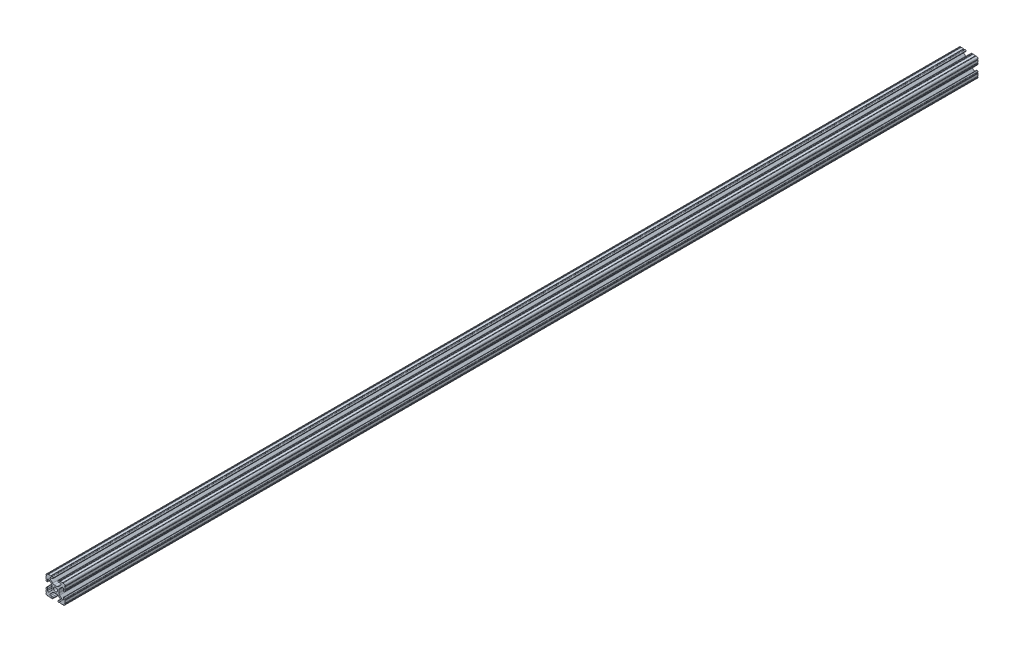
ISO-10303-21;
HEADER;
FILE_DESCRIPTION(('STEP AP214'),'2;1');
FILE_NAME('part.step','',(''),(''),'','','');
FILE_SCHEMA(('AUTOMOTIVE_DESIGN { 1 0 10303 214 1 1 1 1 }'));
ENDSEC;
DATA;
#1=APPLICATION_CONTEXT('core data for automotive mechanical design processes');
#2=APPLICATION_PROTOCOL_DEFINITION('international standard','automotive_design',2000,#1);
#3=PRODUCT_CONTEXT('',#1,'mechanical');
#4=PRODUCT('Part','Part','',(#3));
#5=PRODUCT_RELATED_PRODUCT_CATEGORY('part','',(#4));
#6=PRODUCT_DEFINITION_FORMATION('','',#4);
#7=PRODUCT_DEFINITION_CONTEXT('part definition',#1,'design');
#8=PRODUCT_DEFINITION('design','',#6,#7);
#9=PRODUCT_DEFINITION_SHAPE('','',#8);
#10=(LENGTH_UNIT() NAMED_UNIT(*) SI_UNIT(.MILLI.,.METRE.));
#11=(NAMED_UNIT(*) PLANE_ANGLE_UNIT() SI_UNIT($,.RADIAN.));
#12=(NAMED_UNIT(*) SI_UNIT($,.STERADIAN.) SOLID_ANGLE_UNIT());
#13=UNCERTAINTY_MEASURE_WITH_UNIT(LENGTH_MEASURE(1.E-05),#10,'distance_accuracy_value','');
#14=(GEOMETRIC_REPRESENTATION_CONTEXT(3) GLOBAL_UNCERTAINTY_ASSIGNED_CONTEXT((#13)) GLOBAL_UNIT_ASSIGNED_CONTEXT((#10,
#11,#12)) REPRESENTATION_CONTEXT('',''));
#15=CARTESIAN_POINT('',(0.,0.,0.));
#16=DIRECTION('',(0.,0.,1.));
#17=DIRECTION('',(1.,0.,0.));
#18=AXIS2_PLACEMENT_3D('',#15,#16,#17);
#19=CARTESIAN_POINT('',(-6.41640832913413,-9.40982735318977,762.));
#20=DIRECTION('',(0.,0.,1.));
#21=DIRECTION('',(1.,0.,0.));
#22=AXIS2_PLACEMENT_3D('',#19,#20,#21);
#23=PLANE('',#22);
#24=CARTESIAN_POINT('',(-6.41640832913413,-9.40982735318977,762.));
#25=DIRECTION('',(0.,0.,-1.));
#26=DIRECTION('',(1.,0.,0.));
#27=AXIS2_PLACEMENT_3D('',#24,#25,#26);
#28=CIRCLE('',#27,1.08037264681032);
#29=CARTESIAN_POINT('',(-6.41640832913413,-10.4902000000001,762.));
#30=VERTEX_POINT('',#29);
#31=CARTESIAN_POINT('',(-7.17965049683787,-8.64519250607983,762.));
#32=VERTEX_POINT('',#31);
#33=EDGE_CURVE('E1006',#30,#32,#28,.T.);
#34=ORIENTED_EDGE('',*,*,#33,.T.);
#35=DIRECTION('',(0.707751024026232,0.706461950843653,0.));
#36=VECTOR('',#35,1.);
#37=CARTESIAN_POINT('',(-7.17965049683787,-8.64519250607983,762.));
#38=LINE('',#37,#36);
#39=CARTESIAN_POINT('',(-3.95227025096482,-5.42369049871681,762.));
#40=VERTEX_POINT('',#39);
#41=EDGE_CURVE('E776',#32,#40,#38,.T.);
#42=ORIENTED_EDGE('',*,*,#41,.T.);
#43=CARTESIAN_POINT('',(-1.70925355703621,-7.67080000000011,762.));
#44=DIRECTION('',(0.,0.,-1.));
#45=DIRECTION('',(1.,0.,0.));
#46=AXIS2_PLACEMENT_3D('',#43,#44,#45);
#47=CIRCLE('',#46,3.17500000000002);
#48=CARTESIAN_POINT('',(-1.70925355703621,-4.49580000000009,762.));
#49=VERTEX_POINT('',#48);
#50=EDGE_CURVE('E772',#40,#49,#47,.T.);
#51=ORIENTED_EDGE('',*,*,#50,.T.);
#52=DIRECTION('',(1.,0.,0.));
#53=VECTOR('',#52,1.);
#54=CARTESIAN_POINT('',(-1.70925355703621,-4.49580000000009,762.));
#55=LINE('',#54,#53);
#56=CARTESIAN_POINT('',(1.70925355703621,-4.49580000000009,762.));
#57=VERTEX_POINT('',#56);
#58=EDGE_CURVE('E1010',#49,#57,#55,.T.);
#59=ORIENTED_EDGE('',*,*,#58,.T.);
#60=CARTESIAN_POINT('',(1.70925355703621,-7.67080000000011,762.));
#61=DIRECTION('',(0.,0.,-1.));
#62=DIRECTION('',(1.,0.,0.));
#63=AXIS2_PLACEMENT_3D('',#60,#61,#62);
#64=CIRCLE('',#63,3.17500000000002);
#65=CARTESIAN_POINT('',(3.95227025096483,-5.42369049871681,762.));
#66=VERTEX_POINT('',#65);
#67=EDGE_CURVE('E1012',#57,#66,#64,.T.);
#68=ORIENTED_EDGE('',*,*,#67,.T.);
#69=DIRECTION('',(0.707751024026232,-0.706461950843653,0.));
#70=VECTOR('',#69,1.);
#71=CARTESIAN_POINT('',(3.95227025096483,-5.42369049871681,762.));
#72=LINE('',#71,#70);
#73=CARTESIAN_POINT('',(7.17965049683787,-8.64519250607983,762.));
#74=VERTEX_POINT('',#73);
#75=EDGE_CURVE('E1014',#66,#74,#72,.T.);
#76=ORIENTED_EDGE('',*,*,#75,.T.);
#77=CARTESIAN_POINT('',(6.41640832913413,-9.40982735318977,762.));
#78=DIRECTION('',(0.,0.,-1.));
#79=DIRECTION('',(1.,0.,0.));
#80=AXIS2_PLACEMENT_3D('',#77,#78,#79);
#81=CIRCLE('',#80,1.08037264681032);
#82=CARTESIAN_POINT('',(6.41640832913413,-10.4902000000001,762.));
#83=VERTEX_POINT('',#82);
#84=EDGE_CURVE('E1016',#74,#83,#81,.T.);
#85=ORIENTED_EDGE('',*,*,#84,.T.);
#86=DIRECTION('',(-1.,0.,0.));
#87=VECTOR('',#86,1.);
#88=CARTESIAN_POINT('',(6.41640832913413,-10.4902000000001,762.));
#89=LINE('',#88,#87);
#90=CARTESIAN_POINT('',(4.2875124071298,-10.4902000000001,762.));
#91=VERTEX_POINT('',#90);
#92=EDGE_CURVE('E1018',#83,#91,#89,.T.);
#93=ORIENTED_EDGE('',*,*,#92,.T.);
#94=CARTESIAN_POINT('',(4.2875124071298,-11.5392124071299,762.));
#95=DIRECTION('',(0.,0.,1.));
#96=DIRECTION('',(1.,0.,0.));
#97=AXIS2_PLACEMENT_3D('',#94,#95,#96);
#98=CIRCLE('',#97,1.04901240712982);
#99=CARTESIAN_POINT('',(3.23849999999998,-11.5392124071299,762.));
#100=VERTEX_POINT('',#99);
#101=EDGE_CURVE('E1020',#91,#100,#98,.T.);
#102=ORIENTED_EDGE('',*,*,#101,.T.);
#103=DIRECTION('',(0.,-1.,0.));
#104=VECTOR('',#103,1.);
#105=CARTESIAN_POINT('',(3.23849999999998,-11.5392124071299,762.));
#106=LINE('',#105,#104);
#107=CARTESIAN_POINT('',(3.23849999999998,-11.6509875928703,762.));
#108=VERTEX_POINT('',#107);
#109=EDGE_CURVE('E1022',#100,#108,#106,.T.);
#110=ORIENTED_EDGE('',*,*,#109,.T.);
#111=CARTESIAN_POINT('',(4.2875124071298,-11.6509875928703,762.));
#112=DIRECTION('',(0.,0.,1.));
#113=DIRECTION('',(1.,0.,0.));
#114=AXIS2_PLACEMENT_3D('',#111,#112,#113);
#115=CIRCLE('',#114,1.04901240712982);
#116=CARTESIAN_POINT('',(4.2875124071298,-12.7000000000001,762.));
#117=VERTEX_POINT('',#116);
#118=EDGE_CURVE('E1024',#108,#117,#115,.T.);
#119=ORIENTED_EDGE('',*,*,#118,.T.);
#120=DIRECTION('',(1.,0.,0.));
#121=VECTOR('',#120,1.);
#122=CARTESIAN_POINT('',(4.2875124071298,-12.7000000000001,762.));
#123=LINE('',#122,#121);
#124=CARTESIAN_POINT('',(5.31712671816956,-12.7000000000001,762.));
#125=VERTEX_POINT('',#124);
#126=EDGE_CURVE('E1026',#117,#125,#123,.T.);
#127=ORIENTED_EDGE('',*,*,#126,.T.);
#128=CARTESIAN_POINT('',(5.82512671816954,-12.7000000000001,762.));
#129=DIRECTION('',(0.,0.,-1.));
#130=DIRECTION('',(1.,0.,0.));
#131=AXIS2_PLACEMENT_3D('',#128,#129,#130);
#132=CIRCLE('',#131,0.507999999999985);
#133=CARTESIAN_POINT('',(6.33312671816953,-12.7000000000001,762.));
#134=VERTEX_POINT('',#133);
#135=EDGE_CURVE('E1028',#125,#134,#132,.T.);
#136=ORIENTED_EDGE('',*,*,#135,.T.);
#137=DIRECTION('',(1.,0.,0.));
#138=VECTOR('',#137,1.);
#139=CARTESIAN_POINT('',(6.33312671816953,-12.7000000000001,762.));
#140=LINE('',#139,#138);
#141=CARTESIAN_POINT('',(9.55044311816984,-12.7000000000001,762.));
#142=VERTEX_POINT('',#141);
#143=EDGE_CURVE('E1030',#134,#142,#140,.T.);
#144=ORIENTED_EDGE('',*,*,#143,.T.);
#145=CARTESIAN_POINT('',(10.0584431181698,-12.7000000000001,762.));
#146=DIRECTION('',(0.,0.,-1.));
#147=DIRECTION('',(1.,0.,0.));
#148=AXIS2_PLACEMENT_3D('',#145,#146,#147);
#149=CIRCLE('',#148,0.507999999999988);
#150=CARTESIAN_POINT('',(10.5664430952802,-12.6998475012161,762.));
#151=VERTEX_POINT('',#150);
#152=EDGE_CURVE('E1032',#142,#151,#149,.T.);
#153=ORIENTED_EDGE('',*,*,#152,.T.);
#154=CARTESIAN_POINT('',(10.5918000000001,-10.5918000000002,762.));
#155=DIRECTION('',(0.,0.,1.));
#156=DIRECTION('',(1.,0.,0.));
#157=AXIS2_PLACEMENT_3D('',#154,#155,#156);
#158=CIRCLE('',#157,2.1081999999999);
#159=CARTESIAN_POINT('',(12.699846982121,-10.5663999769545,762.));
#160=VERTEX_POINT('',#159);
#161=EDGE_CURVE('E1034',#151,#160,#158,.T.);
#162=ORIENTED_EDGE('',*,*,#161,.T.);
#163=CARTESIAN_POINT('',(12.7,-10.0584000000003,762.));
#164=DIRECTION('',(0.,0.,-1.));
#165=DIRECTION('',(1.,0.,0.));
#166=AXIS2_PLACEMENT_3D('',#163,#164,#165);
#167=CIRCLE('',#166,0.507999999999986);
#168=CARTESIAN_POINT('',(12.7,-9.5504000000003,762.));
#169=VERTEX_POINT('',#168);
#170=EDGE_CURVE('E1036',#160,#169,#167,.T.);
#171=ORIENTED_EDGE('',*,*,#170,.T.);
#172=DIRECTION('',(0.,1.,0.));
#173=VECTOR('',#172,1.);
#174=CARTESIAN_POINT('',(12.7,-9.5504000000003,762.));
#175=LINE('',#174,#173);
#176=CARTESIAN_POINT('',(12.7,-6.33308359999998,762.));
#177=VERTEX_POINT('',#176);
#178=EDGE_CURVE('E1038',#169,#177,#175,.T.);
#179=ORIENTED_EDGE('',*,*,#178,.T.);
#180=CARTESIAN_POINT('',(12.7,-5.8250836,762.));
#181=DIRECTION('',(0.,0.,-1.));
#182=DIRECTION('',(1.,0.,0.));
#183=AXIS2_PLACEMENT_3D('',#180,#181,#182);
#184=CIRCLE('',#183,0.507999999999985);
#185=CARTESIAN_POINT('',(12.7,-5.31708360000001,762.));
#186=VERTEX_POINT('',#185);
#187=EDGE_CURVE('E1040',#177,#186,#184,.T.);
#188=ORIENTED_EDGE('',*,*,#187,.T.);
#189=DIRECTION('',(0.,1.,0.));
#190=VECTOR('',#189,1.);
#191=CARTESIAN_POINT('',(12.7,-5.31708360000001,762.));
#192=LINE('',#191,#190);
#193=CARTESIAN_POINT('',(12.7,-4.28746928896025,762.));
#194=VERTEX_POINT('',#193);
#195=EDGE_CURVE('E1042',#186,#194,#192,.T.);
#196=ORIENTED_EDGE('',*,*,#195,.T.);
#197=CARTESIAN_POINT('',(11.6509875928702,-4.28746928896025,762.));
#198=DIRECTION('',(0.,0.,1.));
#199=DIRECTION('',(1.,0.,0.));
#200=AXIS2_PLACEMENT_3D('',#197,#198,#199);
#201=CIRCLE('',#200,1.04901240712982);
#202=CARTESIAN_POINT('',(11.6509875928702,-3.23845688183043,762.));
#203=VERTEX_POINT('',#202);
#204=EDGE_CURVE('E1044',#194,#203,#201,.T.);
#205=ORIENTED_EDGE('',*,*,#204,.T.);
#206=DIRECTION('',(-1.,0.,0.));
#207=VECTOR('',#206,1.);
#208=CARTESIAN_POINT('',(11.6509875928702,-3.23845688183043,762.));
#209=LINE('',#208,#207);
#210=CARTESIAN_POINT('',(11.5392124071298,-3.23845688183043,762.));
#211=VERTEX_POINT('',#210);
#212=EDGE_CURVE('E1046',#203,#211,#209,.T.);
#213=ORIENTED_EDGE('',*,*,#212,.T.);
#214=CARTESIAN_POINT('',(11.5392124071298,-4.28746928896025,762.));
#215=DIRECTION('',(0.,0.,1.));
#216=DIRECTION('',(1.,0.,0.));
#217=AXIS2_PLACEMENT_3D('',#214,#215,#216);
#218=CIRCLE('',#217,1.04901240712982);
#219=CARTESIAN_POINT('',(10.4902,-4.28746928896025,762.));
#220=VERTEX_POINT('',#219);
#221=EDGE_CURVE('E1048',#211,#220,#218,.T.);
#222=ORIENTED_EDGE('',*,*,#221,.T.);
#223=DIRECTION('',(0.,-1.,0.));
#224=VECTOR('',#223,1.);
#225=CARTESIAN_POINT('',(10.4902,-4.28746928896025,762.));
#226=LINE('',#225,#224);
#227=CARTESIAN_POINT('',(10.4902,-6.4020890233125,762.));
#228=VERTEX_POINT('',#227);
#229=EDGE_CURVE('E1050',#220,#228,#226,.T.);
#230=ORIENTED_EDGE('',*,*,#229,.T.);
#231=CARTESIAN_POINT('',(9.4627890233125,-6.4020890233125,762.));
#232=DIRECTION('',(0.,0.,-1.));
#233=DIRECTION('',(1.,0.,0.));
#234=AXIS2_PLACEMENT_3D('',#231,#232,#233);
#235=CIRCLE('',#234,1.0274109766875);
#236=CARTESIAN_POINT('',(8.7371313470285,-7.12940893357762,762.));
#237=VERTEX_POINT('',#236);
#238=EDGE_CURVE('E1052',#228,#237,#235,.T.);
#239=ORIENTED_EDGE('',*,*,#238,.T.);
#240=DIRECTION('',(-0.70791526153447,0.706297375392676,0.));
#241=VECTOR('',#240,1.);
#242=CARTESIAN_POINT('',(8.7371313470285,-7.12940893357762,762.));
#243=LINE('',#242,#241);
#244=CARTESIAN_POINT('',(5.44100583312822,-3.84081646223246,762.));
#245=VERTEX_POINT('',#244);
#246=EDGE_CURVE('E1054',#237,#245,#243,.T.);
#247=ORIENTED_EDGE('',*,*,#246,.T.);
#248=CARTESIAN_POINT('',(7.68350000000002,-1.59318550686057,762.));
#249=DIRECTION('',(0.,0.,-1.));
#250=DIRECTION('',(1.,0.,0.));
#251=AXIS2_PLACEMENT_3D('',#248,#249,#250);
#252=CIRCLE('',#251,3.17500000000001);
#253=CARTESIAN_POINT('',(4.50850000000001,-1.59318550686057,762.));
#254=VERTEX_POINT('',#253);
#255=EDGE_CURVE('E1056',#245,#254,#252,.T.);
#256=ORIENTED_EDGE('',*,*,#255,.T.);
#257=DIRECTION('',(0.,1.,0.));
#258=VECTOR('',#257,1.);
#259=CARTESIAN_POINT('',(4.5085,-1.59318550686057,762.));
#260=LINE('',#259,#258);
#261=CARTESIAN_POINT('',(4.50850000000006,1.59318550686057,762.));
#262=VERTEX_POINT('',#261);
#263=EDGE_CURVE('E1058',#254,#262,#260,.T.);
#264=ORIENTED_EDGE('',*,*,#263,.T.);
#265=CARTESIAN_POINT('',(7.68350000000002,1.59318550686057,762.));
#266=DIRECTION('',(0.,0.,-1.));
#267=DIRECTION('',(1.,0.,0.));
#268=AXIS2_PLACEMENT_3D('',#265,#266,#267);
#269=CIRCLE('',#268,3.17499999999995);
#270=CARTESIAN_POINT('',(5.44100583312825,3.84081646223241,762.));
#271=VERTEX_POINT('',#270);
#272=EDGE_CURVE('E1060',#262,#271,#269,.T.);
#273=ORIENTED_EDGE('',*,*,#272,.T.);
#274=DIRECTION('',(0.70791526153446,0.706297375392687,0.));
#275=VECTOR('',#274,1.);
#276=CARTESIAN_POINT('',(5.44100583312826,3.8408164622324,762.));
#277=LINE('',#276,#275);
#278=CARTESIAN_POINT('',(8.73713134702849,7.12940893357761,762.));
#279=VERTEX_POINT('',#278);
#280=EDGE_CURVE('E1062',#271,#279,#277,.T.);
#281=ORIENTED_EDGE('',*,*,#280,.T.);
#282=CARTESIAN_POINT('',(9.4627890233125,6.4020890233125,762.));
#283=DIRECTION('',(0.,0.,-1.));
#284=DIRECTION('',(1.,0.,0.));
#285=AXIS2_PLACEMENT_3D('',#282,#283,#284);
#286=CIRCLE('',#285,1.0274109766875);
#287=CARTESIAN_POINT('',(10.4902,6.4020890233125,762.));
#288=VERTEX_POINT('',#287);
#289=EDGE_CURVE('E1064',#279,#288,#286,.T.);
#290=ORIENTED_EDGE('',*,*,#289,.T.);
#291=DIRECTION('',(0.,-1.,0.));
#292=VECTOR('',#291,1.);
#293=CARTESIAN_POINT('',(10.4902,6.4020890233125,762.));
#294=LINE('',#293,#292);
#295=CARTESIAN_POINT('',(10.4902,4.28746928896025,762.));
#296=VERTEX_POINT('',#295);
#297=EDGE_CURVE('E1066',#288,#296,#294,.T.);
#298=ORIENTED_EDGE('',*,*,#297,.T.);
#299=CARTESIAN_POINT('',(11.5392124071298,4.28746928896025,762.));
#300=DIRECTION('',(0.,0.,1.));
#301=DIRECTION('',(1.,0.,0.));
#302=AXIS2_PLACEMENT_3D('',#299,#300,#301);
#303=CIRCLE('',#302,1.04901240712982);
#304=CARTESIAN_POINT('',(11.5392124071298,3.23845688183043,762.));
#305=VERTEX_POINT('',#304);
#306=EDGE_CURVE('E1068',#296,#305,#303,.T.);
#307=ORIENTED_EDGE('',*,*,#306,.T.);
#308=DIRECTION('',(1.,0.,0.));
#309=VECTOR('',#308,1.);
#310=CARTESIAN_POINT('',(11.5392124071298,3.23845688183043,762.));
#311=LINE('',#310,#309);
#312=CARTESIAN_POINT('',(11.6509875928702,3.23845688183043,762.));
#313=VERTEX_POINT('',#312);
#314=EDGE_CURVE('E1070',#305,#313,#311,.T.);
#315=ORIENTED_EDGE('',*,*,#314,.T.);
#316=CARTESIAN_POINT('',(11.6509875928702,4.28746928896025,762.));
#317=DIRECTION('',(0.,0.,1.));
#318=DIRECTION('',(1.,0.,0.));
#319=AXIS2_PLACEMENT_3D('',#316,#317,#318);
#320=CIRCLE('',#319,1.04901240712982);
#321=CARTESIAN_POINT('',(12.7,4.28746928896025,762.));
#322=VERTEX_POINT('',#321);
#323=EDGE_CURVE('E1072',#313,#322,#320,.T.);
#324=ORIENTED_EDGE('',*,*,#323,.T.);
#325=DIRECTION('',(0.,1.,0.));
#326=VECTOR('',#325,1.);
#327=CARTESIAN_POINT('',(12.7,4.28746928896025,762.));
#328=LINE('',#327,#326);
#329=CARTESIAN_POINT('',(12.7,5.31708360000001,762.));
#330=VERTEX_POINT('',#329);
#331=EDGE_CURVE('E1074',#322,#330,#328,.T.);
#332=ORIENTED_EDGE('',*,*,#331,.T.);
#333=CARTESIAN_POINT('',(12.7,5.8250836,762.));
#334=DIRECTION('',(0.,0.,-1.));
#335=DIRECTION('',(1.,0.,0.));
#336=AXIS2_PLACEMENT_3D('',#333,#334,#335);
#337=CIRCLE('',#336,0.507999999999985);
#338=CARTESIAN_POINT('',(12.7,6.33308359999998,762.));
#339=VERTEX_POINT('',#338);
#340=EDGE_CURVE('E1076',#330,#339,#337,.T.);
#341=ORIENTED_EDGE('',*,*,#340,.T.);
#342=DIRECTION('',(0.,1.,0.));
#343=VECTOR('',#342,1.);
#344=CARTESIAN_POINT('',(12.7,6.33308359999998,762.));
#345=LINE('',#344,#343);
#346=CARTESIAN_POINT('',(12.7,9.55040000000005,762.));
#347=VERTEX_POINT('',#346);
#348=EDGE_CURVE('E1078',#339,#347,#345,.T.);
#349=ORIENTED_EDGE('',*,*,#348,.T.);
#350=CARTESIAN_POINT('',(12.7,10.0584000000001,762.));
#351=DIRECTION('',(0.,0.,-1.));
#352=DIRECTION('',(1.,0.,0.));
#353=AXIS2_PLACEMENT_3D('',#350,#351,#352);
#354=CIRCLE('',#353,0.508000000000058);
#355=CARTESIAN_POINT('',(12.699846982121,10.5663999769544,762.));
#356=VERTEX_POINT('',#355);
#357=EDGE_CURVE('E654',#347,#356,#354,.T.);
#358=ORIENTED_EDGE('',*,*,#357,.T.);
#359=CARTESIAN_POINT('',(10.5918000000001,10.5918000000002,762.));
#360=DIRECTION('',(0.,0.,1.));
#361=DIRECTION('',(1.,0.,0.));
#362=AXIS2_PLACEMENT_3D('',#359,#360,#361);
#363=CIRCLE('',#362,2.1081999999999);
#364=CARTESIAN_POINT('',(10.5664430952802,12.6998475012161,762.));
#365=VERTEX_POINT('',#364);
#366=EDGE_CURVE('E1081',#356,#365,#363,.T.);
#367=ORIENTED_EDGE('',*,*,#366,.T.);
#368=CARTESIAN_POINT('',(10.0584431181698,12.7000000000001,762.));
#369=DIRECTION('',(0.,0.,-1.));
#370=DIRECTION('',(1.,0.,0.));
#371=AXIS2_PLACEMENT_3D('',#368,#369,#370);
#372=CIRCLE('',#371,0.507999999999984);
#373=CARTESIAN_POINT('',(9.55044311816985,12.7000000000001,762.));
#374=VERTEX_POINT('',#373);
#375=EDGE_CURVE('E1083',#365,#374,#372,.T.);
#376=ORIENTED_EDGE('',*,*,#375,.T.);
#377=DIRECTION('',(-1.,0.,0.));
#378=VECTOR('',#377,1.);
#379=CARTESIAN_POINT('',(9.55044311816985,12.7000000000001,762.));
#380=LINE('',#379,#378);
#381=CARTESIAN_POINT('',(6.33312671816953,12.7000000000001,762.));
#382=VERTEX_POINT('',#381);
#383=EDGE_CURVE('E1085',#374,#382,#380,.T.);
#384=ORIENTED_EDGE('',*,*,#383,.T.);
#385=CARTESIAN_POINT('',(5.82512671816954,12.7000000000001,762.));
#386=DIRECTION('',(0.,0.,-1.));
#387=DIRECTION('',(1.,0.,0.));
#388=AXIS2_PLACEMENT_3D('',#385,#386,#387);
#389=CIRCLE('',#388,0.507999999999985);
#390=CARTESIAN_POINT('',(5.31712671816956,12.7000000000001,762.));
#391=VERTEX_POINT('',#390);
#392=EDGE_CURVE('E1087',#382,#391,#389,.T.);
#393=ORIENTED_EDGE('',*,*,#392,.T.);
#394=DIRECTION('',(-1.,0.,0.));
#395=VECTOR('',#394,1.);
#396=CARTESIAN_POINT('',(5.31712671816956,12.7000000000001,762.));
#397=LINE('',#396,#395);
#398=CARTESIAN_POINT('',(4.2875124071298,12.7000000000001,762.));
#399=VERTEX_POINT('',#398);
#400=EDGE_CURVE('E1089',#391,#399,#397,.T.);
#401=ORIENTED_EDGE('',*,*,#400,.T.);
#402=CARTESIAN_POINT('',(4.2875124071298,11.6509875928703,762.));
#403=DIRECTION('',(0.,0.,1.));
#404=DIRECTION('',(1.,0.,0.));
#405=AXIS2_PLACEMENT_3D('',#402,#403,#404);
#406=CIRCLE('',#405,1.04901240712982);
#407=CARTESIAN_POINT('',(3.23849999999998,11.6509875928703,762.));
#408=VERTEX_POINT('',#407);
#409=EDGE_CURVE('E1091',#399,#408,#406,.T.);
#410=ORIENTED_EDGE('',*,*,#409,.T.);
#411=DIRECTION('',(0.,-1.,0.));
#412=VECTOR('',#411,1.);
#413=CARTESIAN_POINT('',(3.23849999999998,11.6509875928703,762.));
#414=LINE('',#413,#412);
#415=CARTESIAN_POINT('',(3.23849999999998,11.5392124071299,762.));
#416=VERTEX_POINT('',#415);
#417=EDGE_CURVE('E1093',#408,#416,#414,.T.);
#418=ORIENTED_EDGE('',*,*,#417,.T.);
#419=CARTESIAN_POINT('',(4.2875124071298,11.5392124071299,762.));
#420=DIRECTION('',(0.,0.,1.));
#421=DIRECTION('',(1.,0.,0.));
#422=AXIS2_PLACEMENT_3D('',#419,#420,#421);
#423=CIRCLE('',#422,1.04901240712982);
#424=CARTESIAN_POINT('',(4.2875124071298,10.4902000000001,762.));
#425=VERTEX_POINT('',#424);
#426=EDGE_CURVE('E1095',#416,#425,#423,.T.);
#427=ORIENTED_EDGE('',*,*,#426,.T.);
#428=DIRECTION('',(1.,0.,0.));
#429=VECTOR('',#428,1.);
#430=CARTESIAN_POINT('',(4.2875124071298,10.4902000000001,762.));
#431=LINE('',#430,#429);
#432=CARTESIAN_POINT('',(6.47678859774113,10.4902000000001,762.));
#433=VERTEX_POINT('',#432);
#434=EDGE_CURVE('E1097',#425,#433,#431,.T.);
#435=ORIENTED_EDGE('',*,*,#434,.T.);
#436=CARTESIAN_POINT('',(6.47678859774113,9.45629072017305,762.));
#437=DIRECTION('',(0.,0.,-1.));
#438=DIRECTION('',(1.,0.,0.));
#439=AXIS2_PLACEMENT_3D('',#436,#437,#438);
#440=CIRCLE('',#439,1.03390927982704);
#441=CARTESIAN_POINT('',(7.2070360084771,8.72437056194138,762.));
#442=VERTEX_POINT('',#441);
#443=EDGE_CURVE('E1099',#433,#442,#440,.T.);
#444=ORIENTED_EDGE('',*,*,#443,.T.);
#445=DIRECTION('',(-0.707915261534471,-0.706297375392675,0.));
#446=VECTOR('',#445,1.);
#447=CARTESIAN_POINT('',(7.2070360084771,8.72437056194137,762.));
#448=LINE('',#447,#446);
#449=CARTESIAN_POINT('',(3.89827256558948,5.42316904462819,762.));
#450=VERTEX_POINT('',#449);
#451=EDGE_CURVE('E1101',#442,#450,#448,.T.);
#452=ORIENTED_EDGE('',*,*,#451,.T.);
#453=CARTESIAN_POINT('',(1.65577839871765,7.67080000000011,762.));
#454=DIRECTION('',(0.,0.,-1.));
#455=DIRECTION('',(1.,0.,0.));
#456=AXIS2_PLACEMENT_3D('',#453,#454,#455);
#457=CIRCLE('',#456,3.17500000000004);
#458=CARTESIAN_POINT('',(1.65577839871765,4.49580000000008,762.));
#459=VERTEX_POINT('',#458);
#460=EDGE_CURVE('E1103',#450,#459,#457,.T.);
#461=ORIENTED_EDGE('',*,*,#460,.T.);
#462=DIRECTION('',(-1.,0.,0.));
#463=VECTOR('',#462,1.);
#464=CARTESIAN_POINT('',(1.65577839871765,4.49580000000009,762.));
#465=LINE('',#464,#463);
#466=CARTESIAN_POINT('',(-1.65577839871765,4.49580000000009,762.));
#467=VERTEX_POINT('',#466);
#468=EDGE_CURVE('E1105',#459,#467,#465,.T.);
#469=ORIENTED_EDGE('',*,*,#468,.T.);
#470=CARTESIAN_POINT('',(-1.65577839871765,7.67080000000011,762.));
#471=DIRECTION('',(0.,0.,-1.));
#472=DIRECTION('',(1.,0.,0.));
#473=AXIS2_PLACEMENT_3D('',#470,#471,#472);
#474=CIRCLE('',#473,3.17500000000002);
#475=CARTESIAN_POINT('',(-3.89827256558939,5.42316904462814,762.));
#476=VERTEX_POINT('',#475);
#477=EDGE_CURVE('E1107',#467,#476,#474,.T.);
#478=ORIENTED_EDGE('',*,*,#477,.T.);
#479=DIRECTION('',(-0.707915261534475,0.706297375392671,0.));
#480=VECTOR('',#479,1.);
#481=CARTESIAN_POINT('',(-3.89827256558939,5.42316904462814,762.));
#482=LINE('',#481,#480);
#483=CARTESIAN_POINT('',(-7.20703600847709,8.72437056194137,762.));
#484=VERTEX_POINT('',#483);
#485=EDGE_CURVE('E1109',#476,#484,#482,.T.);
#486=ORIENTED_EDGE('',*,*,#485,.T.);
#487=CARTESIAN_POINT('',(-6.47678859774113,9.45629072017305,762.));
#488=DIRECTION('',(0.,0.,-1.));
#489=DIRECTION('',(1.,0.,0.));
#490=AXIS2_PLACEMENT_3D('',#487,#488,#489);
#491=CIRCLE('',#490,1.03390927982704);
#492=CARTESIAN_POINT('',(-6.47678859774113,10.4902000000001,762.));
#493=VERTEX_POINT('',#492);
#494=EDGE_CURVE('E1111',#484,#493,#491,.T.);
#495=ORIENTED_EDGE('',*,*,#494,.T.);
#496=DIRECTION('',(1.,0.,0.));
#497=VECTOR('',#496,1.);
#498=CARTESIAN_POINT('',(-6.47678859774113,10.4902000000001,762.));
#499=LINE('',#498,#497);
#500=CARTESIAN_POINT('',(-4.2875124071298,10.4902000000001,762.));
#501=VERTEX_POINT('',#500);
#502=EDGE_CURVE('E1113',#493,#501,#499,.T.);
#503=ORIENTED_EDGE('',*,*,#502,.T.);
#504=CARTESIAN_POINT('',(-4.2875124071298,11.5392124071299,762.));
#505=DIRECTION('',(0.,0.,1.));
#506=DIRECTION('',(1.,0.,0.));
#507=AXIS2_PLACEMENT_3D('',#504,#505,#506);
#508=CIRCLE('',#507,1.04901240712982);
#509=CARTESIAN_POINT('',(-3.23849999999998,11.5392124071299,762.));
#510=VERTEX_POINT('',#509);
#511=EDGE_CURVE('E1115',#501,#510,#508,.T.);
#512=ORIENTED_EDGE('',*,*,#511,.T.);
#513=DIRECTION('',(0.,1.,0.));
#514=VECTOR('',#513,1.);
#515=CARTESIAN_POINT('',(-3.23849999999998,11.5392124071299,762.));
#516=LINE('',#515,#514);
#517=CARTESIAN_POINT('',(-3.23849999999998,11.6509875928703,762.));
#518=VERTEX_POINT('',#517);
#519=EDGE_CURVE('E1117',#510,#518,#516,.T.);
#520=ORIENTED_EDGE('',*,*,#519,.T.);
#521=CARTESIAN_POINT('',(-4.2875124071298,11.6509875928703,762.));
#522=DIRECTION('',(0.,0.,1.));
#523=DIRECTION('',(1.,0.,0.));
#524=AXIS2_PLACEMENT_3D('',#521,#522,#523);
#525=CIRCLE('',#524,1.04901240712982);
#526=CARTESIAN_POINT('',(-4.2875124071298,12.7000000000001,762.));
#527=VERTEX_POINT('',#526);
#528=EDGE_CURVE('E1119',#518,#527,#525,.T.);
#529=ORIENTED_EDGE('',*,*,#528,.T.);
#530=DIRECTION('',(-1.,0.,0.));
#531=VECTOR('',#530,1.);
#532=CARTESIAN_POINT('',(-4.2875124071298,12.7000000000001,762.));
#533=LINE('',#532,#531);
#534=CARTESIAN_POINT('',(-5.31712671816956,12.7000000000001,762.));
#535=VERTEX_POINT('',#534);
#536=EDGE_CURVE('E1121',#527,#535,#533,.T.);
#537=ORIENTED_EDGE('',*,*,#536,.T.);
#538=CARTESIAN_POINT('',(-5.82512671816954,12.7000000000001,762.));
#539=DIRECTION('',(0.,0.,-1.));
#540=DIRECTION('',(1.,0.,0.));
#541=AXIS2_PLACEMENT_3D('',#538,#539,#540);
#542=CIRCLE('',#541,0.507999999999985);
#543=CARTESIAN_POINT('',(-6.33312671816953,12.7000000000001,762.));
#544=VERTEX_POINT('',#543);
#545=EDGE_CURVE('E1123',#535,#544,#542,.T.);
#546=ORIENTED_EDGE('',*,*,#545,.T.);
#547=DIRECTION('',(-1.,0.,0.));
#548=VECTOR('',#547,1.);
#549=CARTESIAN_POINT('',(-6.33312671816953,12.7000000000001,762.));
#550=LINE('',#549,#548);
#551=CARTESIAN_POINT('',(-9.55044311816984,12.7000000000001,762.));
#552=VERTEX_POINT('',#551);
#553=EDGE_CURVE('E1125',#544,#552,#550,.T.);
#554=ORIENTED_EDGE('',*,*,#553,.T.);
#555=CARTESIAN_POINT('',(-10.0584431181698,12.7000000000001,762.));
#556=DIRECTION('',(0.,0.,-1.));
#557=DIRECTION('',(1.,0.,0.));
#558=AXIS2_PLACEMENT_3D('',#555,#556,#557);
#559=CIRCLE('',#558,0.507999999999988);
#560=CARTESIAN_POINT('',(-10.5664430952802,12.6998475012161,762.));
#561=VERTEX_POINT('',#560);
#562=EDGE_CURVE('E1127',#552,#561,#559,.T.);
#563=ORIENTED_EDGE('',*,*,#562,.T.);
#564=CARTESIAN_POINT('',(-10.5918000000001,10.5918000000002,762.));
#565=DIRECTION('',(0.,0.,1.));
#566=DIRECTION('',(1.,0.,0.));
#567=AXIS2_PLACEMENT_3D('',#564,#565,#566);
#568=CIRCLE('',#567,2.1081999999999);
#569=CARTESIAN_POINT('',(-12.699846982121,10.5663999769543,762.));
#570=VERTEX_POINT('',#569);
#571=EDGE_CURVE('E1129',#561,#570,#568,.T.);
#572=ORIENTED_EDGE('',*,*,#571,.T.);
#573=CARTESIAN_POINT('',(-12.7,10.0584000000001,762.));
#574=DIRECTION('',(0.,0.,-1.));
#575=DIRECTION('',(1.,0.,0.));
#576=AXIS2_PLACEMENT_3D('',#573,#574,#575);
#577=CIRCLE('',#576,0.50799999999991);
#578=CARTESIAN_POINT('',(-12.7,9.55040000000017,762.));
#579=VERTEX_POINT('',#578);
#580=EDGE_CURVE('E1131',#570,#579,#577,.T.);
#581=ORIENTED_EDGE('',*,*,#580,.T.);
#582=DIRECTION('',(0.,-1.,0.));
#583=VECTOR('',#582,1.);
#584=CARTESIAN_POINT('',(-12.7,9.5504000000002,762.));
#585=LINE('',#584,#583);
#586=CARTESIAN_POINT('',(-12.7,6.33308359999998,762.));
#587=VERTEX_POINT('',#586);
#588=EDGE_CURVE('E1133',#579,#587,#585,.T.);
#589=ORIENTED_EDGE('',*,*,#588,.T.);
#590=CARTESIAN_POINT('',(-12.7,5.8250836,762.));
#591=DIRECTION('',(0.,0.,-1.));
#592=DIRECTION('',(1.,0.,0.));
#593=AXIS2_PLACEMENT_3D('',#590,#591,#592);
#594=CIRCLE('',#593,0.507999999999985);
#595=CARTESIAN_POINT('',(-12.7,5.31708360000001,762.));
#596=VERTEX_POINT('',#595);
#597=EDGE_CURVE('E1135',#587,#596,#594,.T.);
#598=ORIENTED_EDGE('',*,*,#597,.T.);
#599=DIRECTION('',(0.,-1.,0.));
#600=VECTOR('',#599,1.);
#601=CARTESIAN_POINT('',(-12.7,5.31708360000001,762.));
#602=LINE('',#601,#600);
#603=CARTESIAN_POINT('',(-12.7,4.28746928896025,762.));
#604=VERTEX_POINT('',#603);
#605=EDGE_CURVE('E1137',#596,#604,#602,.T.);
#606=ORIENTED_EDGE('',*,*,#605,.T.);
#607=CARTESIAN_POINT('',(-11.6509875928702,4.28746928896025,762.));
#608=DIRECTION('',(0.,0.,1.));
#609=DIRECTION('',(1.,0.,0.));
#610=AXIS2_PLACEMENT_3D('',#607,#608,#609);
#611=CIRCLE('',#610,1.04901240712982);
#612=CARTESIAN_POINT('',(-11.6509875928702,3.23845688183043,762.));
#613=VERTEX_POINT('',#612);
#614=EDGE_CURVE('E1139',#604,#613,#611,.T.);
#615=ORIENTED_EDGE('',*,*,#614,.T.);
#616=DIRECTION('',(1.,0.,0.));
#617=VECTOR('',#616,1.);
#618=CARTESIAN_POINT('',(-11.6509875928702,3.23845688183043,762.));
#619=LINE('',#618,#617);
#620=CARTESIAN_POINT('',(-11.5392124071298,3.23845688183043,762.));
#621=VERTEX_POINT('',#620);
#622=EDGE_CURVE('E1141',#613,#621,#619,.T.);
#623=ORIENTED_EDGE('',*,*,#622,.T.);
#624=CARTESIAN_POINT('',(-11.5392124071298,4.28746928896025,762.));
#625=DIRECTION('',(0.,0.,1.));
#626=DIRECTION('',(1.,0.,0.));
#627=AXIS2_PLACEMENT_3D('',#624,#625,#626);
#628=CIRCLE('',#627,1.04901240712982);
#629=CARTESIAN_POINT('',(-10.4902,4.28746928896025,762.));
#630=VERTEX_POINT('',#629);
#631=EDGE_CURVE('E1143',#621,#630,#628,.T.);
#632=ORIENTED_EDGE('',*,*,#631,.T.);
#633=DIRECTION('',(0.,1.,0.));
#634=VECTOR('',#633,1.);
#635=CARTESIAN_POINT('',(-10.4902,4.28746928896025,762.));
#636=LINE('',#635,#634);
#637=CARTESIAN_POINT('',(-10.4902,6.4020890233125,762.));
#638=VERTEX_POINT('',#637);
#639=EDGE_CURVE('E1145',#630,#638,#636,.T.);
#640=ORIENTED_EDGE('',*,*,#639,.T.);
#641=CARTESIAN_POINT('',(-9.4627890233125,6.4020890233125,762.));
#642=DIRECTION('',(0.,0.,-1.));
#643=DIRECTION('',(1.,0.,0.));
#644=AXIS2_PLACEMENT_3D('',#641,#642,#643);
#645=CIRCLE('',#644,1.0274109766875);
#646=CARTESIAN_POINT('',(-8.73713134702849,7.12940893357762,762.));
#647=VERTEX_POINT('',#646);
#648=EDGE_CURVE('E1147',#638,#647,#645,.T.);
#649=ORIENTED_EDGE('',*,*,#648,.T.);
#650=DIRECTION('',(0.707915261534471,-0.706297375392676,0.));
#651=VECTOR('',#650,1.);
#652=CARTESIAN_POINT('',(-8.73713134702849,7.12940893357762,762.));
#653=LINE('',#652,#651);
#654=CARTESIAN_POINT('',(-5.44100583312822,3.84081646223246,762.));
#655=VERTEX_POINT('',#654);
#656=EDGE_CURVE('E1149',#647,#655,#653,.T.);
#657=ORIENTED_EDGE('',*,*,#656,.T.);
#658=CARTESIAN_POINT('',(-7.68350000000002,1.59318550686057,762.));
#659=DIRECTION('',(0.,0.,-1.));
#660=DIRECTION('',(1.,0.,0.));
#661=AXIS2_PLACEMENT_3D('',#658,#659,#660);
#662=CIRCLE('',#661,3.17500000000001);
#663=CARTESIAN_POINT('',(-4.50850000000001,1.59318550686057,762.));
#664=VERTEX_POINT('',#663);
#665=EDGE_CURVE('E1151',#655,#664,#662,.T.);
#666=ORIENTED_EDGE('',*,*,#665,.T.);
#667=DIRECTION('',(0.,-1.,0.));
#668=VECTOR('',#667,1.);
#669=CARTESIAN_POINT('',(-4.5085,1.59318550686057,762.));
#670=LINE('',#669,#668);
#671=CARTESIAN_POINT('',(-4.5085,-1.59318550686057,762.));
#672=VERTEX_POINT('',#671);
#673=EDGE_CURVE('E1153',#664,#672,#670,.T.);
#674=ORIENTED_EDGE('',*,*,#673,.T.);
#675=CARTESIAN_POINT('',(-7.68350000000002,-1.59318550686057,762.));
#676=DIRECTION('',(0.,0.,-1.));
#677=DIRECTION('',(1.,0.,0.));
#678=AXIS2_PLACEMENT_3D('',#675,#676,#677);
#679=CIRCLE('',#678,3.17500000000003);
#680=CARTESIAN_POINT('',(-5.44100583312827,-3.84081646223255,762.));
#681=VERTEX_POINT('',#680);
#682=EDGE_CURVE('E1155',#672,#681,#679,.T.);
#683=ORIENTED_EDGE('',*,*,#682,.T.);
#684=DIRECTION('',(-0.707915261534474,-0.706297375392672,0.));
#685=VECTOR('',#684,1.);
#686=CARTESIAN_POINT('',(-5.44100583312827,-3.84081646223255,762.));
#687=LINE('',#686,#685);
#688=CARTESIAN_POINT('',(-8.7371313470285,-7.12940893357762,762.));
#689=VERTEX_POINT('',#688);
#690=EDGE_CURVE('E1157',#681,#689,#687,.T.);
#691=ORIENTED_EDGE('',*,*,#690,.T.);
#692=CARTESIAN_POINT('',(-9.4627890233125,-6.4020890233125,762.));
#693=DIRECTION('',(0.,0.,-1.));
#694=DIRECTION('',(1.,0.,0.));
#695=AXIS2_PLACEMENT_3D('',#692,#693,#694);
#696=CIRCLE('',#695,1.0274109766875);
#697=CARTESIAN_POINT('',(-10.4902,-6.4020890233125,762.));
#698=VERTEX_POINT('',#697);
#699=EDGE_CURVE('E1159',#689,#698,#696,.T.);
#700=ORIENTED_EDGE('',*,*,#699,.T.);
#701=DIRECTION('',(0.,1.,0.));
#702=VECTOR('',#701,1.);
#703=CARTESIAN_POINT('',(-10.4902,-6.4020890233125,762.));
#704=LINE('',#703,#702);
#705=CARTESIAN_POINT('',(-10.4902,-4.28746928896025,762.));
#706=VERTEX_POINT('',#705);
#707=EDGE_CURVE('E1161',#698,#706,#704,.T.);
#708=ORIENTED_EDGE('',*,*,#707,.T.);
#709=CARTESIAN_POINT('',(-11.5392124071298,-4.28746928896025,762.));
#710=DIRECTION('',(0.,0.,1.));
#711=DIRECTION('',(1.,0.,0.));
#712=AXIS2_PLACEMENT_3D('',#709,#710,#711);
#713=CIRCLE('',#712,1.04901240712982);
#714=CARTESIAN_POINT('',(-11.5392124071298,-3.23845688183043,762.));
#715=VERTEX_POINT('',#714);
#716=EDGE_CURVE('E1163',#706,#715,#713,.T.);
#717=ORIENTED_EDGE('',*,*,#716,.T.);
#718=DIRECTION('',(-1.,0.,0.));
#719=VECTOR('',#718,1.);
#720=CARTESIAN_POINT('',(-11.5392124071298,-3.23845688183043,762.));
#721=LINE('',#720,#719);
#722=CARTESIAN_POINT('',(-11.6509875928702,-3.23845688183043,762.));
#723=VERTEX_POINT('',#722);
#724=EDGE_CURVE('E1165',#715,#723,#721,.T.);
#725=ORIENTED_EDGE('',*,*,#724,.T.);
#726=CARTESIAN_POINT('',(-11.6509875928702,-4.28746928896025,762.));
#727=DIRECTION('',(0.,0.,1.));
#728=DIRECTION('',(1.,0.,0.));
#729=AXIS2_PLACEMENT_3D('',#726,#727,#728);
#730=CIRCLE('',#729,1.04901240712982);
#731=CARTESIAN_POINT('',(-12.7,-4.28746928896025,762.));
#732=VERTEX_POINT('',#731);
#733=EDGE_CURVE('E1167',#723,#732,#730,.T.);
#734=ORIENTED_EDGE('',*,*,#733,.T.);
#735=DIRECTION('',(0.,-1.,0.));
#736=VECTOR('',#735,1.);
#737=CARTESIAN_POINT('',(-12.7,-4.28746928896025,762.));
#738=LINE('',#737,#736);
#739=CARTESIAN_POINT('',(-12.7,-5.31708360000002,762.));
#740=VERTEX_POINT('',#739);
#741=EDGE_CURVE('E1169',#732,#740,#738,.T.);
#742=ORIENTED_EDGE('',*,*,#741,.T.);
#743=CARTESIAN_POINT('',(-12.7,-5.8250836,762.));
#744=DIRECTION('',(0.,0.,-1.));
#745=DIRECTION('',(1.,0.,0.));
#746=AXIS2_PLACEMENT_3D('',#743,#744,#745);
#747=CIRCLE('',#746,0.507999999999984);
#748=CARTESIAN_POINT('',(-12.7,-6.33308359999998,762.));
#749=VERTEX_POINT('',#748);
#750=EDGE_CURVE('E1171',#740,#749,#747,.T.);
#751=ORIENTED_EDGE('',*,*,#750,.T.);
#752=DIRECTION('',(0.,-1.,0.));
#753=VECTOR('',#752,1.);
#754=CARTESIAN_POINT('',(-12.7,-6.33308359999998,762.));
#755=LINE('',#754,#753);
#756=CARTESIAN_POINT('',(-12.7,-9.5504000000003,762.));
#757=VERTEX_POINT('',#756);
#758=EDGE_CURVE('E1173',#749,#757,#755,.T.);
#759=ORIENTED_EDGE('',*,*,#758,.T.);
#760=CARTESIAN_POINT('',(-12.7,-10.0584000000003,762.));
#761=DIRECTION('',(0.,0.,-1.));
#762=DIRECTION('',(1.,0.,0.));
#763=AXIS2_PLACEMENT_3D('',#760,#761,#762);
#764=CIRCLE('',#763,0.507999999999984);
#765=CARTESIAN_POINT('',(-12.699846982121,-10.5663999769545,762.));
#766=VERTEX_POINT('',#765);
#767=EDGE_CURVE('E1175',#757,#766,#764,.T.);
#768=ORIENTED_EDGE('',*,*,#767,.T.);
#769=CARTESIAN_POINT('',(-10.5918000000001,-10.5918000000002,762.));
#770=DIRECTION('',(0.,0.,1.));
#771=DIRECTION('',(1.,0.,0.));
#772=AXIS2_PLACEMENT_3D('',#769,#770,#771);
#773=CIRCLE('',#772,2.1081999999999);
#774=CARTESIAN_POINT('',(-10.5664430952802,-12.6998475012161,762.));
#775=VERTEX_POINT('',#774);
#776=EDGE_CURVE('E1177',#766,#775,#773,.T.);
#777=ORIENTED_EDGE('',*,*,#776,.T.);
#778=CARTESIAN_POINT('',(-10.0584431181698,-12.7000000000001,762.));
#779=DIRECTION('',(0.,0.,-1.));
#780=DIRECTION('',(1.,0.,0.));
#781=AXIS2_PLACEMENT_3D('',#778,#779,#780);
#782=CIRCLE('',#781,0.507999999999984);
#783=CARTESIAN_POINT('',(-9.55044311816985,-12.7000000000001,762.));
#784=VERTEX_POINT('',#783);
#785=EDGE_CURVE('E1179',#775,#784,#782,.T.);
#786=ORIENTED_EDGE('',*,*,#785,.T.);
#787=DIRECTION('',(1.,0.,0.));
#788=VECTOR('',#787,1.);
#789=CARTESIAN_POINT('',(-9.55044311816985,-12.7000000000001,762.));
#790=LINE('',#789,#788);
#791=CARTESIAN_POINT('',(-6.33312671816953,-12.7000000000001,762.));
#792=VERTEX_POINT('',#791);
#793=EDGE_CURVE('E1181',#784,#792,#790,.T.);
#794=ORIENTED_EDGE('',*,*,#793,.T.);
#795=CARTESIAN_POINT('',(-5.82512671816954,-12.7000000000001,762.));
#796=DIRECTION('',(0.,0.,-1.));
#797=DIRECTION('',(1.,0.,0.));
#798=AXIS2_PLACEMENT_3D('',#795,#796,#797);
#799=CIRCLE('',#798,0.507999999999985);
#800=CARTESIAN_POINT('',(-5.31712671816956,-12.7000000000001,762.));
#801=VERTEX_POINT('',#800);
#802=EDGE_CURVE('E1183',#792,#801,#799,.T.);
#803=ORIENTED_EDGE('',*,*,#802,.T.);
#804=DIRECTION('',(1.,0.,0.));
#805=VECTOR('',#804,1.);
#806=CARTESIAN_POINT('',(-5.31712671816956,-12.7000000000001,762.));
#807=LINE('',#806,#805);
#808=CARTESIAN_POINT('',(-4.2875124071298,-12.7000000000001,762.));
#809=VERTEX_POINT('',#808);
#810=EDGE_CURVE('E1185',#801,#809,#807,.T.);
#811=ORIENTED_EDGE('',*,*,#810,.T.);
#812=CARTESIAN_POINT('',(-4.2875124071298,-11.6509875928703,762.));
#813=DIRECTION('',(0.,0.,1.));
#814=DIRECTION('',(1.,0.,0.));
#815=AXIS2_PLACEMENT_3D('',#812,#813,#814);
#816=CIRCLE('',#815,1.04901240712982);
#817=CARTESIAN_POINT('',(-3.23849999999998,-11.6509875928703,762.));
#818=VERTEX_POINT('',#817);
#819=EDGE_CURVE('E1187',#809,#818,#816,.T.);
#820=ORIENTED_EDGE('',*,*,#819,.T.);
#821=DIRECTION('',(0.,1.,0.));
#822=VECTOR('',#821,1.);
#823=CARTESIAN_POINT('',(-3.23849999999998,-11.6509875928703,762.));
#824=LINE('',#823,#822);
#825=CARTESIAN_POINT('',(-3.23849999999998,-11.5392124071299,762.));
#826=VERTEX_POINT('',#825);
#827=EDGE_CURVE('E1189',#818,#826,#824,.T.);
#828=ORIENTED_EDGE('',*,*,#827,.T.);
#829=CARTESIAN_POINT('',(-4.2875124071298,-11.5392124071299,762.));
#830=DIRECTION('',(0.,0.,1.));
#831=DIRECTION('',(1.,0.,0.));
#832=AXIS2_PLACEMENT_3D('',#829,#830,#831);
#833=CIRCLE('',#832,1.04901240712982);
#834=CARTESIAN_POINT('',(-4.2875124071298,-10.4902000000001,762.));
#835=VERTEX_POINT('',#834);
#836=EDGE_CURVE('E1191',#826,#835,#833,.T.);
#837=ORIENTED_EDGE('',*,*,#836,.T.);
#838=DIRECTION('',(-1.,0.,0.));
#839=VECTOR('',#838,1.);
#840=CARTESIAN_POINT('',(-4.2875124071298,-10.4902000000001,762.));
#841=LINE('',#840,#839);
#842=EDGE_CURVE('E58',#835,#30,#841,.T.);
#843=ORIENTED_EDGE('',*,*,#842,.T.);
#844=EDGE_LOOP('',(#34,#42,#51,#59,#68,#76,#85,#93,#102,#110,#119,#127,#136,#144,#153,#162,#171,
#179,#188,#196,#205,#213,#222,#230,#239,#247,#256,#264,#273,#281,#290,#298,#307,#315,#324,#332,
#341,#349,#358,#367,#376,#384,#393,#401,#410,#418,#427,#435,#444,#452,#461,#469,#478,#486,#495,
#503,#512,#520,#529,#537,#546,#554,#563,#572,#581,#589,#598,#606,#615,#623,#632,#640,#649,#657,
#666,#674,#683,#691,#700,#708,#717,#725,#734,#742,#751,#759,#768,#777,#786,#794,#803,#811,#820,
#828,#837,#843));
#845=FACE_BOUND('',#844,.T.);
#846=CARTESIAN_POINT('',(0.,0.,762.));
#847=DIRECTION('',(0.,0.,1.));
#848=DIRECTION('',(1.,0.,0.));
#849=AXIS2_PLACEMENT_3D('',#846,#847,#848);
#850=CIRCLE('',#849,2.6035);
#851=CARTESIAN_POINT('',(2.6035,0.,762.));
#852=VERTEX_POINT('',#851);
#853=EDGE_CURVE('E1003',#852,#852,#850,.T.);
#854=ORIENTED_EDGE('',*,*,#853,.F.);
#855=EDGE_LOOP('',(#854));
#856=FACE_BOUND('',#855,.T.);
#857=ADVANCED_FACE('F34',(#845,#856),#23,.T.);
#858=CARTESIAN_POINT('',(-6.41640832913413,-9.40982735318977,762.));
#859=DIRECTION('',(0.,0.,-1.));
#860=DIRECTION('',(-1.,0.,0.));
#861=AXIS2_PLACEMENT_3D('',#858,#859,#860);
#862=CYLINDRICAL_SURFACE('',#861,1.08037264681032);
#863=DIRECTION('',(0.,0.,-1.));
#864=VECTOR('',#863,1.);
#865=CARTESIAN_POINT('',(-6.41640832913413,-10.4902000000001,762.));
#866=LINE('',#865,#864);
#867=CARTESIAN_POINT('',(-6.41640832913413,-10.4902000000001,-457.2));
#868=VERTEX_POINT('',#867);
#869=EDGE_CURVE('E1194',#30,#868,#866,.T.);
#870=ORIENTED_EDGE('',*,*,#869,.T.);
#871=CARTESIAN_POINT('',(-6.41640832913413,-9.40982735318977,-457.2));
#872=DIRECTION('',(0.,0.,1.));
#873=DIRECTION('',(1.,0.,0.));
#874=AXIS2_PLACEMENT_3D('',#871,#872,#873);
#875=CIRCLE('',#874,1.08037264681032);
#876=CARTESIAN_POINT('',(-7.17965049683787,-8.64519250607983,-457.2));
#877=VERTEX_POINT('',#876);
#878=EDGE_CURVE('E50',#868,#877,#875,.F.);
#879=ORIENTED_EDGE('',*,*,#878,.T.);
#880=DIRECTION('',(0.,0.,-1.));
#881=VECTOR('',#880,1.);
#882=CARTESIAN_POINT('',(-7.17965049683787,-8.64519250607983,762.));
#883=LINE('',#882,#881);
#884=EDGE_CURVE('E11',#32,#877,#883,.T.);
#885=ORIENTED_EDGE('',*,*,#884,.F.);
#886=ORIENTED_EDGE('',*,*,#33,.F.);
#887=EDGE_LOOP('',(#870,#879,#885,#886));
#888=FACE_BOUND('',#887,.T.);
#889=ADVANCED_FACE('F36',(#888),#862,.F.);
#890=CARTESIAN_POINT('',(-7.17965049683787,-8.64519250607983,762.));
#891=DIRECTION('',(-0.706461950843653,0.707751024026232,0.));
#892=DIRECTION('',(-0.707751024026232,-0.706461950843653,0.));
#893=AXIS2_PLACEMENT_3D('',#890,#891,#892);
#894=PLANE('',#893);
#895=ORIENTED_EDGE('',*,*,#884,.T.);
#896=DIRECTION('',(0.707751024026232,0.706461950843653,0.));
#897=VECTOR('',#896,1.);
#898=CARTESIAN_POINT('',(-7.17965049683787,-8.64519250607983,-457.2));
#899=LINE('',#898,#897);
#900=CARTESIAN_POINT('',(-3.95227025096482,-5.42369049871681,-457.2));
#901=VERTEX_POINT('',#900);
#902=EDGE_CURVE('E777',#877,#901,#899,.T.);
#903=ORIENTED_EDGE('',*,*,#902,.T.);
#904=DIRECTION('',(0.,0.,-1.));
#905=VECTOR('',#904,1.);
#906=CARTESIAN_POINT('',(-3.95227025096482,-5.42369049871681,762.));
#907=LINE('',#906,#905);
#908=EDGE_CURVE('E43',#40,#901,#907,.T.);
#909=ORIENTED_EDGE('',*,*,#908,.F.);
#910=ORIENTED_EDGE('',*,*,#41,.F.);
#911=EDGE_LOOP('',(#895,#903,#909,#910));
#912=FACE_BOUND('',#911,.T.);
#913=ADVANCED_FACE('F775',(#912),#894,.F.);
#914=CARTESIAN_POINT('',(-1.70925355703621,-7.67080000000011,762.));
#915=DIRECTION('',(0.,0.,-1.));
#916=DIRECTION('',(-1.,0.,0.));
#917=AXIS2_PLACEMENT_3D('',#914,#915,#916);
#918=CYLINDRICAL_SURFACE('',#917,3.17500000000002);
#919=ORIENTED_EDGE('',*,*,#908,.T.);
#920=CARTESIAN_POINT('',(-1.70925355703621,-7.67080000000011,-457.2));
#921=DIRECTION('',(0.,0.,1.));
#922=DIRECTION('',(1.,0.,0.));
#923=AXIS2_PLACEMENT_3D('',#920,#921,#922);
#924=CIRCLE('',#923,3.17500000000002);
#925=CARTESIAN_POINT('',(-1.70925355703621,-4.49580000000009,-457.2));
#926=VERTEX_POINT('',#925);
#927=EDGE_CURVE('E771',#901,#926,#924,.F.);
#928=ORIENTED_EDGE('',*,*,#927,.T.);
#929=DIRECTION('',(0.,0.,-1.));
#930=VECTOR('',#929,1.);
#931=CARTESIAN_POINT('',(-1.70925355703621,-4.49580000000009,762.));
#932=LINE('',#931,#930);
#933=EDGE_CURVE('E761',#49,#926,#932,.T.);
#934=ORIENTED_EDGE('',*,*,#933,.F.);
#935=ORIENTED_EDGE('',*,*,#50,.F.);
#936=EDGE_LOOP('',(#919,#928,#934,#935));
#937=FACE_BOUND('',#936,.T.);
#938=ADVANCED_FACE('F769',(#937),#918,.F.);
#939=CARTESIAN_POINT('',(-1.70925355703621,-4.49580000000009,762.));
#940=DIRECTION('',(0.,1.,0.));
#941=DIRECTION('',(-1.,0.,0.));
#942=AXIS2_PLACEMENT_3D('',#939,#940,#941);
#943=PLANE('',#942);
#944=ORIENTED_EDGE('',*,*,#933,.T.);
#945=DIRECTION('',(1.,0.,0.));
#946=VECTOR('',#945,1.);
#947=CARTESIAN_POINT('',(-1.70925355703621,-4.49580000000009,-457.2));
#948=LINE('',#947,#946);
#949=CARTESIAN_POINT('',(1.70925355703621,-4.49580000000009,-457.2));
#950=VERTEX_POINT('',#949);
#951=EDGE_CURVE('E781',#926,#950,#948,.T.);
#952=ORIENTED_EDGE('',*,*,#951,.T.);
#953=DIRECTION('',(0.,0.,-1.));
#954=VECTOR('',#953,1.);
#955=CARTESIAN_POINT('',(1.70925355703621,-4.49580000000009,762.));
#956=LINE('',#955,#954);
#957=EDGE_CURVE('E758',#57,#950,#956,.T.);
#958=ORIENTED_EDGE('',*,*,#957,.F.);
#959=ORIENTED_EDGE('',*,*,#58,.F.);
#960=EDGE_LOOP('',(#944,#952,#958,#959));
#961=FACE_BOUND('',#960,.T.);
#962=ADVANCED_FACE('F1820',(#961),#943,.F.);
#963=CARTESIAN_POINT('',(1.70925355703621,-7.67080000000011,762.));
#964=DIRECTION('',(0.,0.,-1.));
#965=DIRECTION('',(-1.,0.,0.));
#966=AXIS2_PLACEMENT_3D('',#963,#964,#965);
#967=CYLINDRICAL_SURFACE('',#966,3.17500000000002);
#968=ORIENTED_EDGE('',*,*,#957,.T.);
#969=CARTESIAN_POINT('',(1.70925355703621,-7.67080000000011,-457.2));
#970=DIRECTION('',(0.,0.,1.));
#971=DIRECTION('',(1.,0.,0.));
#972=AXIS2_PLACEMENT_3D('',#969,#970,#971);
#973=CIRCLE('',#972,3.17500000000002);
#974=CARTESIAN_POINT('',(3.95227025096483,-5.42369049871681,-457.2));
#975=VERTEX_POINT('',#974);
#976=EDGE_CURVE('E790',#950,#975,#973,.F.);
#977=ORIENTED_EDGE('',*,*,#976,.T.);
#978=DIRECTION('',(0.,0.,-1.));
#979=VECTOR('',#978,1.);
#980=CARTESIAN_POINT('',(3.95227025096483,-5.42369049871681,762.));
#981=LINE('',#980,#979);
#982=EDGE_CURVE('E755',#66,#975,#981,.T.);
#983=ORIENTED_EDGE('',*,*,#982,.F.);
#984=ORIENTED_EDGE('',*,*,#67,.F.);
#985=EDGE_LOOP('',(#968,#977,#983,#984));
#986=FACE_BOUND('',#985,.T.);
#987=ADVANCED_FACE('F1816',(#986),#967,.F.);
#988=CARTESIAN_POINT('',(3.95227025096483,-5.42369049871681,762.));
#989=DIRECTION('',(0.706461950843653,0.707751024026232,0.));
#990=DIRECTION('',(-0.707751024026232,0.706461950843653,0.));
#991=AXIS2_PLACEMENT_3D('',#988,#989,#990);
#992=PLANE('',#991);
#993=ORIENTED_EDGE('',*,*,#982,.T.);
#994=DIRECTION('',(0.707751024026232,-0.706461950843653,0.));
#995=VECTOR('',#994,1.);
#996=CARTESIAN_POINT('',(3.95227025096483,-5.42369049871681,-457.2));
#997=LINE('',#996,#995);
#998=CARTESIAN_POINT('',(7.17965049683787,-8.64519250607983,-457.2));
#999=VERTEX_POINT('',#998);
#1000=EDGE_CURVE('E793',#975,#999,#997,.T.);
#1001=ORIENTED_EDGE('',*,*,#1000,.T.);
#1002=DIRECTION('',(0.,0.,-1.));
#1003=VECTOR('',#1002,1.);
#1004=CARTESIAN_POINT('',(7.17965049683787,-8.64519250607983,762.));
#1005=LINE('',#1004,#1003);
#1006=EDGE_CURVE('E752',#74,#999,#1005,.T.);
#1007=ORIENTED_EDGE('',*,*,#1006,.F.);
#1008=ORIENTED_EDGE('',*,*,#75,.F.);
#1009=EDGE_LOOP('',(#993,#1001,#1007,#1008));
#1010=FACE_BOUND('',#1009,.T.);
#1011=ADVANCED_FACE('F1812',(#1010),#992,.F.);
#1012=CARTESIAN_POINT('',(6.41640832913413,-9.40982735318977,762.));
#1013=DIRECTION('',(0.,0.,-1.));
#1014=DIRECTION('',(-1.,0.,0.));
#1015=AXIS2_PLACEMENT_3D('',#1012,#1013,#1014);
#1016=CYLINDRICAL_SURFACE('',#1015,1.08037264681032);
#1017=ORIENTED_EDGE('',*,*,#1006,.T.);
#1018=CARTESIAN_POINT('',(6.41640832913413,-9.40982735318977,-457.2));
#1019=DIRECTION('',(0.,0.,1.));
#1020=DIRECTION('',(1.,0.,0.));
#1021=AXIS2_PLACEMENT_3D('',#1018,#1019,#1020);
#1022=CIRCLE('',#1021,1.08037264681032);
#1023=CARTESIAN_POINT('',(6.41640832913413,-10.4902000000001,-457.2));
#1024=VERTEX_POINT('',#1023);
#1025=EDGE_CURVE('E796',#999,#1024,#1022,.F.);
#1026=ORIENTED_EDGE('',*,*,#1025,.T.);
#1027=DIRECTION('',(0.,0.,-1.));
#1028=VECTOR('',#1027,1.);
#1029=CARTESIAN_POINT('',(6.41640832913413,-10.4902000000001,762.));
#1030=LINE('',#1029,#1028);
#1031=EDGE_CURVE('E749',#83,#1024,#1030,.T.);
#1032=ORIENTED_EDGE('',*,*,#1031,.F.);
#1033=ORIENTED_EDGE('',*,*,#84,.F.);
#1034=EDGE_LOOP('',(#1017,#1026,#1032,#1033));
#1035=FACE_BOUND('',#1034,.T.);
#1036=ADVANCED_FACE('F1808',(#1035),#1016,.F.);
#1037=CARTESIAN_POINT('',(6.41640832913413,-10.4902000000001,762.));
#1038=DIRECTION('',(0.,-1.,0.));
#1039=DIRECTION('',(0.,0.,-1.));
#1040=AXIS2_PLACEMENT_3D('',#1037,#1038,#1039);
#1041=PLANE('',#1040);
#1042=ORIENTED_EDGE('',*,*,#1031,.T.);
#1043=DIRECTION('',(-1.,0.,0.));
#1044=VECTOR('',#1043,1.);
#1045=CARTESIAN_POINT('',(6.41640832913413,-10.4902000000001,-457.2));
#1046=LINE('',#1045,#1044);
#1047=CARTESIAN_POINT('',(4.2875124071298,-10.4902000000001,-457.2));
#1048=VERTEX_POINT('',#1047);
#1049=EDGE_CURVE('E799',#1024,#1048,#1046,.T.);
#1050=ORIENTED_EDGE('',*,*,#1049,.T.);
#1051=DIRECTION('',(0.,0.,-1.));
#1052=VECTOR('',#1051,1.);
#1053=CARTESIAN_POINT('',(4.2875124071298,-10.4902000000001,762.));
#1054=LINE('',#1053,#1052);
#1055=EDGE_CURVE('E746',#91,#1048,#1054,.T.);
#1056=ORIENTED_EDGE('',*,*,#1055,.F.);
#1057=ORIENTED_EDGE('',*,*,#92,.F.);
#1058=EDGE_LOOP('',(#1042,#1050,#1056,#1057));
#1059=FACE_BOUND('',#1058,.T.);
#1060=ADVANCED_FACE('F1804',(#1059),#1041,.F.);
#1061=CARTESIAN_POINT('',(4.2875124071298,-11.5392124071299,762.));
#1062=DIRECTION('',(0.,0.,-1.));
#1063=DIRECTION('',(-1.,0.,0.));
#1064=AXIS2_PLACEMENT_3D('',#1061,#1062,#1063);
#1065=CYLINDRICAL_SURFACE('',#1064,1.04901240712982);
#1066=ORIENTED_EDGE('',*,*,#1055,.T.);
#1067=CARTESIAN_POINT('',(4.2875124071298,-11.5392124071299,-457.2));
#1068=DIRECTION('',(0.,0.,1.));
#1069=DIRECTION('',(1.,0.,0.));
#1070=AXIS2_PLACEMENT_3D('',#1067,#1068,#1069);
#1071=CIRCLE('',#1070,1.04901240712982);
#1072=CARTESIAN_POINT('',(3.23849999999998,-11.5392124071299,-457.2));
#1073=VERTEX_POINT('',#1072);
#1074=EDGE_CURVE('E802',#1048,#1073,#1071,.T.);
#1075=ORIENTED_EDGE('',*,*,#1074,.T.);
#1076=DIRECTION('',(0.,0.,-1.));
#1077=VECTOR('',#1076,1.);
#1078=CARTESIAN_POINT('',(3.23849999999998,-11.5392124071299,762.));
#1079=LINE('',#1078,#1077);
#1080=EDGE_CURVE('E743',#100,#1073,#1079,.T.);
#1081=ORIENTED_EDGE('',*,*,#1080,.F.);
#1082=ORIENTED_EDGE('',*,*,#101,.F.);
#1083=EDGE_LOOP('',(#1066,#1075,#1081,#1082));
#1084=FACE_BOUND('',#1083,.T.);
#1085=ADVANCED_FACE('F1800',(#1084),#1065,.T.);
#1086=CARTESIAN_POINT('',(3.23849999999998,-11.5392124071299,762.));
#1087=DIRECTION('',(1.,0.,0.));
#1088=DIRECTION('',(0.,0.,-1.));
#1089=AXIS2_PLACEMENT_3D('',#1086,#1087,#1088);
#1090=PLANE('',#1089);
#1091=ORIENTED_EDGE('',*,*,#1080,.T.);
#1092=DIRECTION('',(0.,-1.,0.));
#1093=VECTOR('',#1092,1.);
#1094=CARTESIAN_POINT('',(3.23849999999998,-11.5392124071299,-457.2));
#1095=LINE('',#1094,#1093);
#1096=CARTESIAN_POINT('',(3.23849999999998,-11.6509875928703,-457.2));
#1097=VERTEX_POINT('',#1096);
#1098=EDGE_CURVE('E805',#1073,#1097,#1095,.T.);
#1099=ORIENTED_EDGE('',*,*,#1098,.T.);
#1100=DIRECTION('',(0.,0.,-1.));
#1101=VECTOR('',#1100,1.);
#1102=CARTESIAN_POINT('',(3.23849999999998,-11.6509875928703,762.));
#1103=LINE('',#1102,#1101);
#1104=EDGE_CURVE('E740',#108,#1097,#1103,.T.);
#1105=ORIENTED_EDGE('',*,*,#1104,.F.);
#1106=ORIENTED_EDGE('',*,*,#109,.F.);
#1107=EDGE_LOOP('',(#1091,#1099,#1105,#1106));
#1108=FACE_BOUND('',#1107,.T.);
#1109=ADVANCED_FACE('F1796',(#1108),#1090,.F.);
#1110=CARTESIAN_POINT('',(4.2875124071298,-11.6509875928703,762.));
#1111=DIRECTION('',(0.,0.,-1.));
#1112=DIRECTION('',(-1.,0.,0.));
#1113=AXIS2_PLACEMENT_3D('',#1110,#1111,#1112);
#1114=CYLINDRICAL_SURFACE('',#1113,1.04901240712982);
#1115=ORIENTED_EDGE('',*,*,#1104,.T.);
#1116=CARTESIAN_POINT('',(4.2875124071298,-11.6509875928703,-457.2));
#1117=DIRECTION('',(0.,0.,1.));
#1118=DIRECTION('',(1.,0.,0.));
#1119=AXIS2_PLACEMENT_3D('',#1116,#1117,#1118);
#1120=CIRCLE('',#1119,1.04901240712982);
#1121=CARTESIAN_POINT('',(4.2875124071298,-12.7000000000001,-457.2));
#1122=VERTEX_POINT('',#1121);
#1123=EDGE_CURVE('E808',#1097,#1122,#1120,.T.);
#1124=ORIENTED_EDGE('',*,*,#1123,.T.);
#1125=DIRECTION('',(0.,0.,-1.));
#1126=VECTOR('',#1125,1.);
#1127=CARTESIAN_POINT('',(4.2875124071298,-12.7000000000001,762.));
#1128=LINE('',#1127,#1126);
#1129=EDGE_CURVE('E737',#117,#1122,#1128,.T.);
#1130=ORIENTED_EDGE('',*,*,#1129,.F.);
#1131=ORIENTED_EDGE('',*,*,#118,.F.);
#1132=EDGE_LOOP('',(#1115,#1124,#1130,#1131));
#1133=FACE_BOUND('',#1132,.T.);
#1134=ADVANCED_FACE('F1792',(#1133),#1114,.T.);
#1135=CARTESIAN_POINT('',(4.2875124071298,-12.7000000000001,762.));
#1136=DIRECTION('',(0.,1.,0.));
#1137=DIRECTION('',(-1.,0.,0.));
#1138=AXIS2_PLACEMENT_3D('',#1135,#1136,#1137);
#1139=PLANE('',#1138);
#1140=ORIENTED_EDGE('',*,*,#1129,.T.);
#1141=DIRECTION('',(1.,0.,0.));
#1142=VECTOR('',#1141,1.);
#1143=CARTESIAN_POINT('',(4.2875124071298,-12.7000000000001,-457.2));
#1144=LINE('',#1143,#1142);
#1145=CARTESIAN_POINT('',(5.31712671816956,-12.7000000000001,-457.2));
#1146=VERTEX_POINT('',#1145);
#1147=EDGE_CURVE('E811',#1122,#1146,#1144,.T.);
#1148=ORIENTED_EDGE('',*,*,#1147,.T.);
#1149=DIRECTION('',(0.,0.,-1.));
#1150=VECTOR('',#1149,1.);
#1151=CARTESIAN_POINT('',(5.31712671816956,-12.7000000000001,762.));
#1152=LINE('',#1151,#1150);
#1153=EDGE_CURVE('E734',#125,#1146,#1152,.T.);
#1154=ORIENTED_EDGE('',*,*,#1153,.F.);
#1155=ORIENTED_EDGE('',*,*,#126,.F.);
#1156=EDGE_LOOP('',(#1140,#1148,#1154,#1155));
#1157=FACE_BOUND('',#1156,.T.);
#1158=ADVANCED_FACE('F1788',(#1157),#1139,.F.);
#1159=CARTESIAN_POINT('',(5.82512671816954,-12.7000000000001,762.));
#1160=DIRECTION('',(0.,0.,-1.));
#1161=DIRECTION('',(-1.,0.,0.));
#1162=AXIS2_PLACEMENT_3D('',#1159,#1160,#1161);
#1163=CYLINDRICAL_SURFACE('',#1162,0.507999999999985);
#1164=ORIENTED_EDGE('',*,*,#1153,.T.);
#1165=CARTESIAN_POINT('',(5.82512671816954,-12.7000000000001,-457.2));
#1166=DIRECTION('',(0.,0.,1.));
#1167=DIRECTION('',(1.,0.,0.));
#1168=AXIS2_PLACEMENT_3D('',#1165,#1166,#1167);
#1169=CIRCLE('',#1168,0.507999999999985);
#1170=CARTESIAN_POINT('',(6.33312671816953,-12.7000000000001,-457.2));
#1171=VERTEX_POINT('',#1170);
#1172=EDGE_CURVE('E814',#1146,#1171,#1169,.F.);
#1173=ORIENTED_EDGE('',*,*,#1172,.T.);
#1174=DIRECTION('',(0.,0.,-1.));
#1175=VECTOR('',#1174,1.);
#1176=CARTESIAN_POINT('',(6.33312671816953,-12.7000000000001,762.));
#1177=LINE('',#1176,#1175);
#1178=EDGE_CURVE('E731',#134,#1171,#1177,.T.);
#1179=ORIENTED_EDGE('',*,*,#1178,.F.);
#1180=ORIENTED_EDGE('',*,*,#135,.F.);
#1181=EDGE_LOOP('',(#1164,#1173,#1179,#1180));
#1182=FACE_BOUND('',#1181,.T.);
#1183=ADVANCED_FACE('F1784',(#1182),#1163,.F.);
#1184=CARTESIAN_POINT('',(6.33312671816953,-12.7000000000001,762.));
#1185=DIRECTION('',(0.,1.,0.));
#1186=DIRECTION('',(0.,0.,1.));
#1187=AXIS2_PLACEMENT_3D('',#1184,#1185,#1186);
#1188=PLANE('',#1187);
#1189=ORIENTED_EDGE('',*,*,#1178,.T.);
#1190=DIRECTION('',(1.,0.,0.));
#1191=VECTOR('',#1190,1.);
#1192=CARTESIAN_POINT('',(6.33312671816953,-12.7000000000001,-457.2));
#1193=LINE('',#1192,#1191);
#1194=CARTESIAN_POINT('',(9.55044311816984,-12.7000000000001,-457.2));
#1195=VERTEX_POINT('',#1194);
#1196=EDGE_CURVE('E817',#1171,#1195,#1193,.T.);
#1197=ORIENTED_EDGE('',*,*,#1196,.T.);
#1198=DIRECTION('',(0.,0.,-1.));
#1199=VECTOR('',#1198,1.);
#1200=CARTESIAN_POINT('',(9.55044311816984,-12.7000000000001,762.));
#1201=LINE('',#1200,#1199);
#1202=EDGE_CURVE('E728',#142,#1195,#1201,.T.);
#1203=ORIENTED_EDGE('',*,*,#1202,.F.);
#1204=ORIENTED_EDGE('',*,*,#143,.F.);
#1205=EDGE_LOOP('',(#1189,#1197,#1203,#1204));
#1206=FACE_BOUND('',#1205,.T.);
#1207=ADVANCED_FACE('F1780',(#1206),#1188,.F.);
#1208=CARTESIAN_POINT('',(10.0584431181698,-12.7000000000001,762.));
#1209=DIRECTION('',(0.,0.,-1.));
#1210=DIRECTION('',(-1.,0.,0.));
#1211=AXIS2_PLACEMENT_3D('',#1208,#1209,#1210);
#1212=CYLINDRICAL_SURFACE('',#1211,0.507999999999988);
#1213=ORIENTED_EDGE('',*,*,#1202,.T.);
#1214=CARTESIAN_POINT('',(10.0584431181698,-12.7000000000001,-457.2));
#1215=DIRECTION('',(0.,0.,1.));
#1216=DIRECTION('',(1.,0.,0.));
#1217=AXIS2_PLACEMENT_3D('',#1214,#1215,#1216);
#1218=CIRCLE('',#1217,0.507999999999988);
#1219=CARTESIAN_POINT('',(10.5664430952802,-12.6998475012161,-457.2));
#1220=VERTEX_POINT('',#1219);
#1221=EDGE_CURVE('E820',#1195,#1220,#1218,.F.);
#1222=ORIENTED_EDGE('',*,*,#1221,.T.);
#1223=DIRECTION('',(0.,0.,-1.));
#1224=VECTOR('',#1223,1.);
#1225=CARTESIAN_POINT('',(10.5664430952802,-12.6998475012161,762.));
#1226=LINE('',#1225,#1224);
#1227=EDGE_CURVE('E725',#151,#1220,#1226,.T.);
#1228=ORIENTED_EDGE('',*,*,#1227,.F.);
#1229=ORIENTED_EDGE('',*,*,#152,.F.);
#1230=EDGE_LOOP('',(#1213,#1222,#1228,#1229));
#1231=FACE_BOUND('',#1230,.T.);
#1232=ADVANCED_FACE('F1776',(#1231),#1212,.F.);
#1233=CARTESIAN_POINT('',(10.5918000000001,-10.5918000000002,762.));
#1234=DIRECTION('',(0.,0.,-1.));
#1235=DIRECTION('',(-1.,0.,0.));
#1236=AXIS2_PLACEMENT_3D('',#1233,#1234,#1235);
#1237=CYLINDRICAL_SURFACE('',#1236,2.1081999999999);
#1238=CARTESIAN_POINT('',(10.5918000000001,-10.5918000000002,-457.2));
#1239=DIRECTION('',(0.,0.,1.));
#1240=DIRECTION('',(1.,0.,0.));
#1241=AXIS2_PLACEMENT_3D('',#1238,#1239,#1240);
#1242=CIRCLE('',#1241,2.1081999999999);
#1243=CARTESIAN_POINT('',(12.699846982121,-10.5663999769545,-457.2));
#1244=VERTEX_POINT('',#1243);
#1245=EDGE_CURVE('E823',#1220,#1244,#1242,.T.);
#1246=ORIENTED_EDGE('',*,*,#1245,.T.);
#1247=DIRECTION('',(0.,0.,-1.));
#1248=VECTOR('',#1247,1.);
#1249=CARTESIAN_POINT('',(12.699846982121,-10.5663999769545,762.));
#1250=LINE('',#1249,#1248);
#1251=EDGE_CURVE('E722',#160,#1244,#1250,.T.);
#1252=ORIENTED_EDGE('',*,*,#1251,.F.);
#1253=ORIENTED_EDGE('',*,*,#161,.F.);
#1254=ORIENTED_EDGE('',*,*,#1227,.T.);
#1255=EDGE_LOOP('',(#1246,#1252,#1253,#1254));
#1256=FACE_BOUND('',#1255,.T.);
#1257=ADVANCED_FACE('F1772',(#1256),#1237,.T.);
#1258=CARTESIAN_POINT('',(12.7,-10.0584000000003,762.));
#1259=DIRECTION('',(0.,0.,-1.));
#1260=DIRECTION('',(-1.,0.,0.));
#1261=AXIS2_PLACEMENT_3D('',#1258,#1259,#1260);
#1262=CYLINDRICAL_SURFACE('',#1261,0.507999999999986);
#1263=ORIENTED_EDGE('',*,*,#1251,.T.);
#1264=CARTESIAN_POINT('',(12.7,-10.0584000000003,-457.2));
#1265=DIRECTION('',(0.,0.,1.));
#1266=DIRECTION('',(1.,0.,0.));
#1267=AXIS2_PLACEMENT_3D('',#1264,#1265,#1266);
#1268=CIRCLE('',#1267,0.507999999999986);
#1269=CARTESIAN_POINT('',(12.7,-9.5504000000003,-457.2));
#1270=VERTEX_POINT('',#1269);
#1271=EDGE_CURVE('E825',#1244,#1270,#1268,.F.);
#1272=ORIENTED_EDGE('',*,*,#1271,.T.);
#1273=DIRECTION('',(0.,0.,-1.));
#1274=VECTOR('',#1273,1.);
#1275=CARTESIAN_POINT('',(12.7,-9.5504000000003,762.));
#1276=LINE('',#1275,#1274);
#1277=EDGE_CURVE('E719',#169,#1270,#1276,.T.);
#1278=ORIENTED_EDGE('',*,*,#1277,.F.);
#1279=ORIENTED_EDGE('',*,*,#170,.F.);
#1280=EDGE_LOOP('',(#1263,#1272,#1278,#1279));
#1281=FACE_BOUND('',#1280,.T.);
#1282=ADVANCED_FACE('F1768',(#1281),#1262,.F.);
#1283=CARTESIAN_POINT('',(12.7,-9.5504000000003,762.));
#1284=DIRECTION('',(-1.,0.,0.));
#1285=DIRECTION('',(0.,-1.,0.));
#1286=AXIS2_PLACEMENT_3D('',#1283,#1284,#1285);
#1287=PLANE('',#1286);
#1288=ORIENTED_EDGE('',*,*,#1277,.T.);
#1289=DIRECTION('',(0.,-1.,0.));
#1290=VECTOR('',#1289,1.);
#1291=CARTESIAN_POINT('',(12.7,40.4618229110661,-457.2));
#1292=LINE('',#1291,#1290);
#1293=CARTESIAN_POINT('',(12.7,-6.33308359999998,-457.2));
#1294=VERTEX_POINT('',#1293);
#1295=EDGE_CURVE('E652',#1294,#1270,#1292,.T.);
#1296=ORIENTED_EDGE('',*,*,#1295,.F.);
#1297=DIRECTION('',(0.,0.,-1.));
#1298=VECTOR('',#1297,1.);
#1299=CARTESIAN_POINT('',(12.7,-6.33308359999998,762.));
#1300=LINE('',#1299,#1298);
#1301=EDGE_CURVE('E716',#177,#1294,#1300,.T.);
#1302=ORIENTED_EDGE('',*,*,#1301,.F.);
#1303=ORIENTED_EDGE('',*,*,#178,.F.);
#1304=EDGE_LOOP('',(#1288,#1296,#1302,#1303));
#1305=FACE_BOUND('',#1304,.T.);
#1306=ADVANCED_FACE('F1764',(#1305),#1287,.F.);
#1307=CARTESIAN_POINT('',(12.7,-5.8250836,762.));
#1308=DIRECTION('',(0.,0.,-1.));
#1309=DIRECTION('',(-1.,0.,0.));
#1310=AXIS2_PLACEMENT_3D('',#1307,#1308,#1309);
#1311=CYLINDRICAL_SURFACE('',#1310,0.507999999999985);
#1312=ORIENTED_EDGE('',*,*,#1301,.T.);
#1313=CARTESIAN_POINT('',(12.7,-5.8250836,-457.2));
#1314=DIRECTION('',(0.,0.,1.));
#1315=DIRECTION('',(1.,0.,0.));
#1316=AXIS2_PLACEMENT_3D('',#1313,#1314,#1315);
#1317=CIRCLE('',#1316,0.507999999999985);
#1318=CARTESIAN_POINT('',(12.7,-5.31708360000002,-457.2));
#1319=VERTEX_POINT('',#1318);
#1320=EDGE_CURVE('E1000',#1294,#1319,#1317,.F.);
#1321=ORIENTED_EDGE('',*,*,#1320,.T.);
#1322=DIRECTION('',(0.,0.,-1.));
#1323=VECTOR('',#1322,1.);
#1324=CARTESIAN_POINT('',(12.7,-5.31708360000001,762.));
#1325=LINE('',#1324,#1323);
#1326=EDGE_CURVE('E713',#186,#1319,#1325,.T.);
#1327=ORIENTED_EDGE('',*,*,#1326,.F.);
#1328=ORIENTED_EDGE('',*,*,#187,.F.);
#1329=EDGE_LOOP('',(#1312,#1321,#1327,#1328));
#1330=FACE_BOUND('',#1329,.T.);
#1331=ADVANCED_FACE('F1760',(#1330),#1311,.F.);
#1332=CARTESIAN_POINT('',(12.7,-5.31708360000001,762.));
#1333=DIRECTION('',(-1.,0.,0.));
#1334=DIRECTION('',(0.,-1.,0.));
#1335=AXIS2_PLACEMENT_3D('',#1332,#1333,#1334);
#1336=PLANE('',#1335);
#1337=ORIENTED_EDGE('',*,*,#1326,.T.);
#1338=CARTESIAN_POINT('',(12.7,-4.28746928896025,-457.2));
#1339=VERTEX_POINT('',#1338);
#1340=EDGE_CURVE('E1390',#1339,#1319,#1292,.T.);
#1341=ORIENTED_EDGE('',*,*,#1340,.F.);
#1342=DIRECTION('',(0.,0.,-1.));
#1343=VECTOR('',#1342,1.);
#1344=CARTESIAN_POINT('',(12.7,-4.28746928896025,762.));
#1345=LINE('',#1344,#1343);
#1346=EDGE_CURVE('E710',#194,#1339,#1345,.T.);
#1347=ORIENTED_EDGE('',*,*,#1346,.F.);
#1348=ORIENTED_EDGE('',*,*,#195,.F.);
#1349=EDGE_LOOP('',(#1337,#1341,#1347,#1348));
#1350=FACE_BOUND('',#1349,.T.);
#1351=ADVANCED_FACE('F1756',(#1350),#1336,.F.);
#1352=CARTESIAN_POINT('',(11.6509875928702,-4.28746928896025,762.));
#1353=DIRECTION('',(0.,0.,-1.));
#1354=DIRECTION('',(-1.,0.,0.));
#1355=AXIS2_PLACEMENT_3D('',#1352,#1353,#1354);
#1356=CYLINDRICAL_SURFACE('',#1355,1.04901240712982);
#1357=ORIENTED_EDGE('',*,*,#1346,.T.);
#1358=CARTESIAN_POINT('',(11.6509875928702,-4.28746928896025,-457.2));
#1359=DIRECTION('',(0.,0.,1.));
#1360=DIRECTION('',(1.,0.,0.));
#1361=AXIS2_PLACEMENT_3D('',#1358,#1359,#1360);
#1362=CIRCLE('',#1361,1.04901240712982);
#1363=CARTESIAN_POINT('',(11.6509875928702,-3.23845688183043,-457.2));
#1364=VERTEX_POINT('',#1363);
#1365=EDGE_CURVE('E997',#1339,#1364,#1362,.T.);
#1366=ORIENTED_EDGE('',*,*,#1365,.T.);
#1367=DIRECTION('',(0.,0.,-1.));
#1368=VECTOR('',#1367,1.);
#1369=CARTESIAN_POINT('',(11.6509875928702,-3.23845688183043,762.));
#1370=LINE('',#1369,#1368);
#1371=EDGE_CURVE('E707',#203,#1364,#1370,.T.);
#1372=ORIENTED_EDGE('',*,*,#1371,.F.);
#1373=ORIENTED_EDGE('',*,*,#204,.F.);
#1374=EDGE_LOOP('',(#1357,#1366,#1372,#1373));
#1375=FACE_BOUND('',#1374,.T.);
#1376=ADVANCED_FACE('F1752',(#1375),#1356,.T.);
#1377=CARTESIAN_POINT('',(11.6509875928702,-3.23845688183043,762.));
#1378=DIRECTION('',(0.,-1.,0.));
#1379=DIRECTION('',(1.,0.,0.));
#1380=AXIS2_PLACEMENT_3D('',#1377,#1378,#1379);
#1381=PLANE('',#1380);
#1382=ORIENTED_EDGE('',*,*,#1371,.T.);
#1383=DIRECTION('',(-1.,0.,0.));
#1384=VECTOR('',#1383,1.);
#1385=CARTESIAN_POINT('',(11.6509875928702,-3.23845688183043,-457.2));
#1386=LINE('',#1385,#1384);
#1387=CARTESIAN_POINT('',(11.5392124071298,-3.23845688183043,-457.2));
#1388=VERTEX_POINT('',#1387);
#1389=EDGE_CURVE('E994',#1364,#1388,#1386,.T.);
#1390=ORIENTED_EDGE('',*,*,#1389,.T.);
#1391=DIRECTION('',(0.,0.,-1.));
#1392=VECTOR('',#1391,1.);
#1393=CARTESIAN_POINT('',(11.5392124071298,-3.23845688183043,762.));
#1394=LINE('',#1393,#1392);
#1395=EDGE_CURVE('E704',#211,#1388,#1394,.T.);
#1396=ORIENTED_EDGE('',*,*,#1395,.F.);
#1397=ORIENTED_EDGE('',*,*,#212,.F.);
#1398=EDGE_LOOP('',(#1382,#1390,#1396,#1397));
#1399=FACE_BOUND('',#1398,.T.);
#1400=ADVANCED_FACE('F1748',(#1399),#1381,.F.);
#1401=CARTESIAN_POINT('',(11.5392124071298,-4.28746928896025,762.));
#1402=DIRECTION('',(0.,0.,-1.));
#1403=DIRECTION('',(-1.,0.,0.));
#1404=AXIS2_PLACEMENT_3D('',#1401,#1402,#1403);
#1405=CYLINDRICAL_SURFACE('',#1404,1.04901240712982);
#1406=ORIENTED_EDGE('',*,*,#1395,.T.);
#1407=CARTESIAN_POINT('',(11.5392124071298,-4.28746928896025,-457.2));
#1408=DIRECTION('',(0.,0.,1.));
#1409=DIRECTION('',(1.,0.,0.));
#1410=AXIS2_PLACEMENT_3D('',#1407,#1408,#1409);
#1411=CIRCLE('',#1410,1.04901240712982);
#1412=CARTESIAN_POINT('',(10.4902,-4.28746928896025,-457.2));
#1413=VERTEX_POINT('',#1412);
#1414=EDGE_CURVE('E991',#1388,#1413,#1411,.T.);
#1415=ORIENTED_EDGE('',*,*,#1414,.T.);
#1416=DIRECTION('',(0.,0.,-1.));
#1417=VECTOR('',#1416,1.);
#1418=CARTESIAN_POINT('',(10.4902,-4.28746928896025,762.));
#1419=LINE('',#1418,#1417);
#1420=EDGE_CURVE('E701',#220,#1413,#1419,.T.);
#1421=ORIENTED_EDGE('',*,*,#1420,.F.);
#1422=ORIENTED_EDGE('',*,*,#221,.F.);
#1423=EDGE_LOOP('',(#1406,#1415,#1421,#1422));
#1424=FACE_BOUND('',#1423,.T.);
#1425=ADVANCED_FACE('F1744',(#1424),#1405,.T.);
#1426=CARTESIAN_POINT('',(10.4902,-4.28746928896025,762.));
#1427=DIRECTION('',(1.,0.,0.));
#1428=DIRECTION('',(0.,1.,0.));
#1429=AXIS2_PLACEMENT_3D('',#1426,#1427,#1428);
#1430=PLANE('',#1429);
#1431=ORIENTED_EDGE('',*,*,#1420,.T.);
#1432=DIRECTION('',(0.,-1.,0.));
#1433=VECTOR('',#1432,1.);
#1434=CARTESIAN_POINT('',(10.4902,-4.28746928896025,-457.2));
#1435=LINE('',#1434,#1433);
#1436=CARTESIAN_POINT('',(10.4902,-6.4020890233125,-457.2));
#1437=VERTEX_POINT('',#1436);
#1438=EDGE_CURVE('E988',#1413,#1437,#1435,.T.);
#1439=ORIENTED_EDGE('',*,*,#1438,.T.);
#1440=DIRECTION('',(0.,0.,-1.));
#1441=VECTOR('',#1440,1.);
#1442=CARTESIAN_POINT('',(10.4902,-6.4020890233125,762.));
#1443=LINE('',#1442,#1441);
#1444=EDGE_CURVE('E698',#228,#1437,#1443,.T.);
#1445=ORIENTED_EDGE('',*,*,#1444,.F.);
#1446=ORIENTED_EDGE('',*,*,#229,.F.);
#1447=EDGE_LOOP('',(#1431,#1439,#1445,#1446));
#1448=FACE_BOUND('',#1447,.T.);
#1449=ADVANCED_FACE('F1740',(#1448),#1430,.F.);
#1450=CARTESIAN_POINT('',(9.4627890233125,-6.4020890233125,762.));
#1451=DIRECTION('',(0.,0.,-1.));
#1452=DIRECTION('',(-1.,0.,0.));
#1453=AXIS2_PLACEMENT_3D('',#1450,#1451,#1452);
#1454=CYLINDRICAL_SURFACE('',#1453,1.0274109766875);
#1455=ORIENTED_EDGE('',*,*,#1444,.T.);
#1456=CARTESIAN_POINT('',(9.4627890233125,-6.4020890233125,-457.2));
#1457=DIRECTION('',(0.,0.,1.));
#1458=DIRECTION('',(1.,0.,0.));
#1459=AXIS2_PLACEMENT_3D('',#1456,#1457,#1458);
#1460=CIRCLE('',#1459,1.0274109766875);
#1461=CARTESIAN_POINT('',(8.7371313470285,-7.12940893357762,-457.2));
#1462=VERTEX_POINT('',#1461);
#1463=EDGE_CURVE('E985',#1437,#1462,#1460,.F.);
#1464=ORIENTED_EDGE('',*,*,#1463,.T.);
#1465=DIRECTION('',(0.,0.,-1.));
#1466=VECTOR('',#1465,1.);
#1467=CARTESIAN_POINT('',(8.7371313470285,-7.12940893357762,762.));
#1468=LINE('',#1467,#1466);
#1469=EDGE_CURVE('E695',#237,#1462,#1468,.T.);
#1470=ORIENTED_EDGE('',*,*,#1469,.F.);
#1471=ORIENTED_EDGE('',*,*,#238,.F.);
#1472=EDGE_LOOP('',(#1455,#1464,#1470,#1471));
#1473=FACE_BOUND('',#1472,.T.);
#1474=ADVANCED_FACE('F1736',(#1473),#1454,.F.);
#1475=CARTESIAN_POINT('',(8.7371313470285,-7.12940893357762,762.));
#1476=DIRECTION('',(-0.706297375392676,-0.707915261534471,0.));
#1477=DIRECTION('',(0.707915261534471,-0.706297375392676,0.));
#1478=AXIS2_PLACEMENT_3D('',#1475,#1476,#1477);
#1479=PLANE('',#1478);
#1480=ORIENTED_EDGE('',*,*,#1469,.T.);
#1481=DIRECTION('',(-0.707915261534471,0.706297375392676,0.));
#1482=VECTOR('',#1481,1.);
#1483=CARTESIAN_POINT('',(8.7371313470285,-7.12940893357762,-457.2));
#1484=LINE('',#1483,#1482);
#1485=CARTESIAN_POINT('',(5.44100583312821,-3.84081646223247,-457.2));
#1486=VERTEX_POINT('',#1485);
#1487=EDGE_CURVE('E982',#1462,#1486,#1484,.T.);
#1488=ORIENTED_EDGE('',*,*,#1487,.T.);
#1489=DIRECTION('',(0.,0.,-1.));
#1490=VECTOR('',#1489,1.);
#1491=CARTESIAN_POINT('',(5.44100583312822,-3.84081646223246,762.));
#1492=LINE('',#1491,#1490);
#1493=EDGE_CURVE('E692',#245,#1486,#1492,.T.);
#1494=ORIENTED_EDGE('',*,*,#1493,.F.);
#1495=ORIENTED_EDGE('',*,*,#246,.F.);
#1496=EDGE_LOOP('',(#1480,#1488,#1494,#1495));
#1497=FACE_BOUND('',#1496,.T.);
#1498=ADVANCED_FACE('F1732',(#1497),#1479,.F.);
#1499=CARTESIAN_POINT('',(7.68350000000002,-1.59318550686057,762.));
#1500=DIRECTION('',(0.,0.,-1.));
#1501=DIRECTION('',(-1.,0.,0.));
#1502=AXIS2_PLACEMENT_3D('',#1499,#1500,#1501);
#1503=CYLINDRICAL_SURFACE('',#1502,3.17500000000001);
#1504=ORIENTED_EDGE('',*,*,#1493,.T.);
#1505=CARTESIAN_POINT('',(7.68350000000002,-1.59318550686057,-457.2));
#1506=DIRECTION('',(0.,0.,1.));
#1507=DIRECTION('',(1.,0.,0.));
#1508=AXIS2_PLACEMENT_3D('',#1505,#1506,#1507);
#1509=CIRCLE('',#1508,3.17500000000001);
#1510=CARTESIAN_POINT('',(4.5085,-1.59318550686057,-457.2));
#1511=VERTEX_POINT('',#1510);
#1512=EDGE_CURVE('E979',#1486,#1511,#1509,.F.);
#1513=ORIENTED_EDGE('',*,*,#1512,.T.);
#1514=DIRECTION('',(0.,0.,-1.));
#1515=VECTOR('',#1514,1.);
#1516=CARTESIAN_POINT('',(4.50850000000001,-1.59318550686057,762.));
#1517=LINE('',#1516,#1515);
#1518=EDGE_CURVE('E689',#254,#1511,#1517,.T.);
#1519=ORIENTED_EDGE('',*,*,#1518,.F.);
#1520=ORIENTED_EDGE('',*,*,#255,.F.);
#1521=EDGE_LOOP('',(#1504,#1513,#1519,#1520));
#1522=FACE_BOUND('',#1521,.T.);
#1523=ADVANCED_FACE('F1728',(#1522),#1503,.F.);
#1524=CARTESIAN_POINT('',(4.5085,-1.59318550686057,762.));
#1525=DIRECTION('',(-1.,0.,0.));
#1526=DIRECTION('',(0.,-1.,0.));
#1527=AXIS2_PLACEMENT_3D('',#1524,#1525,#1526);
#1528=PLANE('',#1527);
#1529=ORIENTED_EDGE('',*,*,#1518,.T.);
#1530=DIRECTION('',(0.,1.,0.));
#1531=VECTOR('',#1530,1.);
#1532=CARTESIAN_POINT('',(4.5085,-1.59318550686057,-457.2));
#1533=LINE('',#1532,#1531);
#1534=CARTESIAN_POINT('',(4.50850000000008,1.59318550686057,-457.2));
#1535=VERTEX_POINT('',#1534);
#1536=EDGE_CURVE('E976',#1511,#1535,#1533,.T.);
#1537=ORIENTED_EDGE('',*,*,#1536,.T.);
#1538=DIRECTION('',(0.,0.,-1.));
#1539=VECTOR('',#1538,1.);
#1540=CARTESIAN_POINT('',(4.50850000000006,1.59318550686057,762.));
#1541=LINE('',#1540,#1539);
#1542=EDGE_CURVE('E686',#262,#1535,#1541,.T.);
#1543=ORIENTED_EDGE('',*,*,#1542,.F.);
#1544=ORIENTED_EDGE('',*,*,#263,.F.);
#1545=EDGE_LOOP('',(#1529,#1537,#1543,#1544));
#1546=FACE_BOUND('',#1545,.T.);
#1547=ADVANCED_FACE('F1724',(#1546),#1528,.F.);
#1548=CARTESIAN_POINT('',(7.68350000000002,1.59318550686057,762.));
#1549=DIRECTION('',(0.,0.,-1.));
#1550=DIRECTION('',(-1.,0.,0.));
#1551=AXIS2_PLACEMENT_3D('',#1548,#1549,#1550);
#1552=CYLINDRICAL_SURFACE('',#1551,3.17499999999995);
#1553=ORIENTED_EDGE('',*,*,#1542,.T.);
#1554=CARTESIAN_POINT('',(7.68350000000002,1.59318550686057,-457.2));
#1555=DIRECTION('',(0.,0.,1.));
#1556=DIRECTION('',(1.,0.,0.));
#1557=AXIS2_PLACEMENT_3D('',#1554,#1555,#1556);
#1558=CIRCLE('',#1557,3.17499999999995);
#1559=CARTESIAN_POINT('',(5.44100583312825,3.84081646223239,-457.2));
#1560=VERTEX_POINT('',#1559);
#1561=EDGE_CURVE('E973',#1535,#1560,#1558,.F.);
#1562=ORIENTED_EDGE('',*,*,#1561,.T.);
#1563=DIRECTION('',(0.,0.,-1.));
#1564=VECTOR('',#1563,1.);
#1565=CARTESIAN_POINT('',(5.44100583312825,3.84081646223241,762.));
#1566=LINE('',#1565,#1564);
#1567=EDGE_CURVE('E683',#271,#1560,#1566,.T.);
#1568=ORIENTED_EDGE('',*,*,#1567,.F.);
#1569=ORIENTED_EDGE('',*,*,#272,.F.);
#1570=EDGE_LOOP('',(#1553,#1562,#1568,#1569));
#1571=FACE_BOUND('',#1570,.T.);
#1572=ADVANCED_FACE('F1720',(#1571),#1552,.F.);
#1573=CARTESIAN_POINT('',(5.44100583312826,3.8408164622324,762.));
#1574=DIRECTION('',(-0.706297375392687,0.707915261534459,0.));
#1575=DIRECTION('',(-0.70791526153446,-0.706297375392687,0.));
#1576=AXIS2_PLACEMENT_3D('',#1573,#1574,#1575);
#1577=PLANE('',#1576);
#1578=ORIENTED_EDGE('',*,*,#1567,.T.);
#1579=DIRECTION('',(0.70791526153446,0.706297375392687,0.));
#1580=VECTOR('',#1579,1.);
#1581=CARTESIAN_POINT('',(5.44100583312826,3.8408164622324,-457.2));
#1582=LINE('',#1581,#1580);
#1583=CARTESIAN_POINT('',(8.73713134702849,7.12940893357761,-457.2));
#1584=VERTEX_POINT('',#1583);
#1585=EDGE_CURVE('E970',#1560,#1584,#1582,.T.);
#1586=ORIENTED_EDGE('',*,*,#1585,.T.);
#1587=DIRECTION('',(0.,0.,-1.));
#1588=VECTOR('',#1587,1.);
#1589=CARTESIAN_POINT('',(8.73713134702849,7.12940893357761,762.));
#1590=LINE('',#1589,#1588);
#1591=EDGE_CURVE('E680',#279,#1584,#1590,.T.);
#1592=ORIENTED_EDGE('',*,*,#1591,.F.);
#1593=ORIENTED_EDGE('',*,*,#280,.F.);
#1594=EDGE_LOOP('',(#1578,#1586,#1592,#1593));
#1595=FACE_BOUND('',#1594,.T.);
#1596=ADVANCED_FACE('F1716',(#1595),#1577,.F.);
#1597=CARTESIAN_POINT('',(9.4627890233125,6.4020890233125,762.));
#1598=DIRECTION('',(0.,0.,-1.));
#1599=DIRECTION('',(-1.,0.,0.));
#1600=AXIS2_PLACEMENT_3D('',#1597,#1598,#1599);
#1601=CYLINDRICAL_SURFACE('',#1600,1.0274109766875);
#1602=ORIENTED_EDGE('',*,*,#1591,.T.);
#1603=CARTESIAN_POINT('',(9.4627890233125,6.4020890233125,-457.2));
#1604=DIRECTION('',(0.,0.,1.));
#1605=DIRECTION('',(1.,0.,0.));
#1606=AXIS2_PLACEMENT_3D('',#1603,#1604,#1605);
#1607=CIRCLE('',#1606,1.0274109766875);
#1608=CARTESIAN_POINT('',(10.4902,6.4020890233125,-457.2));
#1609=VERTEX_POINT('',#1608);
#1610=EDGE_CURVE('E967',#1584,#1609,#1607,.F.);
#1611=ORIENTED_EDGE('',*,*,#1610,.T.);
#1612=DIRECTION('',(0.,0.,-1.));
#1613=VECTOR('',#1612,1.);
#1614=CARTESIAN_POINT('',(10.4902,6.4020890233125,762.));
#1615=LINE('',#1614,#1613);
#1616=EDGE_CURVE('E677',#288,#1609,#1615,.T.);
#1617=ORIENTED_EDGE('',*,*,#1616,.F.);
#1618=ORIENTED_EDGE('',*,*,#289,.F.);
#1619=EDGE_LOOP('',(#1602,#1611,#1617,#1618));
#1620=FACE_BOUND('',#1619,.T.);
#1621=ADVANCED_FACE('F1712',(#1620),#1601,.F.);
#1622=CARTESIAN_POINT('',(10.4902,6.4020890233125,762.));
#1623=DIRECTION('',(1.,0.,0.));
#1624=DIRECTION('',(0.,0.,-1.));
#1625=AXIS2_PLACEMENT_3D('',#1622,#1623,#1624);
#1626=PLANE('',#1625);
#1627=ORIENTED_EDGE('',*,*,#1616,.T.);
#1628=DIRECTION('',(0.,-1.,0.));
#1629=VECTOR('',#1628,1.);
#1630=CARTESIAN_POINT('',(10.4902,6.4020890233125,-457.2));
#1631=LINE('',#1630,#1629);
#1632=CARTESIAN_POINT('',(10.4902,4.28746928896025,-457.2));
#1633=VERTEX_POINT('',#1632);
#1634=EDGE_CURVE('E964',#1609,#1633,#1631,.T.);
#1635=ORIENTED_EDGE('',*,*,#1634,.T.);
#1636=DIRECTION('',(0.,0.,-1.));
#1637=VECTOR('',#1636,1.);
#1638=CARTESIAN_POINT('',(10.4902,4.28746928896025,762.));
#1639=LINE('',#1638,#1637);
#1640=EDGE_CURVE('E674',#296,#1633,#1639,.T.);
#1641=ORIENTED_EDGE('',*,*,#1640,.F.);
#1642=ORIENTED_EDGE('',*,*,#297,.F.);
#1643=EDGE_LOOP('',(#1627,#1635,#1641,#1642));
#1644=FACE_BOUND('',#1643,.T.);
#1645=ADVANCED_FACE('F1708',(#1644),#1626,.F.);
#1646=CARTESIAN_POINT('',(11.5392124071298,4.28746928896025,762.));
#1647=DIRECTION('',(0.,0.,-1.));
#1648=DIRECTION('',(-1.,0.,0.));
#1649=AXIS2_PLACEMENT_3D('',#1646,#1647,#1648);
#1650=CYLINDRICAL_SURFACE('',#1649,1.04901240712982);
#1651=ORIENTED_EDGE('',*,*,#1640,.T.);
#1652=CARTESIAN_POINT('',(11.5392124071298,4.28746928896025,-457.2));
#1653=DIRECTION('',(0.,0.,1.));
#1654=DIRECTION('',(1.,0.,0.));
#1655=AXIS2_PLACEMENT_3D('',#1652,#1653,#1654);
#1656=CIRCLE('',#1655,1.04901240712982);
#1657=CARTESIAN_POINT('',(11.5392124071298,3.23845688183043,-457.2));
#1658=VERTEX_POINT('',#1657);
#1659=EDGE_CURVE('E961',#1633,#1658,#1656,.T.);
#1660=ORIENTED_EDGE('',*,*,#1659,.T.);
#1661=DIRECTION('',(0.,0.,-1.));
#1662=VECTOR('',#1661,1.);
#1663=CARTESIAN_POINT('',(11.5392124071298,3.23845688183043,762.));
#1664=LINE('',#1663,#1662);
#1665=EDGE_CURVE('E671',#305,#1658,#1664,.T.);
#1666=ORIENTED_EDGE('',*,*,#1665,.F.);
#1667=ORIENTED_EDGE('',*,*,#306,.F.);
#1668=EDGE_LOOP('',(#1651,#1660,#1666,#1667));
#1669=FACE_BOUND('',#1668,.T.);
#1670=ADVANCED_FACE('F1704',(#1669),#1650,.T.);
#1671=CARTESIAN_POINT('',(11.5392124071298,3.23845688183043,762.));
#1672=DIRECTION('',(0.,1.,0.));
#1673=DIRECTION('',(-1.,0.,0.));
#1674=AXIS2_PLACEMENT_3D('',#1671,#1672,#1673);
#1675=PLANE('',#1674);
#1676=ORIENTED_EDGE('',*,*,#1665,.T.);
#1677=DIRECTION('',(1.,0.,0.));
#1678=VECTOR('',#1677,1.);
#1679=CARTESIAN_POINT('',(11.5392124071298,3.23845688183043,-457.2));
#1680=LINE('',#1679,#1678);
#1681=CARTESIAN_POINT('',(11.6509875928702,3.23845688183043,-457.2));
#1682=VERTEX_POINT('',#1681);
#1683=EDGE_CURVE('E958',#1658,#1682,#1680,.T.);
#1684=ORIENTED_EDGE('',*,*,#1683,.T.);
#1685=DIRECTION('',(0.,0.,-1.));
#1686=VECTOR('',#1685,1.);
#1687=CARTESIAN_POINT('',(11.6509875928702,3.23845688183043,762.));
#1688=LINE('',#1687,#1686);
#1689=EDGE_CURVE('E668',#313,#1682,#1688,.T.);
#1690=ORIENTED_EDGE('',*,*,#1689,.F.);
#1691=ORIENTED_EDGE('',*,*,#314,.F.);
#1692=EDGE_LOOP('',(#1676,#1684,#1690,#1691));
#1693=FACE_BOUND('',#1692,.T.);
#1694=ADVANCED_FACE('F1700',(#1693),#1675,.F.);
#1695=CARTESIAN_POINT('',(11.6509875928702,4.28746928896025,762.));
#1696=DIRECTION('',(0.,0.,-1.));
#1697=DIRECTION('',(-1.,0.,0.));
#1698=AXIS2_PLACEMENT_3D('',#1695,#1696,#1697);
#1699=CYLINDRICAL_SURFACE('',#1698,1.04901240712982);
#1700=ORIENTED_EDGE('',*,*,#1689,.T.);
#1701=CARTESIAN_POINT('',(11.6509875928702,4.28746928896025,-457.2));
#1702=DIRECTION('',(0.,0.,1.));
#1703=DIRECTION('',(1.,0.,0.));
#1704=AXIS2_PLACEMENT_3D('',#1701,#1702,#1703);
#1705=CIRCLE('',#1704,1.04901240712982);
#1706=CARTESIAN_POINT('',(12.7,4.28746928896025,-457.2));
#1707=VERTEX_POINT('',#1706);
#1708=EDGE_CURVE('E955',#1682,#1707,#1705,.T.);
#1709=ORIENTED_EDGE('',*,*,#1708,.T.);
#1710=DIRECTION('',(0.,0.,-1.));
#1711=VECTOR('',#1710,1.);
#1712=CARTESIAN_POINT('',(12.7,4.28746928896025,762.));
#1713=LINE('',#1712,#1711);
#1714=EDGE_CURVE('E665',#322,#1707,#1713,.T.);
#1715=ORIENTED_EDGE('',*,*,#1714,.F.);
#1716=ORIENTED_EDGE('',*,*,#323,.F.);
#1717=EDGE_LOOP('',(#1700,#1709,#1715,#1716));
#1718=FACE_BOUND('',#1717,.T.);
#1719=ADVANCED_FACE('F1697',(#1718),#1699,.T.);
#1720=CARTESIAN_POINT('',(12.7,4.28746928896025,762.));
#1721=DIRECTION('',(-1.,0.,0.));
#1722=DIRECTION('',(0.,-1.,0.));
#1723=AXIS2_PLACEMENT_3D('',#1720,#1721,#1722);
#1724=PLANE('',#1723);
#1725=ORIENTED_EDGE('',*,*,#1714,.T.);
#1726=CARTESIAN_POINT('',(12.7,5.31708360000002,-457.2));
#1727=VERTEX_POINT('',#1726);
#1728=EDGE_CURVE('E650',#1727,#1707,#1292,.T.);
#1729=ORIENTED_EDGE('',*,*,#1728,.F.);
#1730=DIRECTION('',(0.,0.,-1.));
#1731=VECTOR('',#1730,1.);
#1732=CARTESIAN_POINT('',(12.7,5.31708360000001,762.));
#1733=LINE('',#1732,#1731);
#1734=EDGE_CURVE('E657',#330,#1727,#1733,.T.);
#1735=ORIENTED_EDGE('',*,*,#1734,.F.);
#1736=ORIENTED_EDGE('',*,*,#331,.F.);
#1737=EDGE_LOOP('',(#1725,#1729,#1735,#1736));
#1738=FACE_BOUND('',#1737,.T.);
#1739=ADVANCED_FACE('F1388',(#1738),#1724,.F.);
#1740=CARTESIAN_POINT('',(12.7,5.8250836,762.));
#1741=DIRECTION('',(0.,0.,-1.));
#1742=DIRECTION('',(-1.,0.,0.));
#1743=AXIS2_PLACEMENT_3D('',#1740,#1741,#1742);
#1744=CYLINDRICAL_SURFACE('',#1743,0.507999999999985);
#1745=ORIENTED_EDGE('',*,*,#1734,.T.);
#1746=CARTESIAN_POINT('',(12.7,5.8250836,-457.2));
#1747=DIRECTION('',(0.,0.,1.));
#1748=DIRECTION('',(1.,0.,0.));
#1749=AXIS2_PLACEMENT_3D('',#1746,#1747,#1748);
#1750=CIRCLE('',#1749,0.507999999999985);
#1751=CARTESIAN_POINT('',(12.7,6.33308359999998,-457.2));
#1752=VERTEX_POINT('',#1751);
#1753=EDGE_CURVE('E638',#1727,#1752,#1750,.F.);
#1754=ORIENTED_EDGE('',*,*,#1753,.T.);
#1755=DIRECTION('',(0.,0.,-1.));
#1756=VECTOR('',#1755,1.);
#1757=CARTESIAN_POINT('',(12.7,6.33308359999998,762.));
#1758=LINE('',#1757,#1756);
#1759=EDGE_CURVE('E648',#339,#1752,#1758,.T.);
#1760=ORIENTED_EDGE('',*,*,#1759,.F.);
#1761=ORIENTED_EDGE('',*,*,#340,.F.);
#1762=EDGE_LOOP('',(#1745,#1754,#1760,#1761));
#1763=FACE_BOUND('',#1762,.T.);
#1764=ADVANCED_FACE('F1385',(#1763),#1744,.F.);
#1765=CARTESIAN_POINT('',(12.7,6.33308359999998,762.));
#1766=DIRECTION('',(-1.,0.,0.));
#1767=DIRECTION('',(0.,0.,1.));
#1768=AXIS2_PLACEMENT_3D('',#1765,#1766,#1767);
#1769=PLANE('',#1768);
#1770=ORIENTED_EDGE('',*,*,#1759,.T.);
#1771=CARTESIAN_POINT('',(12.7,9.55040000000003,-457.2));
#1772=VERTEX_POINT('',#1771);
#1773=EDGE_CURVE('E630',#1772,#1752,#1292,.T.);
#1774=ORIENTED_EDGE('',*,*,#1773,.F.);
#1775=DIRECTION('',(0.,0.,-1.));
#1776=VECTOR('',#1775,1.);
#1777=CARTESIAN_POINT('',(12.7,9.55040000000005,762.));
#1778=LINE('',#1777,#1776);
#1779=EDGE_CURVE('E645',#347,#1772,#1778,.T.);
#1780=ORIENTED_EDGE('',*,*,#1779,.F.);
#1781=ORIENTED_EDGE('',*,*,#348,.F.);
#1782=EDGE_LOOP('',(#1770,#1774,#1780,#1781));
#1783=FACE_BOUND('',#1782,.T.);
#1784=ADVANCED_FACE('F643',(#1783),#1769,.F.);
#1785=CARTESIAN_POINT('',(12.7,10.0584000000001,762.));
#1786=DIRECTION('',(0.,0.,-1.));
#1787=DIRECTION('',(-1.,0.,0.));
#1788=AXIS2_PLACEMENT_3D('',#1785,#1786,#1787);
#1789=CYLINDRICAL_SURFACE('',#1788,0.508000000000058);
#1790=ORIENTED_EDGE('',*,*,#1779,.T.);
#1791=CARTESIAN_POINT('',(12.7,10.0584000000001,-457.2));
#1792=DIRECTION('',(0.,0.,1.));
#1793=DIRECTION('',(1.,0.,0.));
#1794=AXIS2_PLACEMENT_3D('',#1791,#1792,#1793);
#1795=CIRCLE('',#1794,0.508000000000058);
#1796=CARTESIAN_POINT('',(12.699846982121,10.5663999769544,-457.2));
#1797=VERTEX_POINT('',#1796);
#1798=EDGE_CURVE('E627',#1772,#1797,#1795,.F.);
#1799=ORIENTED_EDGE('',*,*,#1798,.T.);
#1800=DIRECTION('',(0.,0.,-1.));
#1801=VECTOR('',#1800,1.);
#1802=CARTESIAN_POINT('',(12.699846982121,10.5663999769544,762.));
#1803=LINE('',#1802,#1801);
#1804=EDGE_CURVE('E655',#356,#1797,#1803,.T.);
#1805=ORIENTED_EDGE('',*,*,#1804,.F.);
#1806=ORIENTED_EDGE('',*,*,#357,.F.);
#1807=EDGE_LOOP('',(#1790,#1799,#1805,#1806));
#1808=FACE_BOUND('',#1807,.T.);
#1809=ADVANCED_FACE('F653',(#1808),#1789,.F.);
#1810=CARTESIAN_POINT('',(10.5918000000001,10.5918000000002,762.));
#1811=DIRECTION('',(0.,0.,-1.));
#1812=DIRECTION('',(-1.,0.,0.));
#1813=AXIS2_PLACEMENT_3D('',#1810,#1811,#1812);
#1814=CYLINDRICAL_SURFACE('',#1813,2.1081999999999);
#1815=CARTESIAN_POINT('',(10.5918000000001,10.5918000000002,-457.2));
#1816=DIRECTION('',(0.,0.,1.));
#1817=DIRECTION('',(1.,0.,0.));
#1818=AXIS2_PLACEMENT_3D('',#1815,#1816,#1817);
#1819=CIRCLE('',#1818,2.1081999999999);
#1820=CARTESIAN_POINT('',(10.5664430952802,12.6998475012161,-457.2));
#1821=VERTEX_POINT('',#1820);
#1822=EDGE_CURVE('E633',#1797,#1821,#1819,.T.);
#1823=ORIENTED_EDGE('',*,*,#1822,.T.);
#1824=DIRECTION('',(0.,0.,-1.));
#1825=VECTOR('',#1824,1.);
#1826=CARTESIAN_POINT('',(10.5664430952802,12.6998475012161,762.));
#1827=LINE('',#1826,#1825);
#1828=EDGE_CURVE('E659',#365,#1821,#1827,.T.);
#1829=ORIENTED_EDGE('',*,*,#1828,.F.);
#1830=ORIENTED_EDGE('',*,*,#366,.F.);
#1831=ORIENTED_EDGE('',*,*,#1804,.T.);
#1832=EDGE_LOOP('',(#1823,#1829,#1830,#1831));
#1833=FACE_BOUND('',#1832,.T.);
#1834=ADVANCED_FACE('F1369',(#1833),#1814,.T.);
#1835=CARTESIAN_POINT('',(10.0584431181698,12.7000000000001,762.));
#1836=DIRECTION('',(0.,0.,-1.));
#1837=DIRECTION('',(-1.,0.,0.));
#1838=AXIS2_PLACEMENT_3D('',#1835,#1836,#1837);
#1839=CYLINDRICAL_SURFACE('',#1838,0.507999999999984);
#1840=ORIENTED_EDGE('',*,*,#1828,.T.);
#1841=CARTESIAN_POINT('',(10.0584431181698,12.7000000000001,-457.2));
#1842=DIRECTION('',(0.,0.,1.));
#1843=DIRECTION('',(1.,0.,0.));
#1844=AXIS2_PLACEMENT_3D('',#1841,#1842,#1843);
#1845=CIRCLE('',#1844,0.507999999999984);
#1846=CARTESIAN_POINT('',(9.55044311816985,12.7000000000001,-457.2));
#1847=VERTEX_POINT('',#1846);
#1848=EDGE_CURVE('E950',#1821,#1847,#1845,.F.);
#1849=ORIENTED_EDGE('',*,*,#1848,.T.);
#1850=DIRECTION('',(0.,0.,-1.));
#1851=VECTOR('',#1850,1.);
#1852=CARTESIAN_POINT('',(9.55044311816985,12.7000000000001,762.));
#1853=LINE('',#1852,#1851);
#1854=EDGE_CURVE('E1359',#374,#1847,#1853,.T.);
#1855=ORIENTED_EDGE('',*,*,#1854,.F.);
#1856=ORIENTED_EDGE('',*,*,#375,.F.);
#1857=EDGE_LOOP('',(#1840,#1849,#1855,#1856));
#1858=FACE_BOUND('',#1857,.T.);
#1859=ADVANCED_FACE('F1365',(#1858),#1839,.F.);
#1860=CARTESIAN_POINT('',(9.55044311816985,12.7000000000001,762.));
#1861=DIRECTION('',(0.,-1.,0.));
#1862=DIRECTION('',(0.,0.,-1.));
#1863=AXIS2_PLACEMENT_3D('',#1860,#1861,#1862);
#1864=PLANE('',#1863);
#1865=ORIENTED_EDGE('',*,*,#1854,.T.);
#1866=DIRECTION('',(-1.,0.,0.));
#1867=VECTOR('',#1866,1.);
#1868=CARTESIAN_POINT('',(9.55044311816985,12.7000000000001,-457.2));
#1869=LINE('',#1868,#1867);
#1870=CARTESIAN_POINT('',(6.33312671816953,12.7000000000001,-457.2));
#1871=VERTEX_POINT('',#1870);
#1872=EDGE_CURVE('E947',#1847,#1871,#1869,.T.);
#1873=ORIENTED_EDGE('',*,*,#1872,.T.);
#1874=DIRECTION('',(0.,0.,-1.));
#1875=VECTOR('',#1874,1.);
#1876=CARTESIAN_POINT('',(6.33312671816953,12.7000000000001,762.));
#1877=LINE('',#1876,#1875);
#1878=EDGE_CURVE('E1356',#382,#1871,#1877,.T.);
#1879=ORIENTED_EDGE('',*,*,#1878,.F.);
#1880=ORIENTED_EDGE('',*,*,#383,.F.);
#1881=EDGE_LOOP('',(#1865,#1873,#1879,#1880));
#1882=FACE_BOUND('',#1881,.T.);
#1883=ADVANCED_FACE('F1372',(#1882),#1864,.F.);
#1884=CARTESIAN_POINT('',(5.82512671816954,12.7000000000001,762.));
#1885=DIRECTION('',(0.,0.,-1.));
#1886=DIRECTION('',(-1.,0.,0.));
#1887=AXIS2_PLACEMENT_3D('',#1884,#1885,#1886);
#1888=CYLINDRICAL_SURFACE('',#1887,0.507999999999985);
#1889=ORIENTED_EDGE('',*,*,#1878,.T.);
#1890=CARTESIAN_POINT('',(5.82512671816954,12.7000000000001,-457.2));
#1891=DIRECTION('',(0.,0.,1.));
#1892=DIRECTION('',(1.,0.,0.));
#1893=AXIS2_PLACEMENT_3D('',#1890,#1891,#1892);
#1894=CIRCLE('',#1893,0.507999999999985);
#1895=CARTESIAN_POINT('',(5.31712671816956,12.7000000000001,-457.2));
#1896=VERTEX_POINT('',#1895);
#1897=EDGE_CURVE('E944',#1871,#1896,#1894,.F.);
#1898=ORIENTED_EDGE('',*,*,#1897,.T.);
#1899=DIRECTION('',(0.,0.,-1.));
#1900=VECTOR('',#1899,1.);
#1901=CARTESIAN_POINT('',(5.31712671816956,12.7000000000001,762.));
#1902=LINE('',#1901,#1900);
#1903=EDGE_CURVE('E1353',#391,#1896,#1902,.T.);
#1904=ORIENTED_EDGE('',*,*,#1903,.F.);
#1905=ORIENTED_EDGE('',*,*,#392,.F.);
#1906=EDGE_LOOP('',(#1889,#1898,#1904,#1905));
#1907=FACE_BOUND('',#1906,.T.);
#1908=ADVANCED_FACE('F1376',(#1907),#1888,.F.);
#1909=CARTESIAN_POINT('',(5.31712671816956,12.7000000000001,762.));
#1910=DIRECTION('',(0.,-1.,0.));
#1911=DIRECTION('',(1.,0.,0.));
#1912=AXIS2_PLACEMENT_3D('',#1909,#1910,#1911);
#1913=PLANE('',#1912);
#1914=ORIENTED_EDGE('',*,*,#1903,.T.);
#1915=DIRECTION('',(-1.,0.,0.));
#1916=VECTOR('',#1915,1.);
#1917=CARTESIAN_POINT('',(5.31712671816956,12.7000000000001,-457.2));
#1918=LINE('',#1917,#1916);
#1919=CARTESIAN_POINT('',(4.2875124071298,12.7000000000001,-457.2));
#1920=VERTEX_POINT('',#1919);
#1921=EDGE_CURVE('E941',#1896,#1920,#1918,.T.);
#1922=ORIENTED_EDGE('',*,*,#1921,.T.);
#1923=DIRECTION('',(0.,0.,-1.));
#1924=VECTOR('',#1923,1.);
#1925=CARTESIAN_POINT('',(4.2875124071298,12.7000000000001,762.));
#1926=LINE('',#1925,#1924);
#1927=EDGE_CURVE('E1350',#399,#1920,#1926,.T.);
#1928=ORIENTED_EDGE('',*,*,#1927,.F.);
#1929=ORIENTED_EDGE('',*,*,#400,.F.);
#1930=EDGE_LOOP('',(#1914,#1922,#1928,#1929));
#1931=FACE_BOUND('',#1930,.T.);
#1932=ADVANCED_FACE('F1676',(#1931),#1913,.F.);
#1933=CARTESIAN_POINT('',(4.2875124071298,11.6509875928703,762.));
#1934=DIRECTION('',(0.,0.,-1.));
#1935=DIRECTION('',(-1.,0.,0.));
#1936=AXIS2_PLACEMENT_3D('',#1933,#1934,#1935);
#1937=CYLINDRICAL_SURFACE('',#1936,1.04901240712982);
#1938=ORIENTED_EDGE('',*,*,#1927,.T.);
#1939=CARTESIAN_POINT('',(4.2875124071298,11.6509875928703,-457.2));
#1940=DIRECTION('',(0.,0.,1.));
#1941=DIRECTION('',(1.,0.,0.));
#1942=AXIS2_PLACEMENT_3D('',#1939,#1940,#1941);
#1943=CIRCLE('',#1942,1.04901240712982);
#1944=CARTESIAN_POINT('',(3.23849999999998,11.6509875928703,-457.2));
#1945=VERTEX_POINT('',#1944);
#1946=EDGE_CURVE('E938',#1920,#1945,#1943,.T.);
#1947=ORIENTED_EDGE('',*,*,#1946,.T.);
#1948=DIRECTION('',(0.,0.,-1.));
#1949=VECTOR('',#1948,1.);
#1950=CARTESIAN_POINT('',(3.23849999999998,11.6509875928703,762.));
#1951=LINE('',#1950,#1949);
#1952=EDGE_CURVE('E1347',#408,#1945,#1951,.T.);
#1953=ORIENTED_EDGE('',*,*,#1952,.F.);
#1954=ORIENTED_EDGE('',*,*,#409,.F.);
#1955=EDGE_LOOP('',(#1938,#1947,#1953,#1954));
#1956=FACE_BOUND('',#1955,.T.);
#1957=ADVANCED_FACE('F1672',(#1956),#1937,.T.);
#1958=CARTESIAN_POINT('',(3.23849999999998,11.6509875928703,762.));
#1959=DIRECTION('',(1.,0.,0.));
#1960=DIRECTION('',(0.,1.,0.));
#1961=AXIS2_PLACEMENT_3D('',#1958,#1959,#1960);
#1962=PLANE('',#1961);
#1963=ORIENTED_EDGE('',*,*,#1952,.T.);
#1964=DIRECTION('',(0.,-1.,0.));
#1965=VECTOR('',#1964,1.);
#1966=CARTESIAN_POINT('',(3.23849999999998,11.6509875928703,-457.2));
#1967=LINE('',#1966,#1965);
#1968=CARTESIAN_POINT('',(3.23849999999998,11.5392124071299,-457.2));
#1969=VERTEX_POINT('',#1968);
#1970=EDGE_CURVE('E935',#1945,#1969,#1967,.T.);
#1971=ORIENTED_EDGE('',*,*,#1970,.T.);
#1972=DIRECTION('',(0.,0.,-1.));
#1973=VECTOR('',#1972,1.);
#1974=CARTESIAN_POINT('',(3.23849999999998,11.5392124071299,762.));
#1975=LINE('',#1974,#1973);
#1976=EDGE_CURVE('E1344',#416,#1969,#1975,.T.);
#1977=ORIENTED_EDGE('',*,*,#1976,.F.);
#1978=ORIENTED_EDGE('',*,*,#417,.F.);
#1979=EDGE_LOOP('',(#1963,#1971,#1977,#1978));
#1980=FACE_BOUND('',#1979,.T.);
#1981=ADVANCED_FACE('F1668',(#1980),#1962,.F.);
#1982=CARTESIAN_POINT('',(4.2875124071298,11.5392124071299,762.));
#1983=DIRECTION('',(0.,0.,-1.));
#1984=DIRECTION('',(-1.,0.,0.));
#1985=AXIS2_PLACEMENT_3D('',#1982,#1983,#1984);
#1986=CYLINDRICAL_SURFACE('',#1985,1.04901240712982);
#1987=ORIENTED_EDGE('',*,*,#1976,.T.);
#1988=CARTESIAN_POINT('',(4.2875124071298,11.5392124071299,-457.2));
#1989=DIRECTION('',(0.,0.,1.));
#1990=DIRECTION('',(1.,0.,0.));
#1991=AXIS2_PLACEMENT_3D('',#1988,#1989,#1990);
#1992=CIRCLE('',#1991,1.04901240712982);
#1993=CARTESIAN_POINT('',(4.2875124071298,10.4902000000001,-457.2));
#1994=VERTEX_POINT('',#1993);
#1995=EDGE_CURVE('E932',#1969,#1994,#1992,.T.);
#1996=ORIENTED_EDGE('',*,*,#1995,.T.);
#1997=DIRECTION('',(0.,0.,-1.));
#1998=VECTOR('',#1997,1.);
#1999=CARTESIAN_POINT('',(4.2875124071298,10.4902000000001,762.));
#2000=LINE('',#1999,#1998);
#2001=EDGE_CURVE('E1341',#425,#1994,#2000,.T.);
#2002=ORIENTED_EDGE('',*,*,#2001,.F.);
#2003=ORIENTED_EDGE('',*,*,#426,.F.);
#2004=EDGE_LOOP('',(#1987,#1996,#2002,#2003));
#2005=FACE_BOUND('',#2004,.T.);
#2006=ADVANCED_FACE('F1664',(#2005),#1986,.T.);
#2007=CARTESIAN_POINT('',(4.2875124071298,10.4902000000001,762.));
#2008=DIRECTION('',(0.,1.,0.));
#2009=DIRECTION('',(-1.,0.,0.));
#2010=AXIS2_PLACEMENT_3D('',#2007,#2008,#2009);
#2011=PLANE('',#2010);
#2012=ORIENTED_EDGE('',*,*,#2001,.T.);
#2013=DIRECTION('',(1.,0.,0.));
#2014=VECTOR('',#2013,1.);
#2015=CARTESIAN_POINT('',(4.2875124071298,10.4902000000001,-457.2));
#2016=LINE('',#2015,#2014);
#2017=CARTESIAN_POINT('',(6.47678859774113,10.4902000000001,-457.2));
#2018=VERTEX_POINT('',#2017);
#2019=EDGE_CURVE('E929',#1994,#2018,#2016,.T.);
#2020=ORIENTED_EDGE('',*,*,#2019,.T.);
#2021=DIRECTION('',(0.,0.,-1.));
#2022=VECTOR('',#2021,1.);
#2023=CARTESIAN_POINT('',(6.47678859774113,10.4902000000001,762.));
#2024=LINE('',#2023,#2022);
#2025=EDGE_CURVE('E1338',#433,#2018,#2024,.T.);
#2026=ORIENTED_EDGE('',*,*,#2025,.F.);
#2027=ORIENTED_EDGE('',*,*,#434,.F.);
#2028=EDGE_LOOP('',(#2012,#2020,#2026,#2027));
#2029=FACE_BOUND('',#2028,.T.);
#2030=ADVANCED_FACE('F1660',(#2029),#2011,.F.);
#2031=CARTESIAN_POINT('',(6.47678859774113,9.45629072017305,762.));
#2032=DIRECTION('',(0.,0.,-1.));
#2033=DIRECTION('',(-1.,0.,0.));
#2034=AXIS2_PLACEMENT_3D('',#2031,#2032,#2033);
#2035=CYLINDRICAL_SURFACE('',#2034,1.03390927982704);
#2036=ORIENTED_EDGE('',*,*,#2025,.T.);
#2037=CARTESIAN_POINT('',(6.47678859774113,9.45629072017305,-457.2));
#2038=DIRECTION('',(0.,0.,1.));
#2039=DIRECTION('',(1.,0.,0.));
#2040=AXIS2_PLACEMENT_3D('',#2037,#2038,#2039);
#2041=CIRCLE('',#2040,1.03390927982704);
#2042=CARTESIAN_POINT('',(7.2070360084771,8.72437056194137,-457.2));
#2043=VERTEX_POINT('',#2042);
#2044=EDGE_CURVE('E926',#2018,#2043,#2041,.F.);
#2045=ORIENTED_EDGE('',*,*,#2044,.T.);
#2046=DIRECTION('',(0.,0.,-1.));
#2047=VECTOR('',#2046,1.);
#2048=CARTESIAN_POINT('',(7.2070360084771,8.72437056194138,762.));
#2049=LINE('',#2048,#2047);
#2050=EDGE_CURVE('E1335',#442,#2043,#2049,.T.);
#2051=ORIENTED_EDGE('',*,*,#2050,.F.);
#2052=ORIENTED_EDGE('',*,*,#443,.F.);
#2053=EDGE_LOOP('',(#2036,#2045,#2051,#2052));
#2054=FACE_BOUND('',#2053,.T.);
#2055=ADVANCED_FACE('F1656',(#2054),#2035,.F.);
#2056=CARTESIAN_POINT('',(7.2070360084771,8.72437056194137,762.));
#2057=DIRECTION('',(0.706297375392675,-0.707915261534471,0.));
#2058=DIRECTION('',(0.707915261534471,0.706297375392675,0.));
#2059=AXIS2_PLACEMENT_3D('',#2056,#2057,#2058);
#2060=PLANE('',#2059);
#2061=ORIENTED_EDGE('',*,*,#2050,.T.);
#2062=DIRECTION('',(-0.707915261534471,-0.706297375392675,0.));
#2063=VECTOR('',#2062,1.);
#2064=CARTESIAN_POINT('',(7.2070360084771,8.72437056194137,-457.2));
#2065=LINE('',#2064,#2063);
#2066=CARTESIAN_POINT('',(3.89827256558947,5.4231690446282,-457.2));
#2067=VERTEX_POINT('',#2066);
#2068=EDGE_CURVE('E923',#2043,#2067,#2065,.T.);
#2069=ORIENTED_EDGE('',*,*,#2068,.T.);
#2070=DIRECTION('',(0.,0.,-1.));
#2071=VECTOR('',#2070,1.);
#2072=CARTESIAN_POINT('',(3.89827256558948,5.42316904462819,762.));
#2073=LINE('',#2072,#2071);
#2074=EDGE_CURVE('E1332',#450,#2067,#2073,.T.);
#2075=ORIENTED_EDGE('',*,*,#2074,.F.);
#2076=ORIENTED_EDGE('',*,*,#451,.F.);
#2077=EDGE_LOOP('',(#2061,#2069,#2075,#2076));
#2078=FACE_BOUND('',#2077,.T.);
#2079=ADVANCED_FACE('F1652',(#2078),#2060,.F.);
#2080=CARTESIAN_POINT('',(1.65577839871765,7.67080000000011,762.));
#2081=DIRECTION('',(0.,0.,-1.));
#2082=DIRECTION('',(-1.,0.,0.));
#2083=AXIS2_PLACEMENT_3D('',#2080,#2081,#2082);
#2084=CYLINDRICAL_SURFACE('',#2083,3.17500000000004);
#2085=ORIENTED_EDGE('',*,*,#2074,.T.);
#2086=CARTESIAN_POINT('',(1.65577839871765,7.67080000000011,-457.2));
#2087=DIRECTION('',(0.,0.,1.));
#2088=DIRECTION('',(1.,0.,0.));
#2089=AXIS2_PLACEMENT_3D('',#2086,#2087,#2088);
#2090=CIRCLE('',#2089,3.17500000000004);
#2091=CARTESIAN_POINT('',(1.65577839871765,4.49580000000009,-457.2));
#2092=VERTEX_POINT('',#2091);
#2093=EDGE_CURVE('E920',#2067,#2092,#2090,.F.);
#2094=ORIENTED_EDGE('',*,*,#2093,.T.);
#2095=DIRECTION('',(0.,0.,-1.));
#2096=VECTOR('',#2095,1.);
#2097=CARTESIAN_POINT('',(1.65577839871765,4.49580000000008,762.));
#2098=LINE('',#2097,#2096);
#2099=EDGE_CURVE('E1329',#459,#2092,#2098,.T.);
#2100=ORIENTED_EDGE('',*,*,#2099,.F.);
#2101=ORIENTED_EDGE('',*,*,#460,.F.);
#2102=EDGE_LOOP('',(#2085,#2094,#2100,#2101));
#2103=FACE_BOUND('',#2102,.T.);
#2104=ADVANCED_FACE('F1648',(#2103),#2084,.F.);
#2105=CARTESIAN_POINT('',(1.65577839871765,4.49580000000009,762.));
#2106=DIRECTION('',(0.,-1.,0.));
#2107=DIRECTION('',(1.,0.,0.));
#2108=AXIS2_PLACEMENT_3D('',#2105,#2106,#2107);
#2109=PLANE('',#2108);
#2110=ORIENTED_EDGE('',*,*,#2099,.T.);
#2111=DIRECTION('',(-1.,0.,0.));
#2112=VECTOR('',#2111,1.);
#2113=CARTESIAN_POINT('',(1.65577839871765,4.49580000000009,-457.2));
#2114=LINE('',#2113,#2112);
#2115=CARTESIAN_POINT('',(-1.65577839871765,4.4958000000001,-457.2));
#2116=VERTEX_POINT('',#2115);
#2117=EDGE_CURVE('E917',#2092,#2116,#2114,.T.);
#2118=ORIENTED_EDGE('',*,*,#2117,.T.);
#2119=DIRECTION('',(0.,0.,-1.));
#2120=VECTOR('',#2119,1.);
#2121=CARTESIAN_POINT('',(-1.65577839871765,4.49580000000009,762.));
#2122=LINE('',#2121,#2120);
#2123=EDGE_CURVE('E1326',#467,#2116,#2122,.T.);
#2124=ORIENTED_EDGE('',*,*,#2123,.F.);
#2125=ORIENTED_EDGE('',*,*,#468,.F.);
#2126=EDGE_LOOP('',(#2110,#2118,#2124,#2125));
#2127=FACE_BOUND('',#2126,.T.);
#2128=ADVANCED_FACE('F1644',(#2127),#2109,.F.);
#2129=CARTESIAN_POINT('',(-1.65577839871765,7.67080000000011,762.));
#2130=DIRECTION('',(0.,0.,-1.));
#2131=DIRECTION('',(-1.,0.,0.));
#2132=AXIS2_PLACEMENT_3D('',#2129,#2130,#2131);
#2133=CYLINDRICAL_SURFACE('',#2132,3.17500000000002);
#2134=ORIENTED_EDGE('',*,*,#2123,.T.);
#2135=CARTESIAN_POINT('',(-1.65577839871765,7.67080000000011,-457.2));
#2136=DIRECTION('',(0.,0.,1.));
#2137=DIRECTION('',(1.,0.,0.));
#2138=AXIS2_PLACEMENT_3D('',#2135,#2136,#2137);
#2139=CIRCLE('',#2138,3.17500000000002);
#2140=CARTESIAN_POINT('',(-3.89827256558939,5.42316904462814,-457.2));
#2141=VERTEX_POINT('',#2140);
#2142=EDGE_CURVE('E914',#2116,#2141,#2139,.F.);
#2143=ORIENTED_EDGE('',*,*,#2142,.T.);
#2144=DIRECTION('',(0.,0.,-1.));
#2145=VECTOR('',#2144,1.);
#2146=CARTESIAN_POINT('',(-3.89827256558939,5.42316904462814,762.));
#2147=LINE('',#2146,#2145);
#2148=EDGE_CURVE('E1323',#476,#2141,#2147,.T.);
#2149=ORIENTED_EDGE('',*,*,#2148,.F.);
#2150=ORIENTED_EDGE('',*,*,#477,.F.);
#2151=EDGE_LOOP('',(#2134,#2143,#2149,#2150));
#2152=FACE_BOUND('',#2151,.T.);
#2153=ADVANCED_FACE('F1640',(#2152),#2133,.F.);
#2154=CARTESIAN_POINT('',(-3.89827256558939,5.42316904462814,762.));
#2155=DIRECTION('',(-0.706297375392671,-0.707915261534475,0.));
#2156=DIRECTION('',(0.707915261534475,-0.706297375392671,0.));
#2157=AXIS2_PLACEMENT_3D('',#2154,#2155,#2156);
#2158=PLANE('',#2157);
#2159=ORIENTED_EDGE('',*,*,#2148,.T.);
#2160=DIRECTION('',(-0.707915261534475,0.706297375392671,0.));
#2161=VECTOR('',#2160,1.);
#2162=CARTESIAN_POINT('',(-3.89827256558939,5.42316904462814,-457.2));
#2163=LINE('',#2162,#2161);
#2164=CARTESIAN_POINT('',(-7.20703600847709,8.72437056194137,-457.2));
#2165=VERTEX_POINT('',#2164);
#2166=EDGE_CURVE('E911',#2141,#2165,#2163,.T.);
#2167=ORIENTED_EDGE('',*,*,#2166,.T.);
#2168=DIRECTION('',(0.,0.,-1.));
#2169=VECTOR('',#2168,1.);
#2170=CARTESIAN_POINT('',(-7.20703600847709,8.72437056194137,762.));
#2171=LINE('',#2170,#2169);
#2172=EDGE_CURVE('E1320',#484,#2165,#2171,.T.);
#2173=ORIENTED_EDGE('',*,*,#2172,.F.);
#2174=ORIENTED_EDGE('',*,*,#485,.F.);
#2175=EDGE_LOOP('',(#2159,#2167,#2173,#2174));
#2176=FACE_BOUND('',#2175,.T.);
#2177=ADVANCED_FACE('F1636',(#2176),#2158,.F.);
#2178=CARTESIAN_POINT('',(-6.47678859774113,9.45629072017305,762.));
#2179=DIRECTION('',(0.,0.,-1.));
#2180=DIRECTION('',(-1.,0.,0.));
#2181=AXIS2_PLACEMENT_3D('',#2178,#2179,#2180);
#2182=CYLINDRICAL_SURFACE('',#2181,1.03390927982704);
#2183=ORIENTED_EDGE('',*,*,#2172,.T.);
#2184=CARTESIAN_POINT('',(-6.47678859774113,9.45629072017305,-457.2));
#2185=DIRECTION('',(0.,0.,1.));
#2186=DIRECTION('',(1.,0.,0.));
#2187=AXIS2_PLACEMENT_3D('',#2184,#2185,#2186);
#2188=CIRCLE('',#2187,1.03390927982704);
#2189=CARTESIAN_POINT('',(-6.47678859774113,10.4902000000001,-457.2));
#2190=VERTEX_POINT('',#2189);
#2191=EDGE_CURVE('E908',#2165,#2190,#2188,.F.);
#2192=ORIENTED_EDGE('',*,*,#2191,.T.);
#2193=DIRECTION('',(0.,0.,-1.));
#2194=VECTOR('',#2193,1.);
#2195=CARTESIAN_POINT('',(-6.47678859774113,10.4902000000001,762.));
#2196=LINE('',#2195,#2194);
#2197=EDGE_CURVE('E1317',#493,#2190,#2196,.T.);
#2198=ORIENTED_EDGE('',*,*,#2197,.F.);
#2199=ORIENTED_EDGE('',*,*,#494,.F.);
#2200=EDGE_LOOP('',(#2183,#2192,#2198,#2199));
#2201=FACE_BOUND('',#2200,.T.);
#2202=ADVANCED_FACE('F1632',(#2201),#2182,.F.);
#2203=CARTESIAN_POINT('',(-6.47678859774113,10.4902000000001,762.));
#2204=DIRECTION('',(0.,1.,0.));
#2205=DIRECTION('',(0.,0.,1.));
#2206=AXIS2_PLACEMENT_3D('',#2203,#2204,#2205);
#2207=PLANE('',#2206);
#2208=ORIENTED_EDGE('',*,*,#2197,.T.);
#2209=DIRECTION('',(1.,0.,0.));
#2210=VECTOR('',#2209,1.);
#2211=CARTESIAN_POINT('',(-6.47678859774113,10.4902000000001,-457.2));
#2212=LINE('',#2211,#2210);
#2213=CARTESIAN_POINT('',(-4.2875124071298,10.4902000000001,-457.2));
#2214=VERTEX_POINT('',#2213);
#2215=EDGE_CURVE('E905',#2190,#2214,#2212,.T.);
#2216=ORIENTED_EDGE('',*,*,#2215,.T.);
#2217=DIRECTION('',(0.,0.,-1.));
#2218=VECTOR('',#2217,1.);
#2219=CARTESIAN_POINT('',(-4.2875124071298,10.4902000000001,762.));
#2220=LINE('',#2219,#2218);
#2221=EDGE_CURVE('E1314',#501,#2214,#2220,.T.);
#2222=ORIENTED_EDGE('',*,*,#2221,.F.);
#2223=ORIENTED_EDGE('',*,*,#502,.F.);
#2224=EDGE_LOOP('',(#2208,#2216,#2222,#2223));
#2225=FACE_BOUND('',#2224,.T.);
#2226=ADVANCED_FACE('F1628',(#2225),#2207,.F.);
#2227=CARTESIAN_POINT('',(-4.2875124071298,11.5392124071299,762.));
#2228=DIRECTION('',(0.,0.,-1.));
#2229=DIRECTION('',(-1.,0.,0.));
#2230=AXIS2_PLACEMENT_3D('',#2227,#2228,#2229);
#2231=CYLINDRICAL_SURFACE('',#2230,1.04901240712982);
#2232=ORIENTED_EDGE('',*,*,#2221,.T.);
#2233=CARTESIAN_POINT('',(-4.2875124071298,11.5392124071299,-457.2));
#2234=DIRECTION('',(0.,0.,1.));
#2235=DIRECTION('',(1.,0.,0.));
#2236=AXIS2_PLACEMENT_3D('',#2233,#2234,#2235);
#2237=CIRCLE('',#2236,1.04901240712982);
#2238=CARTESIAN_POINT('',(-3.23849999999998,11.5392124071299,-457.2));
#2239=VERTEX_POINT('',#2238);
#2240=EDGE_CURVE('E902',#2214,#2239,#2237,.T.);
#2241=ORIENTED_EDGE('',*,*,#2240,.T.);
#2242=DIRECTION('',(0.,0.,-1.));
#2243=VECTOR('',#2242,1.);
#2244=CARTESIAN_POINT('',(-3.23849999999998,11.5392124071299,762.));
#2245=LINE('',#2244,#2243);
#2246=EDGE_CURVE('E1311',#510,#2239,#2245,.T.);
#2247=ORIENTED_EDGE('',*,*,#2246,.F.);
#2248=ORIENTED_EDGE('',*,*,#511,.F.);
#2249=EDGE_LOOP('',(#2232,#2241,#2247,#2248));
#2250=FACE_BOUND('',#2249,.T.);
#2251=ADVANCED_FACE('F1624',(#2250),#2231,.T.);
#2252=CARTESIAN_POINT('',(-3.23849999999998,11.5392124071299,762.));
#2253=DIRECTION('',(-1.,0.,0.));
#2254=DIRECTION('',(0.,-1.,0.));
#2255=AXIS2_PLACEMENT_3D('',#2252,#2253,#2254);
#2256=PLANE('',#2255);
#2257=ORIENTED_EDGE('',*,*,#2246,.T.);
#2258=DIRECTION('',(0.,1.,0.));
#2259=VECTOR('',#2258,1.);
#2260=CARTESIAN_POINT('',(-3.23849999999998,11.5392124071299,-457.2));
#2261=LINE('',#2260,#2259);
#2262=CARTESIAN_POINT('',(-3.23849999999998,11.6509875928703,-457.2));
#2263=VERTEX_POINT('',#2262);
#2264=EDGE_CURVE('E899',#2239,#2263,#2261,.T.);
#2265=ORIENTED_EDGE('',*,*,#2264,.T.);
#2266=DIRECTION('',(0.,0.,-1.));
#2267=VECTOR('',#2266,1.);
#2268=CARTESIAN_POINT('',(-3.23849999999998,11.6509875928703,762.));
#2269=LINE('',#2268,#2267);
#2270=EDGE_CURVE('E1308',#518,#2263,#2269,.T.);
#2271=ORIENTED_EDGE('',*,*,#2270,.F.);
#2272=ORIENTED_EDGE('',*,*,#519,.F.);
#2273=EDGE_LOOP('',(#2257,#2265,#2271,#2272));
#2274=FACE_BOUND('',#2273,.T.);
#2275=ADVANCED_FACE('F1620',(#2274),#2256,.F.);
#2276=CARTESIAN_POINT('',(-4.2875124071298,11.6509875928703,762.));
#2277=DIRECTION('',(0.,0.,-1.));
#2278=DIRECTION('',(-1.,0.,0.));
#2279=AXIS2_PLACEMENT_3D('',#2276,#2277,#2278);
#2280=CYLINDRICAL_SURFACE('',#2279,1.04901240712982);
#2281=ORIENTED_EDGE('',*,*,#2270,.T.);
#2282=CARTESIAN_POINT('',(-4.2875124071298,11.6509875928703,-457.2));
#2283=DIRECTION('',(0.,0.,1.));
#2284=DIRECTION('',(1.,0.,0.));
#2285=AXIS2_PLACEMENT_3D('',#2282,#2283,#2284);
#2286=CIRCLE('',#2285,1.04901240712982);
#2287=CARTESIAN_POINT('',(-4.2875124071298,12.7000000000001,-457.2));
#2288=VERTEX_POINT('',#2287);
#2289=EDGE_CURVE('E896',#2263,#2288,#2286,.T.);
#2290=ORIENTED_EDGE('',*,*,#2289,.T.);
#2291=DIRECTION('',(0.,0.,-1.));
#2292=VECTOR('',#2291,1.);
#2293=CARTESIAN_POINT('',(-4.2875124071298,12.7000000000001,762.));
#2294=LINE('',#2293,#2292);
#2295=EDGE_CURVE('E1305',#527,#2288,#2294,.T.);
#2296=ORIENTED_EDGE('',*,*,#2295,.F.);
#2297=ORIENTED_EDGE('',*,*,#528,.F.);
#2298=EDGE_LOOP('',(#2281,#2290,#2296,#2297));
#2299=FACE_BOUND('',#2298,.T.);
#2300=ADVANCED_FACE('F1616',(#2299),#2280,.T.);
#2301=CARTESIAN_POINT('',(-4.2875124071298,12.7000000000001,762.));
#2302=DIRECTION('',(0.,-1.,0.));
#2303=DIRECTION('',(1.,0.,0.));
#2304=AXIS2_PLACEMENT_3D('',#2301,#2302,#2303);
#2305=PLANE('',#2304);
#2306=ORIENTED_EDGE('',*,*,#2295,.T.);
#2307=DIRECTION('',(-1.,0.,0.));
#2308=VECTOR('',#2307,1.);
#2309=CARTESIAN_POINT('',(-4.2875124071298,12.7000000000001,-457.2));
#2310=LINE('',#2309,#2308);
#2311=CARTESIAN_POINT('',(-5.31712671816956,12.7000000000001,-457.2));
#2312=VERTEX_POINT('',#2311);
#2313=EDGE_CURVE('E893',#2288,#2312,#2310,.T.);
#2314=ORIENTED_EDGE('',*,*,#2313,.T.);
#2315=DIRECTION('',(0.,0.,-1.));
#2316=VECTOR('',#2315,1.);
#2317=CARTESIAN_POINT('',(-5.31712671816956,12.7000000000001,762.));
#2318=LINE('',#2317,#2316);
#2319=EDGE_CURVE('E1302',#535,#2312,#2318,.T.);
#2320=ORIENTED_EDGE('',*,*,#2319,.F.);
#2321=ORIENTED_EDGE('',*,*,#536,.F.);
#2322=EDGE_LOOP('',(#2306,#2314,#2320,#2321));
#2323=FACE_BOUND('',#2322,.T.);
#2324=ADVANCED_FACE('F1612',(#2323),#2305,.F.);
#2325=CARTESIAN_POINT('',(-5.82512671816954,12.7000000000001,762.));
#2326=DIRECTION('',(0.,0.,-1.));
#2327=DIRECTION('',(-1.,0.,0.));
#2328=AXIS2_PLACEMENT_3D('',#2325,#2326,#2327);
#2329=CYLINDRICAL_SURFACE('',#2328,0.507999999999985);
#2330=ORIENTED_EDGE('',*,*,#2319,.T.);
#2331=CARTESIAN_POINT('',(-5.82512671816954,12.7000000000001,-457.2));
#2332=DIRECTION('',(0.,0.,1.));
#2333=DIRECTION('',(1.,0.,0.));
#2334=AXIS2_PLACEMENT_3D('',#2331,#2332,#2333);
#2335=CIRCLE('',#2334,0.507999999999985);
#2336=CARTESIAN_POINT('',(-6.33312671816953,12.7000000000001,-457.2));
#2337=VERTEX_POINT('',#2336);
#2338=EDGE_CURVE('E890',#2312,#2337,#2335,.F.);
#2339=ORIENTED_EDGE('',*,*,#2338,.T.);
#2340=DIRECTION('',(0.,0.,-1.));
#2341=VECTOR('',#2340,1.);
#2342=CARTESIAN_POINT('',(-6.33312671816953,12.7000000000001,762.));
#2343=LINE('',#2342,#2341);
#2344=EDGE_CURVE('E1299',#544,#2337,#2343,.T.);
#2345=ORIENTED_EDGE('',*,*,#2344,.F.);
#2346=ORIENTED_EDGE('',*,*,#545,.F.);
#2347=EDGE_LOOP('',(#2330,#2339,#2345,#2346));
#2348=FACE_BOUND('',#2347,.T.);
#2349=ADVANCED_FACE('F1608',(#2348),#2329,.F.);
#2350=CARTESIAN_POINT('',(-6.33312671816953,12.7000000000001,762.));
#2351=DIRECTION('',(0.,-1.,0.));
#2352=DIRECTION('',(0.,0.,-1.));
#2353=AXIS2_PLACEMENT_3D('',#2350,#2351,#2352);
#2354=PLANE('',#2353);
#2355=ORIENTED_EDGE('',*,*,#2344,.T.);
#2356=DIRECTION('',(-1.,0.,0.));
#2357=VECTOR('',#2356,1.);
#2358=CARTESIAN_POINT('',(-6.33312671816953,12.7000000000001,-457.2));
#2359=LINE('',#2358,#2357);
#2360=CARTESIAN_POINT('',(-9.55044311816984,12.7000000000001,-457.2));
#2361=VERTEX_POINT('',#2360);
#2362=EDGE_CURVE('E887',#2337,#2361,#2359,.T.);
#2363=ORIENTED_EDGE('',*,*,#2362,.T.);
#2364=DIRECTION('',(0.,0.,-1.));
#2365=VECTOR('',#2364,1.);
#2366=CARTESIAN_POINT('',(-9.55044311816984,12.7000000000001,762.));
#2367=LINE('',#2366,#2365);
#2368=EDGE_CURVE('E1296',#552,#2361,#2367,.T.);
#2369=ORIENTED_EDGE('',*,*,#2368,.F.);
#2370=ORIENTED_EDGE('',*,*,#553,.F.);
#2371=EDGE_LOOP('',(#2355,#2363,#2369,#2370));
#2372=FACE_BOUND('',#2371,.T.);
#2373=ADVANCED_FACE('F1604',(#2372),#2354,.F.);
#2374=CARTESIAN_POINT('',(-10.0584431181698,12.7000000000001,762.));
#2375=DIRECTION('',(0.,0.,-1.));
#2376=DIRECTION('',(-1.,0.,0.));
#2377=AXIS2_PLACEMENT_3D('',#2374,#2375,#2376);
#2378=CYLINDRICAL_SURFACE('',#2377,0.507999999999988);
#2379=ORIENTED_EDGE('',*,*,#2368,.T.);
#2380=CARTESIAN_POINT('',(-10.0584431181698,12.7000000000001,-457.2));
#2381=DIRECTION('',(0.,0.,1.));
#2382=DIRECTION('',(1.,0.,0.));
#2383=AXIS2_PLACEMENT_3D('',#2380,#2381,#2382);
#2384=CIRCLE('',#2383,0.507999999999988);
#2385=CARTESIAN_POINT('',(-10.5664430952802,12.6998475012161,-457.2));
#2386=VERTEX_POINT('',#2385);
#2387=EDGE_CURVE('E884',#2361,#2386,#2384,.F.);
#2388=ORIENTED_EDGE('',*,*,#2387,.T.);
#2389=DIRECTION('',(0.,0.,-1.));
#2390=VECTOR('',#2389,1.);
#2391=CARTESIAN_POINT('',(-10.5664430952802,12.6998475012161,762.));
#2392=LINE('',#2391,#2390);
#2393=EDGE_CURVE('E1293',#561,#2386,#2392,.T.);
#2394=ORIENTED_EDGE('',*,*,#2393,.F.);
#2395=ORIENTED_EDGE('',*,*,#562,.F.);
#2396=EDGE_LOOP('',(#2379,#2388,#2394,#2395));
#2397=FACE_BOUND('',#2396,.T.);
#2398=ADVANCED_FACE('F1600',(#2397),#2378,.F.);
#2399=CARTESIAN_POINT('',(-10.5918000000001,10.5918000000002,762.));
#2400=DIRECTION('',(0.,0.,-1.));
#2401=DIRECTION('',(-1.,0.,0.));
#2402=AXIS2_PLACEMENT_3D('',#2399,#2400,#2401);
#2403=CYLINDRICAL_SURFACE('',#2402,2.1081999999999);
#2404=CARTESIAN_POINT('',(-10.5918000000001,10.5918000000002,-457.2));
#2405=DIRECTION('',(0.,0.,1.));
#2406=DIRECTION('',(1.,0.,0.));
#2407=AXIS2_PLACEMENT_3D('',#2404,#2405,#2406);
#2408=CIRCLE('',#2407,2.1081999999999);
#2409=CARTESIAN_POINT('',(-12.699846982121,10.5663999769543,-457.2));
#2410=VERTEX_POINT('',#2409);
#2411=EDGE_CURVE('E882',#2386,#2410,#2408,.T.);
#2412=ORIENTED_EDGE('',*,*,#2411,.T.);
#2413=DIRECTION('',(0.,0.,-1.));
#2414=VECTOR('',#2413,1.);
#2415=CARTESIAN_POINT('',(-12.699846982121,10.5663999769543,762.));
#2416=LINE('',#2415,#2414);
#2417=EDGE_CURVE('E1290',#570,#2410,#2416,.T.);
#2418=ORIENTED_EDGE('',*,*,#2417,.F.);
#2419=ORIENTED_EDGE('',*,*,#571,.F.);
#2420=ORIENTED_EDGE('',*,*,#2393,.T.);
#2421=EDGE_LOOP('',(#2412,#2418,#2419,#2420));
#2422=FACE_BOUND('',#2421,.T.);
#2423=ADVANCED_FACE('F1596',(#2422),#2403,.T.);
#2424=CARTESIAN_POINT('',(-12.7,10.0584000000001,762.));
#2425=DIRECTION('',(0.,0.,-1.));
#2426=DIRECTION('',(-1.,0.,0.));
#2427=AXIS2_PLACEMENT_3D('',#2424,#2425,#2426);
#2428=CYLINDRICAL_SURFACE('',#2427,0.50799999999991);
#2429=ORIENTED_EDGE('',*,*,#2417,.T.);
#2430=CARTESIAN_POINT('',(-12.7,10.0584000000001,-457.2));
#2431=DIRECTION('',(0.,0.,1.));
#2432=DIRECTION('',(1.,0.,0.));
#2433=AXIS2_PLACEMENT_3D('',#2430,#2431,#2432);
#2434=CIRCLE('',#2433,0.50799999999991);
#2435=CARTESIAN_POINT('',(-12.7,9.55040000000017,-457.2));
#2436=VERTEX_POINT('',#2435);
#2437=EDGE_CURVE('E879',#2410,#2436,#2434,.F.);
#2438=ORIENTED_EDGE('',*,*,#2437,.T.);
#2439=DIRECTION('',(0.,0.,-1.));
#2440=VECTOR('',#2439,1.);
#2441=CARTESIAN_POINT('',(-12.7,9.55040000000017,762.));
#2442=LINE('',#2441,#2440);
#2443=EDGE_CURVE('E1287',#579,#2436,#2442,.T.);
#2444=ORIENTED_EDGE('',*,*,#2443,.F.);
#2445=ORIENTED_EDGE('',*,*,#580,.F.);
#2446=EDGE_LOOP('',(#2429,#2438,#2444,#2445));
#2447=FACE_BOUND('',#2446,.T.);
#2448=ADVANCED_FACE('F1593',(#2447),#2428,.F.);
#2449=CARTESIAN_POINT('',(-12.7,9.5504000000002,762.));
#2450=DIRECTION('',(1.,0.,0.));
#2451=DIRECTION('',(0.,0.,-1.));
#2452=AXIS2_PLACEMENT_3D('',#2449,#2450,#2451);
#2453=PLANE('',#2452);
#2454=ORIENTED_EDGE('',*,*,#2443,.T.);
#2455=DIRECTION('',(0.,-1.,0.));
#2456=VECTOR('',#2455,1.);
#2457=CARTESIAN_POINT('',(-12.7,40.4618229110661,-457.2));
#2458=LINE('',#2457,#2456);
#2459=CARTESIAN_POINT('',(-12.7,6.33308359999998,-457.2));
#2460=VERTEX_POINT('',#2459);
#2461=EDGE_CURVE('E1395',#2436,#2460,#2458,.T.);
#2462=ORIENTED_EDGE('',*,*,#2461,.T.);
#2463=DIRECTION('',(0.,0.,-1.));
#2464=VECTOR('',#2463,1.);
#2465=CARTESIAN_POINT('',(-12.7,6.33308359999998,762.));
#2466=LINE('',#2465,#2464);
#2467=EDGE_CURVE('E1284',#587,#2460,#2466,.T.);
#2468=ORIENTED_EDGE('',*,*,#2467,.F.);
#2469=ORIENTED_EDGE('',*,*,#588,.F.);
#2470=EDGE_LOOP('',(#2454,#2462,#2468,#2469));
#2471=FACE_BOUND('',#2470,.T.);
#2472=ADVANCED_FACE('F1589',(#2471),#2453,.F.);
#2473=CARTESIAN_POINT('',(-12.7,5.8250836,762.));
#2474=DIRECTION('',(0.,0.,-1.));
#2475=DIRECTION('',(-1.,0.,0.));
#2476=AXIS2_PLACEMENT_3D('',#2473,#2474,#2475);
#2477=CYLINDRICAL_SURFACE('',#2476,0.507999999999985);
#2478=ORIENTED_EDGE('',*,*,#2467,.T.);
#2479=CARTESIAN_POINT('',(-12.7,5.8250836,-457.2));
#2480=DIRECTION('',(0.,0.,1.));
#2481=DIRECTION('',(1.,0.,0.));
#2482=AXIS2_PLACEMENT_3D('',#2479,#2480,#2481);
#2483=CIRCLE('',#2482,0.507999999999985);
#2484=CARTESIAN_POINT('',(-12.7,5.31708360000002,-457.2));
#2485=VERTEX_POINT('',#2484);
#2486=EDGE_CURVE('E876',#2460,#2485,#2483,.F.);
#2487=ORIENTED_EDGE('',*,*,#2486,.T.);
#2488=DIRECTION('',(0.,0.,-1.));
#2489=VECTOR('',#2488,1.);
#2490=CARTESIAN_POINT('',(-12.7,5.31708360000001,762.));
#2491=LINE('',#2490,#2489);
#2492=EDGE_CURVE('E1281',#596,#2485,#2491,.T.);
#2493=ORIENTED_EDGE('',*,*,#2492,.F.);
#2494=ORIENTED_EDGE('',*,*,#597,.F.);
#2495=EDGE_LOOP('',(#2478,#2487,#2493,#2494));
#2496=FACE_BOUND('',#2495,.T.);
#2497=ADVANCED_FACE('F1586',(#2496),#2477,.F.);
#2498=CARTESIAN_POINT('',(-12.7,5.31708360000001,762.));
#2499=DIRECTION('',(1.,0.,0.));
#2500=DIRECTION('',(0.,1.,0.));
#2501=AXIS2_PLACEMENT_3D('',#2498,#2499,#2500);
#2502=PLANE('',#2501);
#2503=ORIENTED_EDGE('',*,*,#2492,.T.);
#2504=CARTESIAN_POINT('',(-12.7,4.28746928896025,-457.2));
#2505=VERTEX_POINT('',#2504);
#2506=EDGE_CURVE('E1474',#2485,#2505,#2458,.T.);
#2507=ORIENTED_EDGE('',*,*,#2506,.T.);
#2508=DIRECTION('',(0.,0.,-1.));
#2509=VECTOR('',#2508,1.);
#2510=CARTESIAN_POINT('',(-12.7,4.28746928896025,762.));
#2511=LINE('',#2510,#2509);
#2512=EDGE_CURVE('E1278',#604,#2505,#2511,.T.);
#2513=ORIENTED_EDGE('',*,*,#2512,.F.);
#2514=ORIENTED_EDGE('',*,*,#605,.F.);
#2515=EDGE_LOOP('',(#2503,#2507,#2513,#2514));
#2516=FACE_BOUND('',#2515,.T.);
#2517=ADVANCED_FACE('F1582',(#2516),#2502,.F.);
#2518=CARTESIAN_POINT('',(-11.6509875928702,4.28746928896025,762.));
#2519=DIRECTION('',(0.,0.,-1.));
#2520=DIRECTION('',(-1.,0.,0.));
#2521=AXIS2_PLACEMENT_3D('',#2518,#2519,#2520);
#2522=CYLINDRICAL_SURFACE('',#2521,1.04901240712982);
#2523=ORIENTED_EDGE('',*,*,#2512,.T.);
#2524=CARTESIAN_POINT('',(-11.6509875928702,4.28746928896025,-457.2));
#2525=DIRECTION('',(0.,0.,1.));
#2526=DIRECTION('',(1.,0.,0.));
#2527=AXIS2_PLACEMENT_3D('',#2524,#2525,#2526);
#2528=CIRCLE('',#2527,1.04901240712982);
#2529=CARTESIAN_POINT('',(-11.6509875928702,3.23845688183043,-457.2));
#2530=VERTEX_POINT('',#2529);
#2531=EDGE_CURVE('E873',#2505,#2530,#2528,.T.);
#2532=ORIENTED_EDGE('',*,*,#2531,.T.);
#2533=DIRECTION('',(0.,0.,-1.));
#2534=VECTOR('',#2533,1.);
#2535=CARTESIAN_POINT('',(-11.6509875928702,3.23845688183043,762.));
#2536=LINE('',#2535,#2534);
#2537=EDGE_CURVE('E1275',#613,#2530,#2536,.T.);
#2538=ORIENTED_EDGE('',*,*,#2537,.F.);
#2539=ORIENTED_EDGE('',*,*,#614,.F.);
#2540=EDGE_LOOP('',(#2523,#2532,#2538,#2539));
#2541=FACE_BOUND('',#2540,.T.);
#2542=ADVANCED_FACE('F1578',(#2541),#2522,.T.);
#2543=CARTESIAN_POINT('',(-11.6509875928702,3.23845688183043,762.));
#2544=DIRECTION('',(0.,1.,0.));
#2545=DIRECTION('',(-1.,0.,0.));
#2546=AXIS2_PLACEMENT_3D('',#2543,#2544,#2545);
#2547=PLANE('',#2546);
#2548=ORIENTED_EDGE('',*,*,#2537,.T.);
#2549=DIRECTION('',(1.,0.,0.));
#2550=VECTOR('',#2549,1.);
#2551=CARTESIAN_POINT('',(-11.6509875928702,3.23845688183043,-457.2));
#2552=LINE('',#2551,#2550);
#2553=CARTESIAN_POINT('',(-11.5392124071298,3.23845688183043,-457.2));
#2554=VERTEX_POINT('',#2553);
#2555=EDGE_CURVE('E870',#2530,#2554,#2552,.T.);
#2556=ORIENTED_EDGE('',*,*,#2555,.T.);
#2557=DIRECTION('',(0.,0.,-1.));
#2558=VECTOR('',#2557,1.);
#2559=CARTESIAN_POINT('',(-11.5392124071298,3.23845688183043,762.));
#2560=LINE('',#2559,#2558);
#2561=EDGE_CURVE('E1272',#621,#2554,#2560,.T.);
#2562=ORIENTED_EDGE('',*,*,#2561,.F.);
#2563=ORIENTED_EDGE('',*,*,#622,.F.);
#2564=EDGE_LOOP('',(#2548,#2556,#2562,#2563));
#2565=FACE_BOUND('',#2564,.T.);
#2566=ADVANCED_FACE('F1574',(#2565),#2547,.F.);
#2567=CARTESIAN_POINT('',(-11.5392124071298,4.28746928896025,762.));
#2568=DIRECTION('',(0.,0.,-1.));
#2569=DIRECTION('',(-1.,0.,0.));
#2570=AXIS2_PLACEMENT_3D('',#2567,#2568,#2569);
#2571=CYLINDRICAL_SURFACE('',#2570,1.04901240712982);
#2572=ORIENTED_EDGE('',*,*,#2561,.T.);
#2573=CARTESIAN_POINT('',(-11.5392124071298,4.28746928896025,-457.2));
#2574=DIRECTION('',(0.,0.,1.));
#2575=DIRECTION('',(1.,0.,0.));
#2576=AXIS2_PLACEMENT_3D('',#2573,#2574,#2575);
#2577=CIRCLE('',#2576,1.04901240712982);
#2578=CARTESIAN_POINT('',(-10.4902,4.28746928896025,-457.2));
#2579=VERTEX_POINT('',#2578);
#2580=EDGE_CURVE('E867',#2554,#2579,#2577,.T.);
#2581=ORIENTED_EDGE('',*,*,#2580,.T.);
#2582=DIRECTION('',(0.,0.,-1.));
#2583=VECTOR('',#2582,1.);
#2584=CARTESIAN_POINT('',(-10.4902,4.28746928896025,762.));
#2585=LINE('',#2584,#2583);
#2586=EDGE_CURVE('E1269',#630,#2579,#2585,.T.);
#2587=ORIENTED_EDGE('',*,*,#2586,.F.);
#2588=ORIENTED_EDGE('',*,*,#631,.F.);
#2589=EDGE_LOOP('',(#2572,#2581,#2587,#2588));
#2590=FACE_BOUND('',#2589,.T.);
#2591=ADVANCED_FACE('F1570',(#2590),#2571,.T.);
#2592=CARTESIAN_POINT('',(-10.4902,4.28746928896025,762.));
#2593=DIRECTION('',(-1.,0.,0.));
#2594=DIRECTION('',(0.,-1.,0.));
#2595=AXIS2_PLACEMENT_3D('',#2592,#2593,#2594);
#2596=PLANE('',#2595);
#2597=ORIENTED_EDGE('',*,*,#2586,.T.);
#2598=DIRECTION('',(0.,1.,0.));
#2599=VECTOR('',#2598,1.);
#2600=CARTESIAN_POINT('',(-10.4902,4.28746928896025,-457.2));
#2601=LINE('',#2600,#2599);
#2602=CARTESIAN_POINT('',(-10.4902,6.4020890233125,-457.2));
#2603=VERTEX_POINT('',#2602);
#2604=EDGE_CURVE('E864',#2579,#2603,#2601,.T.);
#2605=ORIENTED_EDGE('',*,*,#2604,.T.);
#2606=DIRECTION('',(0.,0.,-1.));
#2607=VECTOR('',#2606,1.);
#2608=CARTESIAN_POINT('',(-10.4902,6.4020890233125,762.));
#2609=LINE('',#2608,#2607);
#2610=EDGE_CURVE('E1266',#638,#2603,#2609,.T.);
#2611=ORIENTED_EDGE('',*,*,#2610,.F.);
#2612=ORIENTED_EDGE('',*,*,#639,.F.);
#2613=EDGE_LOOP('',(#2597,#2605,#2611,#2612));
#2614=FACE_BOUND('',#2613,.T.);
#2615=ADVANCED_FACE('F1566',(#2614),#2596,.F.);
#2616=CARTESIAN_POINT('',(-9.4627890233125,6.4020890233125,762.));
#2617=DIRECTION('',(0.,0.,-1.));
#2618=DIRECTION('',(-1.,0.,0.));
#2619=AXIS2_PLACEMENT_3D('',#2616,#2617,#2618);
#2620=CYLINDRICAL_SURFACE('',#2619,1.0274109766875);
#2621=ORIENTED_EDGE('',*,*,#2610,.T.);
#2622=CARTESIAN_POINT('',(-9.4627890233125,6.4020890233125,-457.2));
#2623=DIRECTION('',(0.,0.,1.));
#2624=DIRECTION('',(1.,0.,0.));
#2625=AXIS2_PLACEMENT_3D('',#2622,#2623,#2624);
#2626=CIRCLE('',#2625,1.0274109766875);
#2627=CARTESIAN_POINT('',(-8.73713134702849,7.12940893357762,-457.2));
#2628=VERTEX_POINT('',#2627);
#2629=EDGE_CURVE('E861',#2603,#2628,#2626,.F.);
#2630=ORIENTED_EDGE('',*,*,#2629,.T.);
#2631=DIRECTION('',(0.,0.,-1.));
#2632=VECTOR('',#2631,1.);
#2633=CARTESIAN_POINT('',(-8.73713134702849,7.12940893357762,762.));
#2634=LINE('',#2633,#2632);
#2635=EDGE_CURVE('E1263',#647,#2628,#2634,.T.);
#2636=ORIENTED_EDGE('',*,*,#2635,.F.);
#2637=ORIENTED_EDGE('',*,*,#648,.F.);
#2638=EDGE_LOOP('',(#2621,#2630,#2636,#2637));
#2639=FACE_BOUND('',#2638,.T.);
#2640=ADVANCED_FACE('F1562',(#2639),#2620,.F.);
#2641=CARTESIAN_POINT('',(-8.73713134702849,7.12940893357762,762.));
#2642=DIRECTION('',(0.706297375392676,0.707915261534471,0.));
#2643=DIRECTION('',(-0.707915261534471,0.706297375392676,0.));
#2644=AXIS2_PLACEMENT_3D('',#2641,#2642,#2643);
#2645=PLANE('',#2644);
#2646=ORIENTED_EDGE('',*,*,#2635,.T.);
#2647=DIRECTION('',(0.707915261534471,-0.706297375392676,0.));
#2648=VECTOR('',#2647,1.);
#2649=CARTESIAN_POINT('',(-8.73713134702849,7.12940893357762,-457.2));
#2650=LINE('',#2649,#2648);
#2651=CARTESIAN_POINT('',(-5.44100583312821,3.84081646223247,-457.2));
#2652=VERTEX_POINT('',#2651);
#2653=EDGE_CURVE('E858',#2628,#2652,#2650,.T.);
#2654=ORIENTED_EDGE('',*,*,#2653,.T.);
#2655=DIRECTION('',(0.,0.,-1.));
#2656=VECTOR('',#2655,1.);
#2657=CARTESIAN_POINT('',(-5.44100583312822,3.84081646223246,762.));
#2658=LINE('',#2657,#2656);
#2659=EDGE_CURVE('E1260',#655,#2652,#2658,.T.);
#2660=ORIENTED_EDGE('',*,*,#2659,.F.);
#2661=ORIENTED_EDGE('',*,*,#656,.F.);
#2662=EDGE_LOOP('',(#2646,#2654,#2660,#2661));
#2663=FACE_BOUND('',#2662,.T.);
#2664=ADVANCED_FACE('F1558',(#2663),#2645,.F.);
#2665=CARTESIAN_POINT('',(-7.68350000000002,1.59318550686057,762.));
#2666=DIRECTION('',(0.,0.,-1.));
#2667=DIRECTION('',(-1.,0.,0.));
#2668=AXIS2_PLACEMENT_3D('',#2665,#2666,#2667);
#2669=CYLINDRICAL_SURFACE('',#2668,3.17500000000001);
#2670=ORIENTED_EDGE('',*,*,#2659,.T.);
#2671=CARTESIAN_POINT('',(-7.68350000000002,1.59318550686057,-457.2));
#2672=DIRECTION('',(0.,0.,1.));
#2673=DIRECTION('',(1.,0.,0.));
#2674=AXIS2_PLACEMENT_3D('',#2671,#2672,#2673);
#2675=CIRCLE('',#2674,3.17500000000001);
#2676=CARTESIAN_POINT('',(-4.5085,1.59318550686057,-457.2));
#2677=VERTEX_POINT('',#2676);
#2678=EDGE_CURVE('E855',#2652,#2677,#2675,.F.);
#2679=ORIENTED_EDGE('',*,*,#2678,.T.);
#2680=DIRECTION('',(0.,0.,-1.));
#2681=VECTOR('',#2680,1.);
#2682=CARTESIAN_POINT('',(-4.50850000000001,1.59318550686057,762.));
#2683=LINE('',#2682,#2681);
#2684=EDGE_CURVE('E1257',#664,#2677,#2683,.T.);
#2685=ORIENTED_EDGE('',*,*,#2684,.F.);
#2686=ORIENTED_EDGE('',*,*,#665,.F.);
#2687=EDGE_LOOP('',(#2670,#2679,#2685,#2686));
#2688=FACE_BOUND('',#2687,.T.);
#2689=ADVANCED_FACE('F1554',(#2688),#2669,.F.);
#2690=CARTESIAN_POINT('',(-4.5085,1.59318550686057,762.));
#2691=DIRECTION('',(1.,0.,0.));
#2692=DIRECTION('',(0.,1.,0.));
#2693=AXIS2_PLACEMENT_3D('',#2690,#2691,#2692);
#2694=PLANE('',#2693);
#2695=ORIENTED_EDGE('',*,*,#2684,.T.);
#2696=DIRECTION('',(0.,-1.,0.));
#2697=VECTOR('',#2696,1.);
#2698=CARTESIAN_POINT('',(-4.5085,1.59318550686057,-457.2));
#2699=LINE('',#2698,#2697);
#2700=CARTESIAN_POINT('',(-4.5085,-1.59318550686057,-457.2));
#2701=VERTEX_POINT('',#2700);
#2702=EDGE_CURVE('E852',#2677,#2701,#2699,.T.);
#2703=ORIENTED_EDGE('',*,*,#2702,.T.);
#2704=DIRECTION('',(0.,0.,-1.));
#2705=VECTOR('',#2704,1.);
#2706=CARTESIAN_POINT('',(-4.5085,-1.59318550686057,762.));
#2707=LINE('',#2706,#2705);
#2708=EDGE_CURVE('E1254',#672,#2701,#2707,.T.);
#2709=ORIENTED_EDGE('',*,*,#2708,.F.);
#2710=ORIENTED_EDGE('',*,*,#673,.F.);
#2711=EDGE_LOOP('',(#2695,#2703,#2709,#2710));
#2712=FACE_BOUND('',#2711,.T.);
#2713=ADVANCED_FACE('F1550',(#2712),#2694,.F.);
#2714=CARTESIAN_POINT('',(-7.68350000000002,-1.59318550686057,762.));
#2715=DIRECTION('',(0.,0.,-1.));
#2716=DIRECTION('',(-1.,0.,0.));
#2717=AXIS2_PLACEMENT_3D('',#2714,#2715,#2716);
#2718=CYLINDRICAL_SURFACE('',#2717,3.17500000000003);
#2719=ORIENTED_EDGE('',*,*,#2708,.T.);
#2720=CARTESIAN_POINT('',(-7.68350000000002,-1.59318550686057,-457.2));
#2721=DIRECTION('',(0.,0.,1.));
#2722=DIRECTION('',(1.,0.,0.));
#2723=AXIS2_PLACEMENT_3D('',#2720,#2721,#2722);
#2724=CIRCLE('',#2723,3.17500000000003);
#2725=CARTESIAN_POINT('',(-5.44100583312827,-3.84081646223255,-457.2));
#2726=VERTEX_POINT('',#2725);
#2727=EDGE_CURVE('E849',#2701,#2726,#2724,.F.);
#2728=ORIENTED_EDGE('',*,*,#2727,.T.);
#2729=DIRECTION('',(0.,0.,-1.));
#2730=VECTOR('',#2729,1.);
#2731=CARTESIAN_POINT('',(-5.44100583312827,-3.84081646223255,762.));
#2732=LINE('',#2731,#2730);
#2733=EDGE_CURVE('E1251',#681,#2726,#2732,.T.);
#2734=ORIENTED_EDGE('',*,*,#2733,.F.);
#2735=ORIENTED_EDGE('',*,*,#682,.F.);
#2736=EDGE_LOOP('',(#2719,#2728,#2734,#2735));
#2737=FACE_BOUND('',#2736,.T.);
#2738=ADVANCED_FACE('F1546',(#2737),#2718,.F.);
#2739=CARTESIAN_POINT('',(-5.44100583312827,-3.84081646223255,762.));
#2740=DIRECTION('',(0.706297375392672,-0.707915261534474,0.));
#2741=DIRECTION('',(0.707915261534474,0.706297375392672,0.));
#2742=AXIS2_PLACEMENT_3D('',#2739,#2740,#2741);
#2743=PLANE('',#2742);
#2744=ORIENTED_EDGE('',*,*,#2733,.T.);
#2745=DIRECTION('',(-0.707915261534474,-0.706297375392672,0.));
#2746=VECTOR('',#2745,1.);
#2747=CARTESIAN_POINT('',(-5.44100583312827,-3.84081646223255,-457.2));
#2748=LINE('',#2747,#2746);
#2749=CARTESIAN_POINT('',(-8.7371313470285,-7.12940893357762,-457.2));
#2750=VERTEX_POINT('',#2749);
#2751=EDGE_CURVE('E846',#2726,#2750,#2748,.T.);
#2752=ORIENTED_EDGE('',*,*,#2751,.T.);
#2753=DIRECTION('',(0.,0.,-1.));
#2754=VECTOR('',#2753,1.);
#2755=CARTESIAN_POINT('',(-8.7371313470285,-7.12940893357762,762.));
#2756=LINE('',#2755,#2754);
#2757=EDGE_CURVE('E1248',#689,#2750,#2756,.T.);
#2758=ORIENTED_EDGE('',*,*,#2757,.F.);
#2759=ORIENTED_EDGE('',*,*,#690,.F.);
#2760=EDGE_LOOP('',(#2744,#2752,#2758,#2759));
#2761=FACE_BOUND('',#2760,.T.);
#2762=ADVANCED_FACE('F1542',(#2761),#2743,.F.);
#2763=CARTESIAN_POINT('',(-9.4627890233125,-6.4020890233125,762.));
#2764=DIRECTION('',(0.,0.,-1.));
#2765=DIRECTION('',(-1.,0.,0.));
#2766=AXIS2_PLACEMENT_3D('',#2763,#2764,#2765);
#2767=CYLINDRICAL_SURFACE('',#2766,1.0274109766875);
#2768=ORIENTED_EDGE('',*,*,#2757,.T.);
#2769=CARTESIAN_POINT('',(-9.4627890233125,-6.4020890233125,-457.2));
#2770=DIRECTION('',(0.,0.,1.));
#2771=DIRECTION('',(1.,0.,0.));
#2772=AXIS2_PLACEMENT_3D('',#2769,#2770,#2771);
#2773=CIRCLE('',#2772,1.0274109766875);
#2774=CARTESIAN_POINT('',(-10.4902,-6.4020890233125,-457.2));
#2775=VERTEX_POINT('',#2774);
#2776=EDGE_CURVE('E843',#2750,#2775,#2773,.F.);
#2777=ORIENTED_EDGE('',*,*,#2776,.T.);
#2778=DIRECTION('',(0.,0.,-1.));
#2779=VECTOR('',#2778,1.);
#2780=CARTESIAN_POINT('',(-10.4902,-6.4020890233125,762.));
#2781=LINE('',#2780,#2779);
#2782=EDGE_CURVE('E1245',#698,#2775,#2781,.T.);
#2783=ORIENTED_EDGE('',*,*,#2782,.F.);
#2784=ORIENTED_EDGE('',*,*,#699,.F.);
#2785=EDGE_LOOP('',(#2768,#2777,#2783,#2784));
#2786=FACE_BOUND('',#2785,.T.);
#2787=ADVANCED_FACE('F1538',(#2786),#2767,.F.);
#2788=CARTESIAN_POINT('',(-10.4902,-6.4020890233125,762.));
#2789=DIRECTION('',(-1.,0.,0.));
#2790=DIRECTION('',(0.,0.,1.));
#2791=AXIS2_PLACEMENT_3D('',#2788,#2789,#2790);
#2792=PLANE('',#2791);
#2793=ORIENTED_EDGE('',*,*,#2782,.T.);
#2794=DIRECTION('',(0.,1.,0.));
#2795=VECTOR('',#2794,1.);
#2796=CARTESIAN_POINT('',(-10.4902,-6.4020890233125,-457.2));
#2797=LINE('',#2796,#2795);
#2798=CARTESIAN_POINT('',(-10.4902,-4.28746928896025,-457.2));
#2799=VERTEX_POINT('',#2798);
#2800=EDGE_CURVE('E840',#2775,#2799,#2797,.T.);
#2801=ORIENTED_EDGE('',*,*,#2800,.T.);
#2802=DIRECTION('',(0.,0.,-1.));
#2803=VECTOR('',#2802,1.);
#2804=CARTESIAN_POINT('',(-10.4902,-4.28746928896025,762.));
#2805=LINE('',#2804,#2803);
#2806=EDGE_CURVE('E1242',#706,#2799,#2805,.T.);
#2807=ORIENTED_EDGE('',*,*,#2806,.F.);
#2808=ORIENTED_EDGE('',*,*,#707,.F.);
#2809=EDGE_LOOP('',(#2793,#2801,#2807,#2808));
#2810=FACE_BOUND('',#2809,.T.);
#2811=ADVANCED_FACE('F1534',(#2810),#2792,.F.);
#2812=CARTESIAN_POINT('',(-11.5392124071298,-4.28746928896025,762.));
#2813=DIRECTION('',(0.,0.,-1.));
#2814=DIRECTION('',(-1.,0.,0.));
#2815=AXIS2_PLACEMENT_3D('',#2812,#2813,#2814);
#2816=CYLINDRICAL_SURFACE('',#2815,1.04901240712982);
#2817=ORIENTED_EDGE('',*,*,#2806,.T.);
#2818=CARTESIAN_POINT('',(-11.5392124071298,-4.28746928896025,-457.2));
#2819=DIRECTION('',(0.,0.,1.));
#2820=DIRECTION('',(1.,0.,0.));
#2821=AXIS2_PLACEMENT_3D('',#2818,#2819,#2820);
#2822=CIRCLE('',#2821,1.04901240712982);
#2823=CARTESIAN_POINT('',(-11.5392124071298,-3.23845688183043,-457.2));
#2824=VERTEX_POINT('',#2823);
#2825=EDGE_CURVE('E837',#2799,#2824,#2822,.T.);
#2826=ORIENTED_EDGE('',*,*,#2825,.T.);
#2827=DIRECTION('',(0.,0.,-1.));
#2828=VECTOR('',#2827,1.);
#2829=CARTESIAN_POINT('',(-11.5392124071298,-3.23845688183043,762.));
#2830=LINE('',#2829,#2828);
#2831=EDGE_CURVE('E1239',#715,#2824,#2830,.T.);
#2832=ORIENTED_EDGE('',*,*,#2831,.F.);
#2833=ORIENTED_EDGE('',*,*,#716,.F.);
#2834=EDGE_LOOP('',(#2817,#2826,#2832,#2833));
#2835=FACE_BOUND('',#2834,.T.);
#2836=ADVANCED_FACE('F1530',(#2835),#2816,.T.);
#2837=CARTESIAN_POINT('',(-11.5392124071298,-3.23845688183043,762.));
#2838=DIRECTION('',(0.,-1.,0.));
#2839=DIRECTION('',(0.,0.,-1.));
#2840=AXIS2_PLACEMENT_3D('',#2837,#2838,#2839);
#2841=PLANE('',#2840);
#2842=ORIENTED_EDGE('',*,*,#2831,.T.);
#2843=DIRECTION('',(-1.,0.,0.));
#2844=VECTOR('',#2843,1.);
#2845=CARTESIAN_POINT('',(-11.5392124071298,-3.23845688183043,-457.2));
#2846=LINE('',#2845,#2844);
#2847=CARTESIAN_POINT('',(-11.6509875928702,-3.23845688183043,-457.2));
#2848=VERTEX_POINT('',#2847);
#2849=EDGE_CURVE('E834',#2824,#2848,#2846,.T.);
#2850=ORIENTED_EDGE('',*,*,#2849,.T.);
#2851=DIRECTION('',(0.,0.,-1.));
#2852=VECTOR('',#2851,1.);
#2853=CARTESIAN_POINT('',(-11.6509875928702,-3.23845688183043,762.));
#2854=LINE('',#2853,#2852);
#2855=EDGE_CURVE('E1236',#723,#2848,#2854,.T.);
#2856=ORIENTED_EDGE('',*,*,#2855,.F.);
#2857=ORIENTED_EDGE('',*,*,#724,.F.);
#2858=EDGE_LOOP('',(#2842,#2850,#2856,#2857));
#2859=FACE_BOUND('',#2858,.T.);
#2860=ADVANCED_FACE('F1526',(#2859),#2841,.F.);
#2861=CARTESIAN_POINT('',(-11.6509875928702,-4.28746928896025,762.));
#2862=DIRECTION('',(0.,0.,-1.));
#2863=DIRECTION('',(-1.,0.,0.));
#2864=AXIS2_PLACEMENT_3D('',#2861,#2862,#2863);
#2865=CYLINDRICAL_SURFACE('',#2864,1.04901240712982);
#2866=ORIENTED_EDGE('',*,*,#2855,.T.);
#2867=CARTESIAN_POINT('',(-11.6509875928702,-4.28746928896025,-457.2));
#2868=DIRECTION('',(0.,0.,1.));
#2869=DIRECTION('',(1.,0.,0.));
#2870=AXIS2_PLACEMENT_3D('',#2867,#2868,#2869);
#2871=CIRCLE('',#2870,1.04901240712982);
#2872=CARTESIAN_POINT('',(-12.7,-4.28746928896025,-457.2));
#2873=VERTEX_POINT('',#2872);
#2874=EDGE_CURVE('E831',#2848,#2873,#2871,.T.);
#2875=ORIENTED_EDGE('',*,*,#2874,.T.);
#2876=DIRECTION('',(0.,0.,-1.));
#2877=VECTOR('',#2876,1.);
#2878=CARTESIAN_POINT('',(-12.7,-4.28746928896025,762.));
#2879=LINE('',#2878,#2877);
#2880=EDGE_CURVE('E1233',#732,#2873,#2879,.T.);
#2881=ORIENTED_EDGE('',*,*,#2880,.F.);
#2882=ORIENTED_EDGE('',*,*,#733,.F.);
#2883=EDGE_LOOP('',(#2866,#2875,#2881,#2882));
#2884=FACE_BOUND('',#2883,.T.);
#2885=ADVANCED_FACE('F1523',(#2884),#2865,.T.);
#2886=CARTESIAN_POINT('',(-12.7,-4.28746928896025,762.));
#2887=DIRECTION('',(1.,0.,0.));
#2888=DIRECTION('',(0.,1.,0.));
#2889=AXIS2_PLACEMENT_3D('',#2886,#2887,#2888);
#2890=PLANE('',#2889);
#2891=ORIENTED_EDGE('',*,*,#2880,.T.);
#2892=CARTESIAN_POINT('',(-12.7,-5.31708360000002,-457.2));
#2893=VERTEX_POINT('',#2892);
#2894=EDGE_CURVE('E1394',#2873,#2893,#2458,.T.);
#2895=ORIENTED_EDGE('',*,*,#2894,.T.);
#2896=DIRECTION('',(0.,0.,-1.));
#2897=VECTOR('',#2896,1.);
#2898=CARTESIAN_POINT('',(-12.7,-5.31708360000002,762.));
#2899=LINE('',#2898,#2897);
#2900=EDGE_CURVE('E1230',#740,#2893,#2899,.T.);
#2901=ORIENTED_EDGE('',*,*,#2900,.F.);
#2902=ORIENTED_EDGE('',*,*,#741,.F.);
#2903=EDGE_LOOP('',(#2891,#2895,#2901,#2902));
#2904=FACE_BOUND('',#2903,.T.);
#2905=ADVANCED_FACE('F1472',(#2904),#2890,.F.);
#2906=CARTESIAN_POINT('',(-12.7,-5.8250836,762.));
#2907=DIRECTION('',(0.,0.,-1.));
#2908=DIRECTION('',(-1.,0.,0.));
#2909=AXIS2_PLACEMENT_3D('',#2906,#2907,#2908);
#2910=CYLINDRICAL_SURFACE('',#2909,0.507999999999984);
#2911=ORIENTED_EDGE('',*,*,#2900,.T.);
#2912=CARTESIAN_POINT('',(-12.7,-5.8250836,-457.2));
#2913=DIRECTION('',(0.,0.,1.));
#2914=DIRECTION('',(1.,0.,0.));
#2915=AXIS2_PLACEMENT_3D('',#2912,#2913,#2914);
#2916=CIRCLE('',#2915,0.507999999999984);
#2917=CARTESIAN_POINT('',(-12.7,-6.33308359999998,-457.2));
#2918=VERTEX_POINT('',#2917);
#2919=EDGE_CURVE('E828',#2893,#2918,#2916,.F.);
#2920=ORIENTED_EDGE('',*,*,#2919,.T.);
#2921=DIRECTION('',(0.,0.,-1.));
#2922=VECTOR('',#2921,1.);
#2923=CARTESIAN_POINT('',(-12.7,-6.33308359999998,762.));
#2924=LINE('',#2923,#2922);
#2925=EDGE_CURVE('E1227',#749,#2918,#2924,.T.);
#2926=ORIENTED_EDGE('',*,*,#2925,.F.);
#2927=ORIENTED_EDGE('',*,*,#750,.F.);
#2928=EDGE_LOOP('',(#2911,#2920,#2926,#2927));
#2929=FACE_BOUND('',#2928,.T.);
#2930=ADVANCED_FACE('F1467',(#2929),#2910,.F.);
#2931=CARTESIAN_POINT('',(-12.7,-6.33308359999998,762.));
#2932=DIRECTION('',(1.,0.,0.));
#2933=DIRECTION('',(0.,1.,0.));
#2934=AXIS2_PLACEMENT_3D('',#2931,#2932,#2933);
#2935=PLANE('',#2934);
#2936=ORIENTED_EDGE('',*,*,#2925,.T.);
#2937=CARTESIAN_POINT('',(-12.7,-9.55040000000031,-457.2));
#2938=VERTEX_POINT('',#2937);
#2939=EDGE_CURVE('E649',#2918,#2938,#2458,.T.);
#2940=ORIENTED_EDGE('',*,*,#2939,.T.);
#2941=DIRECTION('',(0.,0.,-1.));
#2942=VECTOR('',#2941,1.);
#2943=CARTESIAN_POINT('',(-12.7,-9.5504000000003,762.));
#2944=LINE('',#2943,#2942);
#2945=EDGE_CURVE('E1224',#757,#2938,#2944,.T.);
#2946=ORIENTED_EDGE('',*,*,#2945,.F.);
#2947=ORIENTED_EDGE('',*,*,#758,.F.);
#2948=EDGE_LOOP('',(#2936,#2940,#2946,#2947));
#2949=FACE_BOUND('',#2948,.T.);
#2950=ADVANCED_FACE('F1463',(#2949),#2935,.F.);
#2951=CARTESIAN_POINT('',(-12.7,-10.0584000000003,762.));
#2952=DIRECTION('',(0.,0.,-1.));
#2953=DIRECTION('',(-1.,0.,0.));
#2954=AXIS2_PLACEMENT_3D('',#2951,#2952,#2953);
#2955=CYLINDRICAL_SURFACE('',#2954,0.507999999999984);
#2956=ORIENTED_EDGE('',*,*,#2945,.T.);
#2957=CARTESIAN_POINT('',(-12.7,-10.0584000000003,-457.2));
#2958=DIRECTION('',(0.,0.,1.));
#2959=DIRECTION('',(1.,0.,0.));
#2960=AXIS2_PLACEMENT_3D('',#2957,#2958,#2959);
#2961=CIRCLE('',#2960,0.507999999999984);
#2962=CARTESIAN_POINT('',(-12.699846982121,-10.5663999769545,-457.2));
#2963=VERTEX_POINT('',#2962);
#2964=EDGE_CURVE('E779',#2938,#2963,#2961,.F.);
#2965=ORIENTED_EDGE('',*,*,#2964,.T.);
#2966=DIRECTION('',(0.,0.,-1.));
#2967=VECTOR('',#2966,1.);
#2968=CARTESIAN_POINT('',(-12.699846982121,-10.5663999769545,762.));
#2969=LINE('',#2968,#2967);
#2970=EDGE_CURVE('E1221',#766,#2963,#2969,.T.);
#2971=ORIENTED_EDGE('',*,*,#2970,.F.);
#2972=ORIENTED_EDGE('',*,*,#767,.F.);
#2973=EDGE_LOOP('',(#2956,#2965,#2971,#2972));
#2974=FACE_BOUND('',#2973,.T.);
#2975=ADVANCED_FACE('F1458',(#2974),#2955,.F.);
#2976=CARTESIAN_POINT('',(-10.5918000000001,-10.5918000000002,762.));
#2977=DIRECTION('',(0.,0.,-1.));
#2978=DIRECTION('',(-1.,0.,0.));
#2979=AXIS2_PLACEMENT_3D('',#2976,#2977,#2978);
#2980=CYLINDRICAL_SURFACE('',#2979,2.1081999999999);
#2981=CARTESIAN_POINT('',(-10.5918000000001,-10.5918000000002,-457.2));
#2982=DIRECTION('',(0.,0.,1.));
#2983=DIRECTION('',(1.,0.,0.));
#2984=AXIS2_PLACEMENT_3D('',#2981,#2982,#2983);
#2985=CIRCLE('',#2984,2.1081999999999);
#2986=CARTESIAN_POINT('',(-10.5664430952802,-12.6998475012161,-457.2));
#2987=VERTEX_POINT('',#2986);
#2988=EDGE_CURVE('E784',#2963,#2987,#2985,.T.);
#2989=ORIENTED_EDGE('',*,*,#2988,.T.);
#2990=DIRECTION('',(0.,0.,-1.));
#2991=VECTOR('',#2990,1.);
#2992=CARTESIAN_POINT('',(-10.5664430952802,-12.6998475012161,762.));
#2993=LINE('',#2992,#2991);
#2994=EDGE_CURVE('E1218',#775,#2987,#2993,.T.);
#2995=ORIENTED_EDGE('',*,*,#2994,.F.);
#2996=ORIENTED_EDGE('',*,*,#776,.F.);
#2997=ORIENTED_EDGE('',*,*,#2970,.T.);
#2998=EDGE_LOOP('',(#2989,#2995,#2996,#2997));
#2999=FACE_BOUND('',#2998,.T.);
#3000=ADVANCED_FACE('F1455',(#2999),#2980,.T.);
#3001=CARTESIAN_POINT('',(-10.0584431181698,-12.7000000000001,762.));
#3002=DIRECTION('',(0.,0.,-1.));
#3003=DIRECTION('',(-1.,0.,0.));
#3004=AXIS2_PLACEMENT_3D('',#3001,#3002,#3003);
#3005=CYLINDRICAL_SURFACE('',#3004,0.507999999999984);
#3006=ORIENTED_EDGE('',*,*,#2994,.T.);
#3007=CARTESIAN_POINT('',(-10.0584431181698,-12.7000000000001,-457.2));
#3008=DIRECTION('',(0.,0.,1.));
#3009=DIRECTION('',(1.,0.,0.));
#3010=AXIS2_PLACEMENT_3D('',#3007,#3008,#3009);
#3011=CIRCLE('',#3010,0.507999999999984);
#3012=CARTESIAN_POINT('',(-9.55044311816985,-12.7000000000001,-457.2));
#3013=VERTEX_POINT('',#3012);
#3014=EDGE_CURVE('E1416',#2987,#3013,#3011,.F.);
#3015=ORIENTED_EDGE('',*,*,#3014,.T.);
#3016=DIRECTION('',(0.,0.,-1.));
#3017=VECTOR('',#3016,1.);
#3018=CARTESIAN_POINT('',(-9.55044311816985,-12.7000000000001,762.));
#3019=LINE('',#3018,#3017);
#3020=EDGE_CURVE('E1215',#784,#3013,#3019,.T.);
#3021=ORIENTED_EDGE('',*,*,#3020,.F.);
#3022=ORIENTED_EDGE('',*,*,#785,.F.);
#3023=EDGE_LOOP('',(#3006,#3015,#3021,#3022));
#3024=FACE_BOUND('',#3023,.T.);
#3025=ADVANCED_FACE('F1450',(#3024),#3005,.F.);
#3026=CARTESIAN_POINT('',(-9.55044311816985,-12.7000000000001,762.));
#3027=DIRECTION('',(0.,1.,0.));
#3028=DIRECTION('',(0.,0.,1.));
#3029=AXIS2_PLACEMENT_3D('',#3026,#3027,#3028);
#3030=PLANE('',#3029);
#3031=ORIENTED_EDGE('',*,*,#3020,.T.);
#3032=DIRECTION('',(1.,0.,0.));
#3033=VECTOR('',#3032,1.);
#3034=CARTESIAN_POINT('',(-9.55044311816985,-12.7000000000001,-457.2));
#3035=LINE('',#3034,#3033);
#3036=CARTESIAN_POINT('',(-6.33312671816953,-12.7000000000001,-457.2));
#3037=VERTEX_POINT('',#3036);
#3038=EDGE_CURVE('E1413',#3013,#3037,#3035,.T.);
#3039=ORIENTED_EDGE('',*,*,#3038,.T.);
#3040=DIRECTION('',(0.,0.,-1.));
#3041=VECTOR('',#3040,1.);
#3042=CARTESIAN_POINT('',(-6.33312671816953,-12.7000000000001,762.));
#3043=LINE('',#3042,#3041);
#3044=EDGE_CURVE('E1212',#792,#3037,#3043,.T.);
#3045=ORIENTED_EDGE('',*,*,#3044,.F.);
#3046=ORIENTED_EDGE('',*,*,#793,.F.);
#3047=EDGE_LOOP('',(#3031,#3039,#3045,#3046));
#3048=FACE_BOUND('',#3047,.T.);
#3049=ADVANCED_FACE('F1446',(#3048),#3030,.F.);
#3050=CARTESIAN_POINT('',(-5.82512671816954,-12.7000000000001,762.));
#3051=DIRECTION('',(0.,0.,-1.));
#3052=DIRECTION('',(-1.,0.,0.));
#3053=AXIS2_PLACEMENT_3D('',#3050,#3051,#3052);
#3054=CYLINDRICAL_SURFACE('',#3053,0.507999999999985);
#3055=ORIENTED_EDGE('',*,*,#3044,.T.);
#3056=CARTESIAN_POINT('',(-5.82512671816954,-12.7000000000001,-457.2));
#3057=DIRECTION('',(0.,0.,1.));
#3058=DIRECTION('',(1.,0.,0.));
#3059=AXIS2_PLACEMENT_3D('',#3056,#3057,#3058);
#3060=CIRCLE('',#3059,0.507999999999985);
#3061=CARTESIAN_POINT('',(-5.31712671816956,-12.7000000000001,-457.2));
#3062=VERTEX_POINT('',#3061);
#3063=EDGE_CURVE('E1410',#3037,#3062,#3060,.F.);
#3064=ORIENTED_EDGE('',*,*,#3063,.T.);
#3065=DIRECTION('',(0.,0.,-1.));
#3066=VECTOR('',#3065,1.);
#3067=CARTESIAN_POINT('',(-5.31712671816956,-12.7000000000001,762.));
#3068=LINE('',#3067,#3066);
#3069=EDGE_CURVE('E1209',#801,#3062,#3068,.T.);
#3070=ORIENTED_EDGE('',*,*,#3069,.F.);
#3071=ORIENTED_EDGE('',*,*,#802,.F.);
#3072=EDGE_LOOP('',(#3055,#3064,#3070,#3071));
#3073=FACE_BOUND('',#3072,.T.);
#3074=ADVANCED_FACE('F1441',(#3073),#3054,.F.);
#3075=CARTESIAN_POINT('',(-5.31712671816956,-12.7000000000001,762.));
#3076=DIRECTION('',(0.,1.,0.));
#3077=DIRECTION('',(-1.,0.,0.));
#3078=AXIS2_PLACEMENT_3D('',#3075,#3076,#3077);
#3079=PLANE('',#3078);
#3080=ORIENTED_EDGE('',*,*,#3069,.T.);
#3081=DIRECTION('',(1.,0.,0.));
#3082=VECTOR('',#3081,1.);
#3083=CARTESIAN_POINT('',(-5.31712671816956,-12.7000000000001,-457.2));
#3084=LINE('',#3083,#3082);
#3085=CARTESIAN_POINT('',(-4.2875124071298,-12.7000000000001,-457.2));
#3086=VERTEX_POINT('',#3085);
#3087=EDGE_CURVE('E1407',#3062,#3086,#3084,.T.);
#3088=ORIENTED_EDGE('',*,*,#3087,.T.);
#3089=DIRECTION('',(0.,0.,-1.));
#3090=VECTOR('',#3089,1.);
#3091=CARTESIAN_POINT('',(-4.2875124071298,-12.7000000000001,762.));
#3092=LINE('',#3091,#3090);
#3093=EDGE_CURVE('E1206',#809,#3086,#3092,.T.);
#3094=ORIENTED_EDGE('',*,*,#3093,.F.);
#3095=ORIENTED_EDGE('',*,*,#810,.F.);
#3096=EDGE_LOOP('',(#3080,#3088,#3094,#3095));
#3097=FACE_BOUND('',#3096,.T.);
#3098=ADVANCED_FACE('F1438',(#3097),#3079,.F.);
#3099=CARTESIAN_POINT('',(-4.2875124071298,-11.6509875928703,762.));
#3100=DIRECTION('',(0.,0.,-1.));
#3101=DIRECTION('',(-1.,0.,0.));
#3102=AXIS2_PLACEMENT_3D('',#3099,#3100,#3101);
#3103=CYLINDRICAL_SURFACE('',#3102,1.04901240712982);
#3104=ORIENTED_EDGE('',*,*,#3093,.T.);
#3105=CARTESIAN_POINT('',(-4.2875124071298,-11.6509875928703,-457.2));
#3106=DIRECTION('',(0.,0.,1.));
#3107=DIRECTION('',(1.,0.,0.));
#3108=AXIS2_PLACEMENT_3D('',#3105,#3106,#3107);
#3109=CIRCLE('',#3108,1.04901240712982);
#3110=CARTESIAN_POINT('',(-3.23849999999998,-11.6509875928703,-457.2));
#3111=VERTEX_POINT('',#3110);
#3112=EDGE_CURVE('E1404',#3086,#3111,#3109,.T.);
#3113=ORIENTED_EDGE('',*,*,#3112,.T.);
#3114=DIRECTION('',(0.,0.,-1.));
#3115=VECTOR('',#3114,1.);
#3116=CARTESIAN_POINT('',(-3.23849999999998,-11.6509875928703,762.));
#3117=LINE('',#3116,#3115);
#3118=EDGE_CURVE('E1203',#818,#3111,#3117,.T.);
#3119=ORIENTED_EDGE('',*,*,#3118,.F.);
#3120=ORIENTED_EDGE('',*,*,#819,.F.);
#3121=EDGE_LOOP('',(#3104,#3113,#3119,#3120));
#3122=FACE_BOUND('',#3121,.T.);
#3123=ADVANCED_FACE('F1433',(#3122),#3103,.T.);
#3124=CARTESIAN_POINT('',(-3.23849999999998,-11.6509875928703,762.));
#3125=DIRECTION('',(-1.,0.,0.));
#3126=DIRECTION('',(0.,-1.,0.));
#3127=AXIS2_PLACEMENT_3D('',#3124,#3125,#3126);
#3128=PLANE('',#3127);
#3129=ORIENTED_EDGE('',*,*,#3118,.T.);
#3130=DIRECTION('',(0.,1.,0.));
#3131=VECTOR('',#3130,1.);
#3132=CARTESIAN_POINT('',(-3.23849999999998,-11.6509875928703,-457.2));
#3133=LINE('',#3132,#3131);
#3134=CARTESIAN_POINT('',(-3.23849999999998,-11.5392124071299,-457.2));
#3135=VERTEX_POINT('',#3134);
#3136=EDGE_CURVE('E1401',#3111,#3135,#3133,.T.);
#3137=ORIENTED_EDGE('',*,*,#3136,.T.);
#3138=DIRECTION('',(0.,0.,-1.));
#3139=VECTOR('',#3138,1.);
#3140=CARTESIAN_POINT('',(-3.23849999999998,-11.5392124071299,762.));
#3141=LINE('',#3140,#3139);
#3142=EDGE_CURVE('E1200',#826,#3135,#3141,.T.);
#3143=ORIENTED_EDGE('',*,*,#3142,.F.);
#3144=ORIENTED_EDGE('',*,*,#827,.F.);
#3145=EDGE_LOOP('',(#3129,#3137,#3143,#3144));
#3146=FACE_BOUND('',#3145,.T.);
#3147=ADVANCED_FACE('F1430',(#3146),#3128,.F.);
#3148=CARTESIAN_POINT('',(-4.2875124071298,-11.5392124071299,762.));
#3149=DIRECTION('',(0.,0.,-1.));
#3150=DIRECTION('',(-1.,0.,0.));
#3151=AXIS2_PLACEMENT_3D('',#3148,#3149,#3150);
#3152=CYLINDRICAL_SURFACE('',#3151,1.04901240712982);
#3153=ORIENTED_EDGE('',*,*,#3142,.T.);
#3154=CARTESIAN_POINT('',(-4.2875124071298,-11.5392124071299,-457.2));
#3155=DIRECTION('',(0.,0.,1.));
#3156=DIRECTION('',(1.,0.,0.));
#3157=AXIS2_PLACEMENT_3D('',#3154,#3155,#3156);
#3158=CIRCLE('',#3157,1.04901240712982);
#3159=CARTESIAN_POINT('',(-4.2875124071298,-10.4902000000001,-457.2));
#3160=VERTEX_POINT('',#3159);
#3161=EDGE_CURVE('E1398',#3135,#3160,#3158,.T.);
#3162=ORIENTED_EDGE('',*,*,#3161,.T.);
#3163=DIRECTION('',(0.,0.,-1.));
#3164=VECTOR('',#3163,1.);
#3165=CARTESIAN_POINT('',(-4.2875124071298,-10.4902000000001,762.));
#3166=LINE('',#3165,#3164);
#3167=EDGE_CURVE('E1197',#835,#3160,#3166,.T.);
#3168=ORIENTED_EDGE('',*,*,#3167,.F.);
#3169=ORIENTED_EDGE('',*,*,#836,.F.);
#3170=EDGE_LOOP('',(#3153,#3162,#3168,#3169));
#3171=FACE_BOUND('',#3170,.T.);
#3172=ADVANCED_FACE('F1425',(#3171),#3152,.T.);
#3173=CARTESIAN_POINT('',(-4.2875124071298,-10.4902000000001,762.));
#3174=DIRECTION('',(0.,-1.,0.));
#3175=DIRECTION('',(0.,0.,-1.));
#3176=AXIS2_PLACEMENT_3D('',#3173,#3174,#3175);
#3177=PLANE('',#3176);
#3178=ORIENTED_EDGE('',*,*,#3167,.T.);
#3179=DIRECTION('',(-1.,0.,0.));
#3180=VECTOR('',#3179,1.);
#3181=CARTESIAN_POINT('',(-4.2875124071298,-10.4902000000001,-457.2));
#3182=LINE('',#3181,#3180);
#3183=EDGE_CURVE('E1396',#3160,#868,#3182,.T.);
#3184=ORIENTED_EDGE('',*,*,#3183,.T.);
#3185=ORIENTED_EDGE('',*,*,#869,.F.);
#3186=ORIENTED_EDGE('',*,*,#842,.F.);
#3187=EDGE_LOOP('',(#3178,#3184,#3185,#3186));
#3188=FACE_BOUND('',#3187,.T.);
#3189=ADVANCED_FACE('F1422',(#3188),#3177,.F.);
#3190=CARTESIAN_POINT('',(0.,0.,762.));
#3191=DIRECTION('',(0.,0.,-1.));
#3192=DIRECTION('',(-1.,0.,0.));
#3193=AXIS2_PLACEMENT_3D('',#3190,#3191,#3192);
#3194=CYLINDRICAL_SURFACE('',#3193,2.6035);
#3195=CARTESIAN_POINT('',(0.,0.,-457.2));
#3196=DIRECTION('',(0.,0.,1.));
#3197=DIRECTION('',(1.,0.,0.));
#3198=AXIS2_PLACEMENT_3D('',#3195,#3196,#3197);
#3199=CIRCLE('',#3198,2.6035);
#3200=CARTESIAN_POINT('',(2.6035,0.,-457.2));
#3201=VERTEX_POINT('',#3200);
#3202=EDGE_CURVE('E38',#3201,#3201,#3199,.T.);
#3203=ORIENTED_EDGE('',*,*,#3202,.F.);
#3204=EDGE_LOOP('',(#3203));
#3205=FACE_BOUND('',#3204,.T.);
#3206=ORIENTED_EDGE('',*,*,#853,.T.);
#3207=EDGE_LOOP('',(#3206));
#3208=FACE_BOUND('',#3207,.T.);
#3209=ADVANCED_FACE('F1485',(#3205,#3208),#3194,.F.);
#3210=CARTESIAN_POINT('',(-12.7,40.4618229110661,-457.2));
#3211=DIRECTION('',(0.,0.,1.));
#3212=DIRECTION('',(1.,0.,0.));
#3213=AXIS2_PLACEMENT_3D('',#3210,#3211,#3212);
#3214=PLANE('',#3213);
#3215=ORIENTED_EDGE('',*,*,#3202,.T.);
#3216=EDGE_LOOP('',(#3215));
#3217=FACE_BOUND('',#3216,.T.);
#3218=ORIENTED_EDGE('',*,*,#1295,.T.);
#3219=ORIENTED_EDGE('',*,*,#1271,.F.);
#3220=ORIENTED_EDGE('',*,*,#1245,.F.);
#3221=ORIENTED_EDGE('',*,*,#1221,.F.);
#3222=ORIENTED_EDGE('',*,*,#1196,.F.);
#3223=ORIENTED_EDGE('',*,*,#1172,.F.);
#3224=ORIENTED_EDGE('',*,*,#1147,.F.);
#3225=ORIENTED_EDGE('',*,*,#1123,.F.);
#3226=ORIENTED_EDGE('',*,*,#1098,.F.);
#3227=ORIENTED_EDGE('',*,*,#1074,.F.);
#3228=ORIENTED_EDGE('',*,*,#1049,.F.);
#3229=ORIENTED_EDGE('',*,*,#1025,.F.);
#3230=ORIENTED_EDGE('',*,*,#1000,.F.);
#3231=ORIENTED_EDGE('',*,*,#976,.F.);
#3232=ORIENTED_EDGE('',*,*,#951,.F.);
#3233=ORIENTED_EDGE('',*,*,#927,.F.);
#3234=ORIENTED_EDGE('',*,*,#902,.F.);
#3235=ORIENTED_EDGE('',*,*,#878,.F.);
#3236=ORIENTED_EDGE('',*,*,#3183,.F.);
#3237=ORIENTED_EDGE('',*,*,#3161,.F.);
#3238=ORIENTED_EDGE('',*,*,#3136,.F.);
#3239=ORIENTED_EDGE('',*,*,#3112,.F.);
#3240=ORIENTED_EDGE('',*,*,#3087,.F.);
#3241=ORIENTED_EDGE('',*,*,#3063,.F.);
#3242=ORIENTED_EDGE('',*,*,#3038,.F.);
#3243=ORIENTED_EDGE('',*,*,#3014,.F.);
#3244=ORIENTED_EDGE('',*,*,#2988,.F.);
#3245=ORIENTED_EDGE('',*,*,#2964,.F.);
#3246=ORIENTED_EDGE('',*,*,#2939,.F.);
#3247=ORIENTED_EDGE('',*,*,#2919,.F.);
#3248=ORIENTED_EDGE('',*,*,#2894,.F.);
#3249=ORIENTED_EDGE('',*,*,#2874,.F.);
#3250=ORIENTED_EDGE('',*,*,#2849,.F.);
#3251=ORIENTED_EDGE('',*,*,#2825,.F.);
#3252=ORIENTED_EDGE('',*,*,#2800,.F.);
#3253=ORIENTED_EDGE('',*,*,#2776,.F.);
#3254=ORIENTED_EDGE('',*,*,#2751,.F.);
#3255=ORIENTED_EDGE('',*,*,#2727,.F.);
#3256=ORIENTED_EDGE('',*,*,#2702,.F.);
#3257=ORIENTED_EDGE('',*,*,#2678,.F.);
#3258=ORIENTED_EDGE('',*,*,#2653,.F.);
#3259=ORIENTED_EDGE('',*,*,#2629,.F.);
#3260=ORIENTED_EDGE('',*,*,#2604,.F.);
#3261=ORIENTED_EDGE('',*,*,#2580,.F.);
#3262=ORIENTED_EDGE('',*,*,#2555,.F.);
#3263=ORIENTED_EDGE('',*,*,#2531,.F.);
#3264=ORIENTED_EDGE('',*,*,#2506,.F.);
#3265=ORIENTED_EDGE('',*,*,#2486,.F.);
#3266=ORIENTED_EDGE('',*,*,#2461,.F.);
#3267=ORIENTED_EDGE('',*,*,#2437,.F.);
#3268=ORIENTED_EDGE('',*,*,#2411,.F.);
#3269=ORIENTED_EDGE('',*,*,#2387,.F.);
#3270=ORIENTED_EDGE('',*,*,#2362,.F.);
#3271=ORIENTED_EDGE('',*,*,#2338,.F.);
#3272=ORIENTED_EDGE('',*,*,#2313,.F.);
#3273=ORIENTED_EDGE('',*,*,#2289,.F.);
#3274=ORIENTED_EDGE('',*,*,#2264,.F.);
#3275=ORIENTED_EDGE('',*,*,#2240,.F.);
#3276=ORIENTED_EDGE('',*,*,#2215,.F.);
#3277=ORIENTED_EDGE('',*,*,#2191,.F.);
#3278=ORIENTED_EDGE('',*,*,#2166,.F.);
#3279=ORIENTED_EDGE('',*,*,#2142,.F.);
#3280=ORIENTED_EDGE('',*,*,#2117,.F.);
#3281=ORIENTED_EDGE('',*,*,#2093,.F.);
#3282=ORIENTED_EDGE('',*,*,#2068,.F.);
#3283=ORIENTED_EDGE('',*,*,#2044,.F.);
#3284=ORIENTED_EDGE('',*,*,#2019,.F.);
#3285=ORIENTED_EDGE('',*,*,#1995,.F.);
#3286=ORIENTED_EDGE('',*,*,#1970,.F.);
#3287=ORIENTED_EDGE('',*,*,#1946,.F.);
#3288=ORIENTED_EDGE('',*,*,#1921,.F.);
#3289=ORIENTED_EDGE('',*,*,#1897,.F.);
#3290=ORIENTED_EDGE('',*,*,#1872,.F.);
#3291=ORIENTED_EDGE('',*,*,#1848,.F.);
#3292=ORIENTED_EDGE('',*,*,#1822,.F.);
#3293=ORIENTED_EDGE('',*,*,#1798,.F.);
#3294=ORIENTED_EDGE('',*,*,#1773,.T.);
#3295=ORIENTED_EDGE('',*,*,#1753,.F.);
#3296=ORIENTED_EDGE('',*,*,#1728,.T.);
#3297=ORIENTED_EDGE('',*,*,#1708,.F.);
#3298=ORIENTED_EDGE('',*,*,#1683,.F.);
#3299=ORIENTED_EDGE('',*,*,#1659,.F.);
#3300=ORIENTED_EDGE('',*,*,#1634,.F.);
#3301=ORIENTED_EDGE('',*,*,#1610,.F.);
#3302=ORIENTED_EDGE('',*,*,#1585,.F.);
#3303=ORIENTED_EDGE('',*,*,#1561,.F.);
#3304=ORIENTED_EDGE('',*,*,#1536,.F.);
#3305=ORIENTED_EDGE('',*,*,#1512,.F.);
#3306=ORIENTED_EDGE('',*,*,#1487,.F.);
#3307=ORIENTED_EDGE('',*,*,#1463,.F.);
#3308=ORIENTED_EDGE('',*,*,#1438,.F.);
#3309=ORIENTED_EDGE('',*,*,#1414,.F.);
#3310=ORIENTED_EDGE('',*,*,#1389,.F.);
#3311=ORIENTED_EDGE('',*,*,#1365,.F.);
#3312=ORIENTED_EDGE('',*,*,#1340,.T.);
#3313=ORIENTED_EDGE('',*,*,#1320,.F.);
#3314=EDGE_LOOP('',(#3218,#3219,#3220,#3221,#3222,#3223,#3224,#3225,#3226,#3227,#3228,#3229,
#3230,#3231,#3232,#3233,#3234,#3235,#3236,#3237,#3238,#3239,#3240,#3241,#3242,#3243,#3244,#3245,
#3246,#3247,#3248,#3249,#3250,#3251,#3252,#3253,#3254,#3255,#3256,#3257,#3258,#3259,#3260,#3261,
#3262,#3263,#3264,#3265,#3266,#3267,#3268,#3269,#3270,#3271,#3272,#3273,#3274,#3275,#3276,#3277,
#3278,#3279,#3280,#3281,#3282,#3283,#3284,#3285,#3286,#3287,#3288,#3289,#3290,#3291,#3292,#3293,
#3294,#3295,#3296,#3297,#3298,#3299,#3300,#3301,#3302,#3303,#3304,#3305,#3306,#3307,#3308,#3309,
#3310,#3311,#3312,#3313));
#3315=FACE_BOUND('',#3314,.T.);
#3316=ADVANCED_FACE('F629',(#3217,#3315),#3214,.F.);
#3317=CLOSED_SHELL('',(#857,#889,#913,#938,#962,#987,#1011,#1036,#1060,#1085,#1109,#1134,#1158,
#1183,#1207,#1232,#1257,#1282,#1306,#1331,#1351,#1376,#1400,#1425,#1449,#1474,#1498,#1523,#1547,
#1572,#1596,#1621,#1645,#1670,#1694,#1719,#1739,#1764,#1784,#1809,#1834,#1859,#1883,#1908,#1932,
#1957,#1981,#2006,#2030,#2055,#2079,#2104,#2128,#2153,#2177,#2202,#2226,#2251,#2275,#2300,#2324,
#2349,#2373,#2398,#2423,#2448,#2472,#2497,#2517,#2542,#2566,#2591,#2615,#2640,#2664,#2689,#2713,
#2738,#2762,#2787,#2811,#2836,#2860,#2885,#2905,#2930,#2950,#2975,#3000,#3025,#3049,#3074,#3098,
#3123,#3147,#3172,#3189,#3209,#3316));
#3318=MANIFOLD_SOLID_BREP('B2',#3317);
#3319=ADVANCED_BREP_SHAPE_REPRESENTATION('',(#18,#3318),#14);
#3320=SHAPE_DEFINITION_REPRESENTATION(#9,#3319);
ENDSEC;
END-ISO-10303-21;
